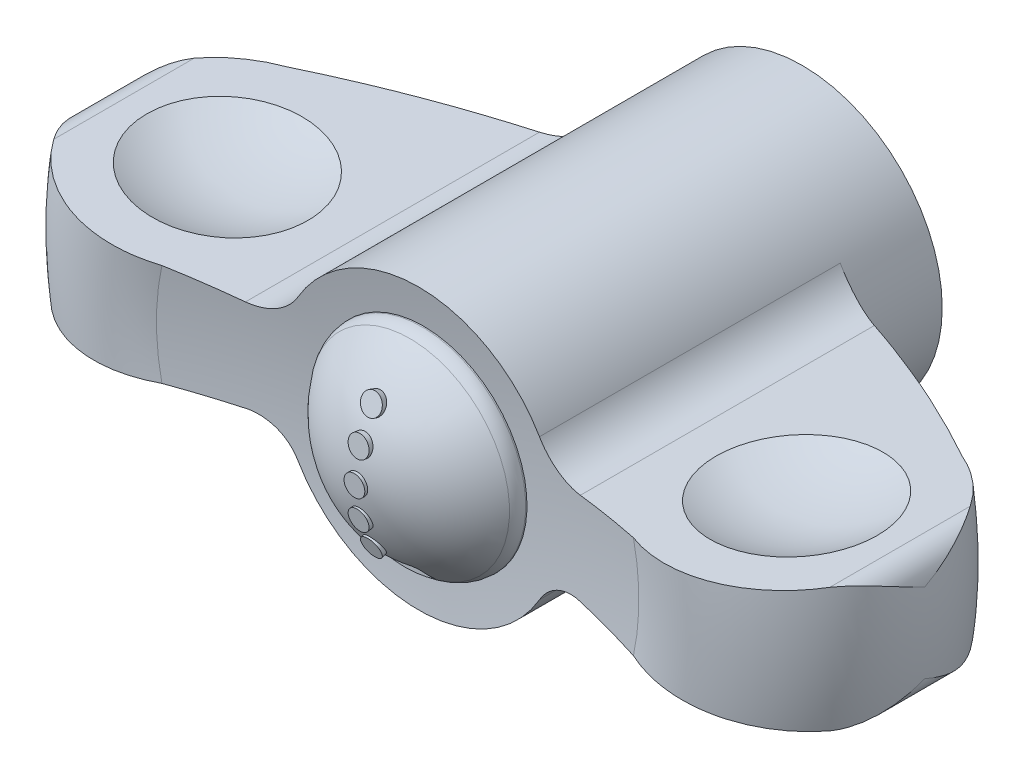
ISO-10303-21;
HEADER;
FILE_DESCRIPTION(('STEP AP214'),'2;1');
FILE_NAME('part.step','',(''),(''),'','','');
FILE_SCHEMA(('AUTOMOTIVE_DESIGN { 1 0 10303 214 1 1 1 1 }'));
ENDSEC;
DATA;
#1=APPLICATION_CONTEXT('core data for automotive mechanical design processes');
#2=APPLICATION_PROTOCOL_DEFINITION('international standard','automotive_design',2000,#1);
#3=PRODUCT_CONTEXT('',#1,'mechanical');
#4=PRODUCT('Part','Part','',(#3));
#5=PRODUCT_RELATED_PRODUCT_CATEGORY('part','',(#4));
#6=PRODUCT_DEFINITION_FORMATION('','',#4);
#7=PRODUCT_DEFINITION_CONTEXT('part definition',#1,'design');
#8=PRODUCT_DEFINITION('design','',#6,#7);
#9=PRODUCT_DEFINITION_SHAPE('','',#8);
#10=(LENGTH_UNIT() NAMED_UNIT(*) SI_UNIT(.MILLI.,.METRE.));
#11=(NAMED_UNIT(*) PLANE_ANGLE_UNIT() SI_UNIT($,.RADIAN.));
#12=(NAMED_UNIT(*) SI_UNIT($,.STERADIAN.) SOLID_ANGLE_UNIT());
#13=UNCERTAINTY_MEASURE_WITH_UNIT(LENGTH_MEASURE(1.E-05),#10,'distance_accuracy_value','');
#14=(GEOMETRIC_REPRESENTATION_CONTEXT(3) GLOBAL_UNCERTAINTY_ASSIGNED_CONTEXT((#13)) GLOBAL_UNIT_ASSIGNED_CONTEXT((#10,
#11,#12)) REPRESENTATION_CONTEXT('',''));
#15=CARTESIAN_POINT('',(0.,0.,0.));
#16=DIRECTION('',(0.,0.,1.));
#17=DIRECTION('',(1.,0.,0.));
#18=AXIS2_PLACEMENT_3D('',#15,#16,#17);
#19=CARTESIAN_POINT('',(0.,0.,18.));
#20=DIRECTION('',(0.,0.,1.));
#21=DIRECTION('',(0.,1.,0.));
#22=AXIS2_PLACEMENT_3D('',#19,#20,#21);
#23=CYLINDRICAL_SURFACE('',#22,5.);
#24=CARTESIAN_POINT('',(0.,0.,13.2));
#25=DIRECTION('',(0.,0.,1.));
#26=DIRECTION('',(0.,1.,0.));
#27=AXIS2_PLACEMENT_3D('',#24,#25,#26);
#28=CIRCLE('',#27,5.);
#29=CARTESIAN_POINT('',(0.,5.,13.2));
#30=VERTEX_POINT('',#29);
#31=EDGE_CURVE('E1204',#30,#30,#28,.T.);
#32=ORIENTED_EDGE('',*,*,#31,.F.);
#33=EDGE_LOOP('',(#32));
#34=FACE_BOUND('',#33,.T.);
#35=CARTESIAN_POINT('',(0.,0.,14.));
#36=DIRECTION('',(0.,0.,1.));
#37=DIRECTION('',(0.,1.,0.));
#38=AXIS2_PLACEMENT_3D('',#35,#36,#37);
#39=CIRCLE('',#38,5.);
#40=CARTESIAN_POINT('',(0.,5.,14.));
#41=VERTEX_POINT('',#40);
#42=EDGE_CURVE('E9',#41,#41,#39,.F.);
#43=ORIENTED_EDGE('',*,*,#42,.F.);
#44=EDGE_LOOP('',(#43));
#45=FACE_BOUND('',#44,.T.);
#46=ADVANCED_FACE('F14',(#34,#45),#23,.F.);
#47=CARTESIAN_POINT('',(0.,0.,55.6815128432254));
#48=DIRECTION('',(0.,0.,1.));
#49=DIRECTION('',(0.,1.,0.));
#50=AXIS2_PLACEMENT_3D('',#47,#48,#49);
#51=DEGENERATE_TOROIDAL_SURFACE('',#50,11.3881858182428,54.7720052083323,.F.);
#52=CARTESIAN_POINT('',(0.,0.,4.));
#53=DIRECTION('',(0.,0.,1.));
#54=DIRECTION('',(0.,1.,0.));
#55=AXIS2_PLACEMENT_3D('',#52,#53,#54);
#56=CIRCLE('',#55,6.75);
#57=CARTESIAN_POINT('',(5.8284721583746,-3.40461632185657,4.));
#58=VERTEX_POINT('',#57);
#59=CARTESIAN_POINT('',(5.82847209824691,3.40461642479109,4.));
#60=VERTEX_POINT('',#59);
#61=EDGE_CURVE('E507',#58,#60,#56,.T.);
#62=ORIENTED_EDGE('',*,*,#61,.T.);
#63=CARTESIAN_POINT('',(5.8283552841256,3.40481642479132,4.00000000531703));
#64=CARTESIAN_POINT('',(5.86016751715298,3.35032489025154,3.99999042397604));
#65=CARTESIAN_POINT('',(5.8941420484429,3.29710273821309,4.00117787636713));
#66=CARTESIAN_POINT('',(5.96610721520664,3.19357851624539,4.00589618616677));
#67=CARTESIAN_POINT('',(6.00409668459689,3.14327560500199,4.00942636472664));
#68=CARTESIAN_POINT('',(6.08365962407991,3.0461130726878,4.01876280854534));
#69=CARTESIAN_POINT('',(6.12521980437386,2.99924179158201,4.02456089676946));
#70=CARTESIAN_POINT('',(6.21168420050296,2.90905886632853,4.03833435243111));
#71=CARTESIAN_POINT('',(6.25658853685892,2.86574735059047,4.04630979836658));
#72=CARTESIAN_POINT('',(6.39572240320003,2.7416234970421,4.07331947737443));
#73=CARTESIAN_POINT('',(6.49450423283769,2.66646224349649,4.09545290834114));
#74=CARTESIAN_POINT('',(6.70110436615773,2.53287297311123,4.14678976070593));
#75=CARTESIAN_POINT('',(6.80892945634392,2.47445767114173,4.1759985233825));
#76=CARTESIAN_POINT('',(7.0356342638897,2.37292590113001,4.24159895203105));
#77=CARTESIAN_POINT('',(7.1547920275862,2.33060088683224,4.27825129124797));
#78=CARTESIAN_POINT('',(7.39674587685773,2.26533647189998,4.35639988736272));
#79=CARTESIAN_POINT('',(7.51954158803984,2.24239508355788,4.39789564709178));
#80=CARTESIAN_POINT('',(7.7150978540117,2.221232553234,4.46655020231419));
#81=CARTESIAN_POINT('',(7.78764059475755,2.21672214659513,4.49257664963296));
#82=CARTESIAN_POINT('',(7.93230052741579,2.21426652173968,4.54553902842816));
#83=CARTESIAN_POINT('',(8.00441832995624,2.21630490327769,4.57247252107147));
#84=CARTESIAN_POINT('',(8.07617895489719,2.22156185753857,4.59978114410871));
#85=B_SPLINE_CURVE_WITH_KNOTS('',3,(#63,#64,#65,#66,#67,#68,#69,#70,#71,#72,#73,#74,#75,#76,#77,
#78,#79,#80,#81,#82,#83,#84),.UNSPECIFIED.,.F.,.F.,(4,2,2,2,2,2,2,2,2,2,4),(0.,
0.189223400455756,0.378391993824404,0.566884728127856,0.755384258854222,1.13176907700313,
1.50843892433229,1.90177824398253,2.29507722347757,2.52642578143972,2.75719542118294),.UNSPECIFIED.);
#86=CARTESIAN_POINT('',(8.07597895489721,2.22154721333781,4.59970502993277));
#87=VERTEX_POINT('',#86);
#88=EDGE_CURVE('E334',#60,#87,#85,.T.);
#89=ORIENTED_EDGE('',*,*,#88,.T.);
#90=CARTESIAN_POINT('',(16.2928604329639,2.82285039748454,8.56214085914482));
#91=CARTESIAN_POINT('',(15.6369909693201,2.77485452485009,8.17431361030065));
#92=CARTESIAN_POINT('',(14.9729918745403,2.72626373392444,7.80032225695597));
#93=CARTESIAN_POINT('',(13.6310611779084,2.62806258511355,7.08139968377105));
#94=CARTESIAN_POINT('',(12.9531567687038,2.57845421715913,6.73641743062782));
#95=CARTESIAN_POINT('',(11.5833597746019,2.47821384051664,6.07549394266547));
#96=CARTESIAN_POINT('',(10.8914668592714,2.4275818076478,5.75955339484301));
#97=CARTESIAN_POINT('',(9.84342332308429,2.35088702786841,5.30782495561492));
#98=CARTESIAN_POINT('',(9.4920449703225,2.32517351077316,5.16082017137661));
#99=CARTESIAN_POINT('',(8.78619975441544,2.27352046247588,4.87445661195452));
#100=CARTESIAN_POINT('',(8.43173286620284,2.24758092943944,4.73509789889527));
#101=CARTESIAN_POINT('',(8.0757789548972,2.22153257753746,4.59962891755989));
#102=B_SPLINE_CURVE_WITH_KNOTS('',3,(#90,#91,#92,#93,#94,#95,#96,#97,#98,#99,#100,#101),
.UNSPECIFIED.,.F.,.F.,(4,2,2,2,2,4),(0.,2.29020852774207,4.57629990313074,6.86244534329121,
8.00763897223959,9.15284190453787),.UNSPECIFIED.);
#103=CARTESIAN_POINT('',(16.2925222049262,2.82282564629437,8.56194085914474));
#104=VERTEX_POINT('',#103);
#105=EDGE_CURVE('E375',#104,#87,#102,.T.);
#106=ORIENTED_EDGE('',*,*,#105,.F.);
#107=CARTESIAN_POINT('',(0.,0.,8.56194085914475));
#108=DIRECTION('',(0.,0.,1.));
#109=DIRECTION('',(0.,1.,0.));
#110=AXIS2_PLACEMENT_3D('',#107,#108,#109);
#111=CIRCLE('',#110,16.5352539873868);
#112=CARTESIAN_POINT('',(16.2925222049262,-2.82282564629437,8.56194085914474));
#113=VERTEX_POINT('',#112);
#114=EDGE_CURVE('E497',#113,#104,#111,.T.);
#115=ORIENTED_EDGE('',*,*,#114,.F.);
#116=CARTESIAN_POINT('',(8.07577895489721,-2.22153257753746,4.59962891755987));
#117=CARTESIAN_POINT('',(8.43173286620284,-2.24758092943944,4.73509789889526));
#118=CARTESIAN_POINT('',(8.78619975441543,-2.27352046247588,4.87445661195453));
#119=CARTESIAN_POINT('',(9.4920449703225,-2.32517351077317,5.16082017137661));
#120=CARTESIAN_POINT('',(9.8434233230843,-2.35088702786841,5.30782495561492));
#121=CARTESIAN_POINT('',(10.8914668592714,-2.42758180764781,5.759553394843));
#122=CARTESIAN_POINT('',(11.5833597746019,-2.47821384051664,6.07549394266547));
#123=CARTESIAN_POINT('',(12.9531567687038,-2.57845421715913,6.73641743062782));
#124=CARTESIAN_POINT('',(13.6310611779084,-2.62806258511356,7.08139968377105));
#125=CARTESIAN_POINT('',(14.9729918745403,-2.72626373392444,7.80032225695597));
#126=CARTESIAN_POINT('',(15.6369909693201,-2.77485452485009,8.17431361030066));
#127=CARTESIAN_POINT('',(16.2928604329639,-2.82285039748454,8.56214085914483));
#128=B_SPLINE_CURVE_WITH_KNOTS('',3,(#116,#117,#118,#119,#120,#121,#122,#123,#124,#125,#126,
#127),.UNSPECIFIED.,.F.,.F.,(4,2,2,2,2,4),(0.,1.14520293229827,2.29039656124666,
4.57654200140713,6.86263337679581,9.15284190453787),.UNSPECIFIED.);
#129=CARTESIAN_POINT('',(8.07597895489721,-2.22154721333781,4.59970502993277));
#130=VERTEX_POINT('',#129);
#131=EDGE_CURVE('E367',#130,#113,#128,.T.);
#132=ORIENTED_EDGE('',*,*,#131,.F.);
#133=CARTESIAN_POINT('',(8.07617895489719,-2.22156185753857,4.59978114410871));
#134=CARTESIAN_POINT('',(8.00820318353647,-2.21658490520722,4.57391281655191));
#135=CARTESIAN_POINT('',(7.93991745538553,-2.21449185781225,4.54838499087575));
#136=CARTESIAN_POINT('',(7.80308197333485,-2.2161597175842,4.49818139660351));
#137=CARTESIAN_POINT('',(7.73453214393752,-2.21992244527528,4.47350589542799));
#138=CARTESIAN_POINT('',(7.52878084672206,-2.24015544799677,4.40093139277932));
#139=CARTESIAN_POINT('',(7.39178248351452,-2.26559345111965,4.35460075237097));
#140=CARTESIAN_POINT('',(7.12223376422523,-2.34062850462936,4.26796081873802));
#141=CARTESIAN_POINT('',(6.9896936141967,-2.39027742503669,4.22766469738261));
#142=CARTESIAN_POINT('',(6.73374400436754,-2.51322806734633,4.15525410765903));
#143=CARTESIAN_POINT('',(6.61032466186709,-2.58650371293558,4.12313068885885));
#144=CARTESIAN_POINT('',(6.3846565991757,-2.74984766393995,4.07082787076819));
#145=CARTESIAN_POINT('',(6.28155362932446,-2.83851687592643,4.05000842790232));
#146=CARTESIAN_POINT('',(6.13888607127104,-2.98412440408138,4.02653638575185));
#147=CARTESIAN_POINT('',(6.0933452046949,-3.03473616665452,4.02000637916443));
#148=CARTESIAN_POINT('',(6.00661955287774,-3.13980301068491,4.00962956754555));
#149=CARTESIAN_POINT('',(5.96543178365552,-3.19425541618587,4.00578091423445));
#150=CARTESIAN_POINT('',(5.90926811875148,-3.2754958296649,4.00220636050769));
#151=CARTESIAN_POINT('',(5.89238549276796,-3.30094226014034,4.00137748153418));
#152=CARTESIAN_POINT('',(5.85962148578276,-3.35243262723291,4.00027401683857));
#153=CARTESIAN_POINT('',(5.84373871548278,-3.37847566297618,3.9999986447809));
#154=CARTESIAN_POINT('',(5.82835534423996,-3.40481632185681,4.00000000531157));
#155=B_SPLINE_CURVE_WITH_KNOTS('',3,(#133,#134,#135,#136,#137,#138,#139,#140,#141,#142,#143,
#144,#145,#146,#147,#148,#149,#150,#151,#152,#153,#154),.UNSPECIFIED.,.F.,.F.,(4,2,2,2,2,2,2,2,
2,2,4),(0.,0.218585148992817,0.437238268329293,0.875514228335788,1.31473331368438,
1.75346929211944,2.16372109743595,2.36866916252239,2.57347581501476,2.66510020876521,
2.75659434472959),.UNSPECIFIED.);
#156=EDGE_CURVE('E356',#130,#58,#155,.T.);
#157=ORIENTED_EDGE('',*,*,#156,.T.);
#158=EDGE_LOOP('',(#62,#89,#106,#115,#132,#157));
#159=FACE_BOUND('',#158,.T.);
#160=ADVANCED_FACE('F351',(#159),#51,.F.);
#161=CARTESIAN_POINT('',(0.,0.,13.9999999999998));
#162=DIRECTION('',(0.,0.,1.));
#163=DIRECTION('',(0.,1.,0.));
#164=AXIS2_PLACEMENT_3D('',#161,#162,#163);
#165=TOROIDAL_SURFACE('',#164,13.9999999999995,6.);
#166=CARTESIAN_POINT('',(-8.07577895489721,-2.22153257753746,16.0899671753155));
#167=CARTESIAN_POINT('',(-8.13571126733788,-2.22591836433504,16.2486548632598));
#168=CARTESIAN_POINT('',(-8.20244736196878,-2.23080204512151,16.4047481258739));
#169=CARTESIAN_POINT('',(-8.34889557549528,-2.24151897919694,16.7106643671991));
#170=CARTESIAN_POINT('',(-8.42860584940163,-2.24735209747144,16.8604882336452));
#171=CARTESIAN_POINT('',(-8.60028731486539,-2.2599155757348,17.1526581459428));
#172=CARTESIAN_POINT('',(-8.69224398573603,-2.26664487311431,17.2950127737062));
#173=CARTESIAN_POINT('',(-8.8877757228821,-2.28095369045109,17.5714613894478));
#174=CARTESIAN_POINT('',(-8.99135096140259,-2.2885332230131,17.7055552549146));
#175=CARTESIAN_POINT('',(-9.20932263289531,-2.30448417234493,17.9645438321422));
#176=CARTESIAN_POINT('',(-9.32371706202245,-2.31285544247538,18.0894402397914));
#177=CARTESIAN_POINT('',(-9.56255081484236,-2.33033305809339,18.3292625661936));
#178=CARTESIAN_POINT('',(-9.68699382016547,-2.33943967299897,18.4441847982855));
#179=CARTESIAN_POINT('',(-9.94495008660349,-2.35831665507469,18.6631925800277));
#180=CARTESIAN_POINT('',(-10.0784600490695,-2.368086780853,18.7672820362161));
#181=CARTESIAN_POINT('',(-10.3537001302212,-2.38822857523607,18.9640051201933));
#182=CARTESIAN_POINT('',(-10.4954332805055,-2.3986004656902,19.0566344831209));
#183=CARTESIAN_POINT('',(-10.787542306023,-2.41997671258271,19.2306296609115));
#184=CARTESIAN_POINT('',(-10.9379904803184,-2.4309863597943,19.3118734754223));
#185=CARTESIAN_POINT('',(-11.2452115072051,-2.4534684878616,19.4614446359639));
#186=CARTESIAN_POINT('',(-11.4019866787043,-2.4649411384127,19.5297671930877));
#187=CARTESIAN_POINT('',(-11.7206660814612,-2.48826177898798,19.6529586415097));
#188=CARTESIAN_POINT('',(-11.8825690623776,-2.50010967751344,19.7078307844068));
#189=CARTESIAN_POINT('',(-12.2104566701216,-2.52410416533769,19.8037627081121));
#190=CARTESIAN_POINT('',(-12.3764426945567,-2.53625085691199,19.8448176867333));
#191=CARTESIAN_POINT('',(-12.7117974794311,-2.56079178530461,19.9128910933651));
#192=CARTESIAN_POINT('',(-12.8811752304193,-2.57318668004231,19.9398650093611));
#193=CARTESIAN_POINT('',(-13.2215978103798,-2.59809846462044,19.9793695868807));
#194=CARTESIAN_POINT('',(-13.3926426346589,-2.61061535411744,19.9919002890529));
#195=CARTESIAN_POINT('',(-13.7351946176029,-2.63568296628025,20.0024088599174));
#196=CARTESIAN_POINT('',(-13.9067018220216,-2.64823369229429,20.0003852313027));
#197=CARTESIAN_POINT('',(-14.2488681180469,-2.6732730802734,19.9817773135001));
#198=CARTESIAN_POINT('',(-14.4195274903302,-2.68576176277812,19.9651982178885));
#199=CARTESIAN_POINT('',(-14.7582027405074,-2.71054567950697,19.917671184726));
#200=CARTESIAN_POINT('',(-14.9262260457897,-2.72284145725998,19.8867764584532));
#201=CARTESIAN_POINT('',(-15.2589992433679,-2.7471934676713,19.8108504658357));
#202=CARTESIAN_POINT('',(-15.4237503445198,-2.75924978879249,19.7658245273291));
#203=CARTESIAN_POINT('',(-15.7489475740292,-2.78304739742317,19.6619051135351));
#204=CARTESIAN_POINT('',(-15.9093911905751,-2.79478850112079,19.6030037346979));
#205=CARTESIAN_POINT('',(-16.2246513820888,-2.81785892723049,19.47177706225));
#206=CARTESIAN_POINT('',(-16.3794700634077,-2.82918840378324,19.3994568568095));
#207=CARTESIAN_POINT('',(-16.6816346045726,-2.85130050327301,19.2422894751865));
#208=CARTESIAN_POINT('',(-16.8290148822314,-2.86208564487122,19.1575088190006));
#209=CARTESIAN_POINT('',(-17.1160328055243,-2.88308932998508,18.9757734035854));
#210=CARTESIAN_POINT('',(-17.2556733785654,-2.89330808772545,18.8788232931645));
#211=CARTESIAN_POINT('',(-17.5261558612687,-2.91310172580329,18.6734849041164));
#212=CARTESIAN_POINT('',(-17.6570043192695,-2.92267708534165,18.5651052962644));
#213=CARTESIAN_POINT('',(-17.9090214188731,-2.94111944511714,18.3376563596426));
#214=CARTESIAN_POINT('',(-18.0301938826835,-2.94998672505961,18.21859129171));
#215=CARTESIAN_POINT('',(-18.2495547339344,-2.96603933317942,17.9839289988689));
#216=CARTESIAN_POINT('',(-18.3488135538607,-2.97330299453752,17.8693353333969));
#217=CARTESIAN_POINT('',(-18.538224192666,-2.98716387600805,17.6331560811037));
#218=CARTESIAN_POINT('',(-18.6283920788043,-2.99376227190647,17.5115834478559));
#219=CARTESIAN_POINT('',(-18.7138313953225,-3.00001463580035,17.3867458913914));
#220=B_SPLINE_CURVE_WITH_KNOTS('',3,(#166,#167,#168,#169,#170,#171,#172,#173,#174,#175,#176,
#177,#178,#179,#180,#181,#182,#183,#184,#185,#186,#187,#188,#189,#190,#191,#192,#193,#194,#195,
#196,#197,#198,#199,#200,#201,#202,#203,#204,#205,#206,#207,#208,#209,#210,#211,#212,#213,#214,
#215,#216,#217,#218,#219),.UNSPECIFIED.,.F.,.F.,(4,2,2,2,2,2,2,2,2,2,2,2,2,2,2,2,2,2,2,2,2,2,2,
2,2,2,4),(0.,0.508884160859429,1.01769601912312,1.52590985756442,2.03413123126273,
2.54225865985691,3.05057310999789,3.55870361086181,4.06702264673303,4.58042882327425,
5.09402490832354,5.60749671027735,6.12114678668,6.63641089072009,7.15167354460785,
7.66698920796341,8.18212107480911,8.6953533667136,9.20839238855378,9.72172435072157,
10.2348620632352,10.7453537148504,11.2556509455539,11.7655637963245,12.275274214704,
12.73018139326,13.1842699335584),.UNSPECIFIED.);
#221=CARTESIAN_POINT('',(-11.3708969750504,-2.46266602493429,19.5140273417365));
#222=VERTEX_POINT('',#221);
#223=CARTESIAN_POINT('',(-18.7136313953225,-3.,17.3870380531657));
#224=VERTEX_POINT('',#223);
#225=EDGE_CURVE('E489',#222,#224,#220,.T.);
#226=ORIENTED_EDGE('',*,*,#225,.F.);
#227=CARTESIAN_POINT('',(0.,0.,19.5140273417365));
#228=DIRECTION('',(0.,0.,1.));
#229=DIRECTION('',(0.,1.,0.));
#230=AXIS2_PLACEMENT_3D('',#227,#228,#229);
#231=CIRCLE('',#230,11.6345185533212);
#232=CARTESIAN_POINT('',(-11.3708969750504,2.46266602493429,19.5140273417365));
#233=VERTEX_POINT('',#232);
#234=EDGE_CURVE('E496',#233,#222,#231,.T.);
#235=ORIENTED_EDGE('',*,*,#234,.F.);
#236=CARTESIAN_POINT('',(-18.7138313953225,3.00001463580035,17.3867458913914));
#237=CARTESIAN_POINT('',(-18.6183948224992,2.99303068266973,17.5262020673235));
#238=CARTESIAN_POINT('',(-18.5170456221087,2.98561404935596,17.6615847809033));
#239=CARTESIAN_POINT('',(-18.3033246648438,2.96997416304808,17.9232863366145));
#240=CARTESIAN_POINT('',(-18.1909536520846,2.96175096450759,18.0496057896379));
#241=CARTESIAN_POINT('',(-17.9560842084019,2.94456345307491,18.2921739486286));
#242=CARTESIAN_POINT('',(-17.8335949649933,2.93559981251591,18.408431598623));
#243=CARTESIAN_POINT('',(-17.5792881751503,2.91698989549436,18.6301894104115));
#244=CARTESIAN_POINT('',(-17.4474706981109,2.90734362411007,18.7356896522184));
#245=CARTESIAN_POINT('',(-17.1754253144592,2.88743561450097,18.9352145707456));
#246=CARTESIAN_POINT('',(-17.0351958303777,2.87717376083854,19.0292370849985));
#247=CARTESIAN_POINT('',(-16.7472989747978,2.85610575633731,19.2051641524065));
#248=CARTESIAN_POINT('',(-16.5996288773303,2.8452994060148,19.2870642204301));
#249=CARTESIAN_POINT('',(-16.2980287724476,2.82322861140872,19.4381030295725));
#250=CARTESIAN_POINT('',(-16.1441019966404,2.81196440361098,19.5072482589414));
#251=CARTESIAN_POINT('',(-15.8309527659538,2.78904845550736,19.6323826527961));
#252=CARTESIAN_POINT('',(-15.6717283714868,2.7773965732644,19.6883669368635));
#253=CARTESIAN_POINT('',(-15.3486891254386,2.75375688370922,19.7869170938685));
#254=CARTESIAN_POINT('',(-15.1848621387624,2.74176818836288,19.8294429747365));
#255=CARTESIAN_POINT('',(-14.8541688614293,2.71756838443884,19.9005851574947));
#256=CARTESIAN_POINT('',(-14.6873014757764,2.70535719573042,19.9291963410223));
#257=CARTESIAN_POINT('',(-14.3517968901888,2.68080530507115,19.9723018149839));
#258=CARTESIAN_POINT('',(-14.183160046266,2.6684646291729,19.9867988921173));
#259=CARTESIAN_POINT('',(-13.8452097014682,2.64373376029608,20.0016086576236));
#260=CARTESIAN_POINT('',(-13.6758959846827,2.63134355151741,20.0019163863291));
#261=CARTESIAN_POINT('',(-13.3368935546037,2.60653569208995,19.9883160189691));
#262=CARTESIAN_POINT('',(-13.1672079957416,2.5941182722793,19.9743288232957));
#263=CARTESIAN_POINT('',(-12.8296040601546,2.56941275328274,19.9321365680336));
#264=CARTESIAN_POINT('',(-12.6616856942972,2.55712465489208,19.9039314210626));
#265=CARTESIAN_POINT('',(-12.3287760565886,2.53276265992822,19.8335149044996));
#266=CARTESIAN_POINT('',(-12.1637851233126,2.5206887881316,19.791301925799));
#267=CARTESIAN_POINT('',(-11.8379611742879,2.49684531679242,19.6931974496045));
#268=CARTESIAN_POINT('',(-11.6771267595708,2.48507561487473,19.6373106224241));
#269=CARTESIAN_POINT('',(-11.3597548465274,2.46185065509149,19.5118849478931));
#270=CARTESIAN_POINT('',(-11.2032479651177,2.45039763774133,19.4422681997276));
#271=CARTESIAN_POINT('',(-10.8966815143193,2.42796341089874,19.2901159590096));
#272=CARTESIAN_POINT('',(-10.7466196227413,2.41698203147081,19.2075851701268));
#273=CARTESIAN_POINT('',(-10.4538518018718,2.39555757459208,19.0301080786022));
#274=CARTESIAN_POINT('',(-10.3111507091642,2.38511485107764,18.9351537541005));
#275=CARTESIAN_POINT('',(-10.0342820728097,2.36485388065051,18.7335700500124));
#276=CARTESIAN_POINT('',(-9.90011136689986,2.35503540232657,18.6269450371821));
#277=CARTESIAN_POINT('',(-9.64091208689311,2.33606745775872,18.4024655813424));
#278=CARTESIAN_POINT('',(-9.51590567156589,2.32691961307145,18.2845854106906));
#279=CARTESIAN_POINT('',(-9.27635191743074,2.30938930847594,18.0386715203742));
#280=CARTESIAN_POINT('',(-9.16180061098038,2.30100655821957,17.9106416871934));
#281=CARTESIAN_POINT('',(-8.94405979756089,2.28507250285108,17.6453914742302));
#282=CARTESIAN_POINT('',(-8.84086084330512,2.27752050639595,17.5081788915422));
#283=CARTESIAN_POINT('',(-8.64654911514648,2.263300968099,17.2254791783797));
#284=CARTESIAN_POINT('',(-8.55543144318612,2.25663306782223,17.0799954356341));
#285=CARTESIAN_POINT('',(-8.39408042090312,2.24482556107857,16.7960165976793));
#286=CARTESIAN_POINT('',(-8.32268295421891,2.23960076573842,16.6581850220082));
#287=CARTESIAN_POINT('',(-8.19090704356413,2.22995753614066,16.3776074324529));
#288=CARTESIAN_POINT('',(-8.13051034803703,2.22553776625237,16.2348700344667));
#289=CARTESIAN_POINT('',(-8.0757789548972,2.22153257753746,16.0899671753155));
#290=B_SPLINE_CURVE_WITH_KNOTS('',3,(#236,#237,#238,#239,#240,#241,#242,#243,#244,#245,#246,
#247,#248,#249,#250,#251,#252,#253,#254,#255,#256,#257,#258,#259,#260,#261,#262,#263,#264,#265,
#266,#267,#268,#269,#270,#271,#272,#273,#274,#275,#276,#277,#278,#279,#280,#281,#282,#283,#284,
#285,#286,#287,#288,#289),.UNSPECIFIED.,.F.,.F.,(4,2,2,2,2,2,2,2,2,2,2,2,2,2,2,2,2,2,2,2,2,2,2,
2,2,2,4),(0.,0.507232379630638,1.01443053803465,1.52117311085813,2.02791191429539,
2.53474604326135,3.04176722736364,3.54852977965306,4.05547995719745,4.56392270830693,
5.07255234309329,5.58108153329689,6.08978847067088,6.60132561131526,7.11286589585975,
7.62446496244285,8.13588953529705,8.65030393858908,9.16453141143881,9.67909257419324,
10.1934618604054,10.7090364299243,11.2244145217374,11.7393604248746,12.2540969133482,
12.7195750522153,13.1842737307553),.UNSPECIFIED.);
#291=CARTESIAN_POINT('',(-18.7136313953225,3.,17.3870380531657));
#292=VERTEX_POINT('',#291);
#293=EDGE_CURVE('E333',#292,#233,#290,.T.);
#294=ORIENTED_EDGE('',*,*,#293,.F.);
#295=CARTESIAN_POINT('',(-19.9081185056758,1.91489361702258,13.9999999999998));
#296=CARTESIAN_POINT('',(-19.9079114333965,1.91704653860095,14.0046889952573));
#297=CARTESIAN_POINT('',(-19.9076985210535,1.91919899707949,14.0093781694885));
#298=CARTESIAN_POINT('',(-19.8915053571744,2.07850005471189,14.3565101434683));
#299=CARTESIAN_POINT('',(-19.8443969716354,2.2330438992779,14.6998619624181));
#300=CARTESIAN_POINT('',(-19.7280454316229,2.44617268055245,15.2114895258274));
#301=CARTESIAN_POINT('',(-19.6816080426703,2.51413383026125,15.3815593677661));
#302=CARTESIAN_POINT('',(-19.5735019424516,2.6411714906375,15.7202673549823));
#303=CARTESIAN_POINT('',(-19.5118395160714,2.70025165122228,15.8889060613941));
#304=CARTESIAN_POINT('',(-19.3955603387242,2.78918463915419,16.1703169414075));
#305=CARTESIAN_POINT('',(-19.3449829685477,2.82234574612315,16.2837302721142));
#306=CARTESIAN_POINT('',(-19.2369910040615,2.88161292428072,16.5090460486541));
#307=CARTESIAN_POINT('',(-19.1795822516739,2.90772496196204,16.6209496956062));
#308=CARTESIAN_POINT('',(-19.057774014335,2.95142281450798,16.8434399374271));
#309=CARTESIAN_POINT('',(-18.9933401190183,2.9689641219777,16.9540168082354));
#310=CARTESIAN_POINT('',(-18.8919085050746,2.98718166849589,17.1179953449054));
#311=CARTESIAN_POINT('',(-18.8572512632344,2.99190599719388,17.1724124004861));
#312=CARTESIAN_POINT('',(-18.7864388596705,2.99831558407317,17.2804796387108));
#313=CARTESIAN_POINT('',(-18.7502829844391,2.9999993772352,17.3341294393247));
#314=CARTESIAN_POINT('',(-18.7134313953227,2.99999998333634,17.3873267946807));
#315=B_SPLINE_CURVE_WITH_KNOTS('',3,(#295,#296,#297,#298,#299,#300,#301,#302,#303,#304,#305,
#306,#307,#308,#309,#310,#311,#312,#313,#314),.UNSPECIFIED.,.F.,.F.,(4,2,2,2,2,2,2,2,2,4),(0.,
0.0154919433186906,1.14680177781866,1.71308947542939,2.2791437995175,2.6644144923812,
3.04935805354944,3.43627990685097,3.63026401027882,3.82434155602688),.UNSPECIFIED.);
#316=CARTESIAN_POINT('',(-19.9081184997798,1.91489367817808,13.9999999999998));
#317=VERTEX_POINT('',#316);
#318=EDGE_CURVE('E192',#317,#292,#315,.T.);
#319=ORIENTED_EDGE('',*,*,#318,.F.);
#320=CARTESIAN_POINT('',(-18.7134313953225,2.99999998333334,10.6126732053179));
#321=CARTESIAN_POINT('',(-18.7715181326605,2.99996757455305,10.6965080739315));
#322=CARTESIAN_POINT('',(-18.8278479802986,2.99580634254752,10.7814514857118));
#323=CARTESIAN_POINT('',(-18.9366068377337,2.98038840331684,10.9529949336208));
#324=CARTESIAN_POINT('',(-18.9890419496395,2.96914306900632,11.0395920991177));
#325=CARTESIAN_POINT('',(-19.089587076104,2.94077514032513,11.2137637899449));
#326=CARTESIAN_POINT('',(-19.1377153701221,2.92367903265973,11.3013322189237));
#327=CARTESIAN_POINT('',(-19.2297916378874,2.88447422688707,11.4775843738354));
#328=CARTESIAN_POINT('',(-19.2737371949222,2.86236265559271,11.5662687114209));
#329=CARTESIAN_POINT('',(-19.3825891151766,2.79925245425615,11.7983475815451));
#330=CARTESIAN_POINT('',(-19.4441235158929,2.75491275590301,11.9424332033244));
#331=CARTESIAN_POINT('',(-19.5559564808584,2.65788785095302,12.2320980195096));
#332=CARTESIAN_POINT('',(-19.6062502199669,2.60519907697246,12.3776778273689));
#333=CARTESIAN_POINT('',(-19.7403065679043,2.43752228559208,12.8164900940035));
#334=CARTESIAN_POINT('',(-19.8071211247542,2.31300292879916,13.1115318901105));
#335=CARTESIAN_POINT('',(-19.8652951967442,2.14013350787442,13.5033189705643));
#336=CARTESIAN_POINT('',(-19.8771709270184,2.09693746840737,13.5998466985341));
#337=CARTESIAN_POINT('',(-19.8960094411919,2.00968934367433,13.7929000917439));
#338=CARTESIAN_POINT('',(-19.9029780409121,1.96563833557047,13.8894256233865));
#339=CARTESIAN_POINT('',(-19.9076985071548,1.91919906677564,13.9906217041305));
#340=CARTESIAN_POINT('',(-19.9079114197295,1.91704660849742,13.9953108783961));
#341=CARTESIAN_POINT('',(-19.9081185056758,1.91489361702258,13.9999999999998));
#342=B_SPLINE_CURVE_WITH_KNOTS('',3,(#320,#321,#322,#323,#324,#325,#326,#327,#328,#329,#330,
#331,#332,#333,#334,#335,#336,#337,#338,#339,#340,#341),.UNSPECIFIED.,.F.,.F.,(4,2,2,2,2,2,2,2,
2,2,4),(0.,0.305743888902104,0.610998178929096,0.91488845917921,1.21895326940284,
1.70667556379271,2.1946068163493,3.17136359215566,3.49057583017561,3.8094091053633,
3.82490104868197),.UNSPECIFIED.);
#343=CARTESIAN_POINT('',(-18.7136313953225,3.,10.6129619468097));
#344=VERTEX_POINT('',#343);
#345=EDGE_CURVE('E236',#344,#317,#342,.T.);
#346=ORIENTED_EDGE('',*,*,#345,.F.);
#347=CARTESIAN_POINT('',(-16.2920922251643,2.82279418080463,8.561740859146));
#348=CARTESIAN_POINT('',(-16.4467421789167,2.83411131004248,8.63364606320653));
#349=CARTESIAN_POINT('',(-16.5983293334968,2.84520430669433,8.7121719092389));
#350=CARTESIAN_POINT('',(-16.8943515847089,2.86686691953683,8.88186310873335));
#351=CARTESIAN_POINT('',(-17.0387846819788,2.87743638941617,8.97303196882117));
#352=CARTESIAN_POINT('',(-17.3162983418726,2.89774456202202,9.16522889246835));
#353=CARTESIAN_POINT('',(-17.4495587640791,2.90749642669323,9.26599590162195));
#354=CARTESIAN_POINT('',(-17.7071918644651,2.92634975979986,9.47826493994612));
#355=CARTESIAN_POINT('',(-17.8315679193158,2.93545147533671,9.58976285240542));
#356=CARTESIAN_POINT('',(-18.0917831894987,2.95449376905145,9.84341713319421));
#357=CARTESIAN_POINT('',(-18.2257549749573,2.96429769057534,9.98750697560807));
#358=CARTESIAN_POINT('',(-18.4806397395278,2.98294990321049,10.2901511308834));
#359=CARTESIAN_POINT('',(-18.6013565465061,2.99178383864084,10.4488715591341));
#360=CARTESIAN_POINT('',(-18.7138313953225,3.00001463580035,10.6132541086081));
#361=B_SPLINE_CURVE_WITH_KNOTS('',3,(#347,#348,#349,#350,#351,#352,#353,#354,#355,#356,#357,
#358,#359,#360),.UNSPECIFIED.,.F.,.F.,(4,2,2,2,2,2,4),(0.,0.512618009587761,1.02537848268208,
1.5268572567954,2.02814440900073,2.61815679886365,3.21597344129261),.UNSPECIFIED.);
#362=CARTESIAN_POINT('',(-16.2925222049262,2.82282564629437,8.56194085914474));
#363=VERTEX_POINT('',#362);
#364=EDGE_CURVE('E490',#363,#344,#361,.T.);
#365=ORIENTED_EDGE('',*,*,#364,.F.);
#366=CARTESIAN_POINT('',(-16.2925222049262,-2.82282564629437,8.56194085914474));
#367=VERTEX_POINT('',#366);
#368=EDGE_CURVE('E488',#363,#367,#111,.T.);
#369=ORIENTED_EDGE('',*,*,#368,.T.);
#370=CARTESIAN_POINT('',(-19.4524589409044,-3.05406666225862,12.0985771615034));
#371=CARTESIAN_POINT('',(-19.4084868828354,-3.05084883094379,11.9670841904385));
#372=CARTESIAN_POINT('',(-19.3599787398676,-3.04729905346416,11.8371780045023));
#373=CARTESIAN_POINT('',(-19.2540981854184,-3.03955082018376,11.5810708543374));
#374=CARTESIAN_POINT('',(-19.1967270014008,-3.03535245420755,11.4548693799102));
#375=CARTESIAN_POINT('',(-19.0114676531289,-3.02179536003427,11.0822780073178));
#376=CARTESIAN_POINT('',(-18.8705363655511,-3.01148214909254,10.8422078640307));
#377=CARTESIAN_POINT('',(-18.6183201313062,-2.99302521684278,10.4737074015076));
#378=CARTESIAN_POINT('',(-18.5169491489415,-2.98560698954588,10.3382902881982));
#379=CARTESIAN_POINT('',(-18.3031692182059,-2.96996278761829,10.0765301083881));
#380=CARTESIAN_POINT('',(-18.1907635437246,-2.96173705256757,9.95018436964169));
#381=CARTESIAN_POINT('',(-17.9558508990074,-2.94454637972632,9.70759861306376));
#382=CARTESIAN_POINT('',(-17.8333551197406,-2.93558226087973,9.5913476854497));
#383=CARTESIAN_POINT('',(-17.5790797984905,-2.9169746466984,9.36964046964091));
#384=CARTESIAN_POINT('',(-17.4473032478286,-2.90733137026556,9.26418072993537));
#385=CARTESIAN_POINT('',(-17.1519065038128,-2.88571453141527,9.04754412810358));
#386=CARTESIAN_POINT('',(-16.9867129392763,-2.87362583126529,8.93851572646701));
#387=CARTESIAN_POINT('',(-16.6464037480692,-2.84872234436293,8.7372844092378));
#388=CARTESIAN_POINT('',(-16.4712869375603,-2.83590747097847,8.64508350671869));
#389=CARTESIAN_POINT('',(-16.1379405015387,-2.81151351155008,8.49004559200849));
#390=CARTESIAN_POINT('',(-15.9807710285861,-2.80001200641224,8.42490565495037));
#391=CARTESIAN_POINT('',(-15.661442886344,-2.77664389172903,8.30814524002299));
#392=CARTESIAN_POINT('',(-15.4992824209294,-2.76477715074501,8.25652969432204));
#393=CARTESIAN_POINT('',(-15.1710899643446,-2.74076035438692,8.16717388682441));
#394=CARTESIAN_POINT('',(-15.0050555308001,-2.72861012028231,8.12944264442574));
#395=CARTESIAN_POINT('',(-14.6703977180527,-2.70412019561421,8.06814307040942));
#396=CARTESIAN_POINT('',(-14.5017740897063,-2.69178048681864,8.04457611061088));
#397=CARTESIAN_POINT('',(-14.1300060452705,-2.66457487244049,8.00855913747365));
#398=CARTESIAN_POINT('',(-13.9265588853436,-2.64968681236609,7.9991840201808));
#399=CARTESIAN_POINT('',(-13.5202907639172,-2.61995651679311,8.00092804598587));
#400=CARTESIAN_POINT('',(-13.3174695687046,-2.60511426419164,8.01199308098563));
#401=CARTESIAN_POINT('',(-13.1157362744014,-2.59035162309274,8.03326324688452));
#402=B_SPLINE_CURVE_WITH_KNOTS('',3,(#370,#371,#372,#373,#374,#375,#376,#377,#378,#379,#380,
#381,#382,#383,#384,#385,#386,#387,#388,#389,#390,#391,#392,#393,#394,#395,#396,#397,#398,#399,
#400,#401),.UNSPECIFIED.,.F.,.F.,(4,2,2,2,2,2,2,2,2,2,2,2,2,2,2,4),(0.,0.415862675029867,
0.83166780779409,1.66424050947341,2.17169136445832,2.67899211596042,3.18573760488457,
3.69232050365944,4.28623239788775,4.88021529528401,5.39118733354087,5.90234545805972,
6.41383505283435,6.92537417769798,7.53693927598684,8.14688779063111),.UNSPECIFIED.);
#403=CARTESIAN_POINT('',(-18.7136313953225,-3.,10.6129619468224));
#404=VERTEX_POINT('',#403);
#405=EDGE_CURVE('E197',#404,#367,#402,.T.);
#406=ORIENTED_EDGE('',*,*,#405,.F.);
#407=CARTESIAN_POINT('',(-19.9081185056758,-1.91489361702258,13.9999999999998));
#408=CARTESIAN_POINT('',(-19.9079114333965,-1.91704653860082,13.9953110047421));
#409=CARTESIAN_POINT('',(-19.9076985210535,-1.91919899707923,13.9906218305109));
#410=CARTESIAN_POINT('',(-19.8915053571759,-2.0785000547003,13.6434898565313));
#411=CARTESIAN_POINT('',(-19.8443969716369,-2.23304389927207,13.3001380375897));
#412=CARTESIAN_POINT('',(-19.7280454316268,-2.44617268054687,12.7885104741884));
#413=CARTESIAN_POINT('',(-19.6816080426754,-2.51413383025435,12.6184406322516));
#414=CARTESIAN_POINT('',(-19.5735019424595,-2.64117149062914,12.2797326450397));
#415=CARTESIAN_POINT('',(-19.5118395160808,-2.7002516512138,12.1110939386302));
#416=CARTESIAN_POINT('',(-19.395560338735,-2.78918463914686,11.8296830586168));
#417=CARTESIAN_POINT('',(-19.344982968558,-2.82234574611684,11.7162697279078));
#418=CARTESIAN_POINT('',(-19.2369910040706,-2.88161292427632,11.4909539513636));
#419=CARTESIAN_POINT('',(-19.1795822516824,-2.90772496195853,11.3790503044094));
#420=CARTESIAN_POINT('',(-19.0577740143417,-2.95142281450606,11.156560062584));
#421=CARTESIAN_POINT('',(-18.9933401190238,-2.96896412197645,11.0459831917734));
#422=CARTESIAN_POINT('',(-18.8919085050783,-2.98718166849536,10.8820046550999));
#423=CARTESIAN_POINT('',(-18.8572512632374,-2.99190599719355,10.827587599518));
#424=CARTESIAN_POINT('',(-18.786438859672,-2.9983155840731,10.719520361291));
#425=CARTESIAN_POINT('',(-18.7502829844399,-2.9999993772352,10.665870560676));
#426=CARTESIAN_POINT('',(-18.7134313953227,-2.99999998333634,10.6126732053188));
#427=B_SPLINE_CURVE_WITH_KNOTS('',3,(#407,#408,#409,#410,#411,#412,#413,#414,#415,#416,#417,
#418,#419,#420,#421,#422,#423,#424,#425,#426),.UNSPECIFIED.,.F.,.F.,(4,2,2,2,2,2,2,2,2,4),(0.,
0.0154919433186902,1.14680177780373,1.71308947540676,2.27914379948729,2.66441449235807,
3.04935805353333,3.43627990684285,3.63026401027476,3.8243415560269),.UNSPECIFIED.);
#428=CARTESIAN_POINT('',(-19.9081185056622,-1.91489361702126,13.9999999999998));
#429=VERTEX_POINT('',#428);
#430=EDGE_CURVE('E29',#429,#404,#427,.T.);
#431=ORIENTED_EDGE('',*,*,#430,.F.);
#432=CARTESIAN_POINT('',(-18.7134313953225,-2.99999998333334,17.3873267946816));
#433=CARTESIAN_POINT('',(-18.7715181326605,-2.99996757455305,17.3034919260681));
#434=CARTESIAN_POINT('',(-18.8278479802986,-2.99580634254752,17.2185485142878));
#435=CARTESIAN_POINT('',(-18.9366068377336,-2.98038840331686,17.0470050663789));
#436=CARTESIAN_POINT('',(-18.9890419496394,-2.96914306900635,16.960407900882));
#437=CARTESIAN_POINT('',(-19.0895870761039,-2.94077514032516,16.7862362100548));
#438=CARTESIAN_POINT('',(-19.137715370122,-2.92367903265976,16.698667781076));
#439=CARTESIAN_POINT('',(-19.2297916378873,-2.88447422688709,16.5224156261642));
#440=CARTESIAN_POINT('',(-19.2737371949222,-2.86236265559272,16.4337312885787));
#441=CARTESIAN_POINT('',(-19.3825891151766,-2.79925245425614,16.2016524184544));
#442=CARTESIAN_POINT('',(-19.444123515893,-2.75491275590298,16.0575667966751));
#443=CARTESIAN_POINT('',(-19.5559564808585,-2.65788785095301,15.7679019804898));
#444=CARTESIAN_POINT('',(-19.6062502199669,-2.60519907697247,15.6223221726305));
#445=CARTESIAN_POINT('',(-19.7403065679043,-2.43752228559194,15.183509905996));
#446=CARTESIAN_POINT('',(-19.8071211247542,-2.31300292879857,14.8884681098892));
#447=CARTESIAN_POINT('',(-19.8652951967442,-2.14013350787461,14.4966810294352));
#448=CARTESIAN_POINT('',(-19.8771709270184,-2.09693746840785,14.4001533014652));
#449=CARTESIAN_POINT('',(-19.8960094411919,-2.00968934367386,14.2070999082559));
#450=CARTESIAN_POINT('',(-19.9029780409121,-1.96563833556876,14.1105743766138));
#451=CARTESIAN_POINT('',(-19.9076985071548,-1.91919906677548,14.0093782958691));
#452=CARTESIAN_POINT('',(-19.9079114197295,-1.91704660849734,14.0046891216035));
#453=CARTESIAN_POINT('',(-19.9081185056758,-1.91489361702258,13.9999999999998));
#454=B_SPLINE_CURVE_WITH_KNOTS('',3,(#432,#433,#434,#435,#436,#437,#438,#439,#440,#441,#442,
#443,#444,#445,#446,#447,#448,#449,#450,#451,#452,#453),.UNSPECIFIED.,.F.,.F.,(4,2,2,2,2,2,2,2,
2,2,4),(0.,0.305743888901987,0.610998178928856,0.914888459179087,1.21895326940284,
1.70667556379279,2.19460681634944,3.17136359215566,3.4905758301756,3.80940910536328,
3.82490104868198),.UNSPECIFIED.);
#455=EDGE_CURVE('E185',#224,#429,#454,.T.);
#456=ORIENTED_EDGE('',*,*,#455,.F.);
#457=EDGE_LOOP('',(#226,#235,#294,#319,#346,#365,#369,#406,#431,#456));
#458=FACE_BOUND('',#457,.T.);
#459=ADVANCED_FACE('F195',(#458),#165,.T.);
#460=CARTESIAN_POINT('',(0.,0.,0.));
#461=DIRECTION('',(0.,0.,1.));
#462=DIRECTION('',(0.,1.,0.));
#463=AXIS2_PLACEMENT_3D('',#460,#461,#462);
#464=PLANE('',#463);
#465=CARTESIAN_POINT('',(0.,0.,0.));
#466=DIRECTION('',(0.,0.,1.));
#467=DIRECTION('',(0.,1.,0.));
#468=AXIS2_PLACEMENT_3D('',#465,#466,#467);
#469=CIRCLE('',#468,6.75);
#470=CARTESIAN_POINT('',(0.,6.75,0.));
#471=VERTEX_POINT('',#470);
#472=EDGE_CURVE('E510',#471,#471,#469,.T.);
#473=ORIENTED_EDGE('',*,*,#472,.F.);
#474=EDGE_LOOP('',(#473));
#475=FACE_BOUND('',#474,.T.);
#476=CARTESIAN_POINT('',(0.,0.,0.));
#477=DIRECTION('',(0.,0.,1.));
#478=DIRECTION('',(0.,1.,0.));
#479=AXIS2_PLACEMENT_3D('',#476,#477,#478);
#480=CIRCLE('',#479,4.28571428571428);
#481=CARTESIAN_POINT('',(0.,4.28571428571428,0.));
#482=VERTEX_POINT('',#481);
#483=EDGE_CURVE('E1195',#482,#482,#480,.T.);
#484=ORIENTED_EDGE('',*,*,#483,.T.);
#485=EDGE_LOOP('',(#484));
#486=FACE_BOUND('',#485,.T.);
#487=ADVANCED_FACE('F1154',(#475,#486),#464,.F.);
#488=CARTESIAN_POINT('',(0.,0.,18.));
#489=DIRECTION('',(0.,0.,1.));
#490=DIRECTION('',(0.,1.,0.));
#491=AXIS2_PLACEMENT_3D('',#488,#489,#490);
#492=CYLINDRICAL_SURFACE('',#491,6.75);
#493=CARTESIAN_POINT('',(-5.82847209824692,3.40461642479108,4.));
#494=VERTEX_POINT('',#493);
#495=CARTESIAN_POINT('',(-5.82847209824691,-3.40461642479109,4.));
#496=VERTEX_POINT('',#495);
#497=EDGE_CURVE('E508',#494,#496,#56,.T.);
#498=ORIENTED_EDGE('',*,*,#497,.F.);
#499=DIRECTION('',(0.,0.,-1.));
#500=VECTOR('',#499,1.);
#501=CARTESIAN_POINT('',(-5.82847209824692,3.40461642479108,40.));
#502=LINE('',#501,#500);
#503=CARTESIAN_POINT('',(-5.82847209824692,3.40461642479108,18.5039242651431));
#504=VERTEX_POINT('',#503);
#505=EDGE_CURVE('E448',#504,#494,#502,.T.);
#506=ORIENTED_EDGE('',*,*,#505,.F.);
#507=CARTESIAN_POINT('',(0.,0.,18.5039242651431));
#508=DIRECTION('',(0.,0.,1.));
#509=DIRECTION('',(0.,1.,0.));
#510=AXIS2_PLACEMENT_3D('',#507,#508,#509);
#511=CIRCLE('',#510,6.75);
#512=CARTESIAN_POINT('',(5.82847209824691,3.40461642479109,18.503924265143));
#513=VERTEX_POINT('',#512);
#514=EDGE_CURVE('E308',#513,#504,#511,.T.);
#515=ORIENTED_EDGE('',*,*,#514,.F.);
#516=DIRECTION('',(0.,0.,-1.));
#517=VECTOR('',#516,1.);
#518=CARTESIAN_POINT('',(5.82847209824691,3.40461642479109,40.));
#519=LINE('',#518,#517);
#520=EDGE_CURVE('E445',#513,#60,#519,.T.);
#521=ORIENTED_EDGE('',*,*,#520,.T.);
#522=ORIENTED_EDGE('',*,*,#61,.F.);
#523=DIRECTION('',(0.,0.,-1.));
#524=VECTOR('',#523,1.);
#525=CARTESIAN_POINT('',(5.8284721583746,-3.40461632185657,40.));
#526=LINE('',#525,#524);
#527=CARTESIAN_POINT('',(5.8284721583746,-3.40461632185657,18.5039242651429));
#528=VERTEX_POINT('',#527);
#529=EDGE_CURVE('E463',#528,#58,#526,.T.);
#530=ORIENTED_EDGE('',*,*,#529,.F.);
#531=CARTESIAN_POINT('',(0.,0.,18.5039242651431));
#532=DIRECTION('',(0.,0.,1.));
#533=DIRECTION('',(0.,1.,0.));
#534=AXIS2_PLACEMENT_3D('',#531,#532,#533);
#535=CIRCLE('',#534,6.75);
#536=CARTESIAN_POINT('',(-5.82847209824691,-3.40461642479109,18.5039242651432));
#537=VERTEX_POINT('',#536);
#538=EDGE_CURVE('E425',#537,#528,#535,.T.);
#539=ORIENTED_EDGE('',*,*,#538,.F.);
#540=DIRECTION('',(0.,0.,-1.));
#541=VECTOR('',#540,1.);
#542=CARTESIAN_POINT('',(-5.82847209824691,-3.40461642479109,40.));
#543=LINE('',#542,#541);
#544=EDGE_CURVE('E465',#537,#496,#543,.T.);
#545=ORIENTED_EDGE('',*,*,#544,.T.);
#546=EDGE_LOOP('',(#498,#506,#515,#521,#522,#530,#539,#545));
#547=FACE_BOUND('',#546,.T.);
#548=ORIENTED_EDGE('',*,*,#472,.T.);
#549=EDGE_LOOP('',(#548));
#550=FACE_BOUND('',#549,.T.);
#551=ADVANCED_FACE('F349',(#547,#550),#492,.T.);
#552=CARTESIAN_POINT('',(-8.07577895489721,2.22153257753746,4.59962891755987));
#553=CARTESIAN_POINT('',(-8.43173286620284,2.24758092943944,4.73509789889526));
#554=CARTESIAN_POINT('',(-8.78619975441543,2.27352046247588,4.87445661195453));
#555=CARTESIAN_POINT('',(-9.4920449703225,2.32517351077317,5.16082017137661));
#556=CARTESIAN_POINT('',(-9.8434233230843,2.35088702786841,5.30782495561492));
#557=CARTESIAN_POINT('',(-10.8914668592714,2.42758180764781,5.759553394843));
#558=CARTESIAN_POINT('',(-11.5833597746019,2.47821384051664,6.07549394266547));
#559=CARTESIAN_POINT('',(-12.9531567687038,2.57845421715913,6.73641743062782));
#560=CARTESIAN_POINT('',(-13.6310611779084,2.62806258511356,7.08139968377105));
#561=CARTESIAN_POINT('',(-14.9729918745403,2.72626373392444,7.80032225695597));
#562=CARTESIAN_POINT('',(-15.6369909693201,2.77485452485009,8.17431361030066));
#563=CARTESIAN_POINT('',(-16.2928604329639,2.82285039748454,8.56214085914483));
#564=B_SPLINE_CURVE_WITH_KNOTS('',3,(#552,#553,#554,#555,#556,#557,#558,#559,#560,#561,#562,
#563),.UNSPECIFIED.,.F.,.F.,(4,2,2,2,2,4),(0.,1.14520293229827,2.29039656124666,
4.57654200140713,6.86263337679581,9.15284190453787),.UNSPECIFIED.);
#565=CARTESIAN_POINT('',(-8.07597895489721,2.22154721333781,4.59970502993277));
#566=VERTEX_POINT('',#565);
#567=EDGE_CURVE('E384',#566,#363,#564,.T.);
#568=ORIENTED_EDGE('',*,*,#567,.F.);
#569=CARTESIAN_POINT('',(-8.07617895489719,2.22156185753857,4.59978114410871));
#570=CARTESIAN_POINT('',(-8.00820318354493,2.21658490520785,4.57391281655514));
#571=CARTESIAN_POINT('',(-7.93991745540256,2.21449185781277,4.54838499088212));
#572=CARTESIAN_POINT('',(-7.80308197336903,2.21615971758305,4.49818139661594));
#573=CARTESIAN_POINT('',(-7.73453214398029,2.21992244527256,4.47350589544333));
#574=CARTESIAN_POINT('',(-7.52878084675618,2.24015544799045,4.40093139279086));
#575=CARTESIAN_POINT('',(-7.39178248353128,2.26559345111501,4.35460075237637));
#576=CARTESIAN_POINT('',(-7.12223376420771,2.34062850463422,4.26796081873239));
#577=CARTESIAN_POINT('',(-6.98969361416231,2.39027742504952,4.22766469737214));
#578=CARTESIAN_POINT('',(-6.73374400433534,2.5132280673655,4.15525410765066));
#579=CARTESIAN_POINT('',(-6.61032466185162,2.58650371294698,4.12313068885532));
#580=CARTESIAN_POINT('',(-6.38465659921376,2.74984766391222,4.07082787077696));
#581=CARTESIAN_POINT('',(-6.28155362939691,2.83851687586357,4.05000842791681));
#582=CARTESIAN_POINT('',(-6.13888607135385,2.98412440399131,4.02653638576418));
#583=CARTESIAN_POINT('',(-6.09334520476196,3.03473616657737,4.02000637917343));
#584=CARTESIAN_POINT('',(-6.00661955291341,3.13980301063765,4.00962956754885));
#585=CARTESIAN_POINT('',(-5.96543178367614,3.19425541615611,4.00578091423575));
#586=CARTESIAN_POINT('',(-5.90926810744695,3.27549584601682,4.00220635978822));
#587=CARTESIAN_POINT('',(-5.89238547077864,3.30094229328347,4.00137748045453));
#588=CARTESIAN_POINT('',(-5.85962144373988,3.35243269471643,4.0002740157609));
#589=CARTESIAN_POINT('',(-5.84373866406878,3.37847574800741,3.99999864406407));
#590=CARTESIAN_POINT('',(-5.82835528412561,3.40481642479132,4.00000000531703));
#591=B_SPLINE_CURVE_WITH_KNOTS('',3,(#569,#570,#571,#572,#573,#574,#575,#576,#577,#578,#579,
#580,#581,#582,#583,#584,#585,#586,#587,#588,#589,#590),.UNSPECIFIED.,.F.,.F.,(4,2,2,2,2,2,2,2,
2,2,4),(0.,0.218585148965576,0.437238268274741,0.875514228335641,1.31473331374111,
1.75346929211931,2.16372109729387,2.36866916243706,2.57347581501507,2.6651002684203,
2.75659446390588),.UNSPECIFIED.);
#592=EDGE_CURVE('E325',#566,#494,#591,.T.);
#593=ORIENTED_EDGE('',*,*,#592,.T.);
#594=ORIENTED_EDGE('',*,*,#497,.T.);
#595=CARTESIAN_POINT('',(-5.8283552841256,-3.40481642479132,4.00000000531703));
#596=CARTESIAN_POINT('',(-5.86016751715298,-3.35032489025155,3.99999042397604));
#597=CARTESIAN_POINT('',(-5.8941420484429,-3.2971027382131,4.00117787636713));
#598=CARTESIAN_POINT('',(-5.96610721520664,-3.19357851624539,4.00589618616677));
#599=CARTESIAN_POINT('',(-6.00409668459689,-3.143275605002,4.00942636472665));
#600=CARTESIAN_POINT('',(-6.08365962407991,-3.0461130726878,4.01876280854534));
#601=CARTESIAN_POINT('',(-6.12521980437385,-2.99924179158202,4.02456089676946));
#602=CARTESIAN_POINT('',(-6.21168420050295,-2.90905886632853,4.03833435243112));
#603=CARTESIAN_POINT('',(-6.25658853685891,-2.86574735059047,4.04630979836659));
#604=CARTESIAN_POINT('',(-6.39572240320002,-2.7416234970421,4.07331947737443));
#605=CARTESIAN_POINT('',(-6.49450423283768,-2.66646224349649,4.09545290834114));
#606=CARTESIAN_POINT('',(-6.70110436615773,-2.53287297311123,4.14678976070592));
#607=CARTESIAN_POINT('',(-6.80892945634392,-2.47445767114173,4.17599852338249));
#608=CARTESIAN_POINT('',(-7.0356342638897,-2.37292590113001,4.24159895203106));
#609=CARTESIAN_POINT('',(-7.1547920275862,-2.33060088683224,4.27825129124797));
#610=CARTESIAN_POINT('',(-7.39674587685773,-2.26533647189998,4.35639988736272));
#611=CARTESIAN_POINT('',(-7.51954158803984,-2.24239508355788,4.39789564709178));
#612=CARTESIAN_POINT('',(-7.7150978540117,-2.221232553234,4.46655020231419));
#613=CARTESIAN_POINT('',(-7.78764059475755,-2.21672214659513,4.49257664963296));
#614=CARTESIAN_POINT('',(-7.93230052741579,-2.21426652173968,4.54553902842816));
#615=CARTESIAN_POINT('',(-8.00441832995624,-2.21630490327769,4.57247252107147));
#616=CARTESIAN_POINT('',(-8.07617895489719,-2.22156185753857,4.59978114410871));
#617=B_SPLINE_CURVE_WITH_KNOTS('',3,(#595,#596,#597,#598,#599,#600,#601,#602,#603,#604,#605,
#606,#607,#608,#609,#610,#611,#612,#613,#614,#615,#616),.UNSPECIFIED.,.F.,.F.,(4,2,2,2,2,2,2,2,
2,2,4),(0.,0.189223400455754,0.378391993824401,0.566884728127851,0.755384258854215,
1.13176907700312,1.50843892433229,1.90177824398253,2.29507722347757,2.52642578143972,
2.75719542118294),.UNSPECIFIED.);
#618=CARTESIAN_POINT('',(-8.07597895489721,-2.22154721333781,4.59970502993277));
#619=VERTEX_POINT('',#618);
#620=EDGE_CURVE('E397',#496,#619,#617,.T.);
#621=ORIENTED_EDGE('',*,*,#620,.T.);
#622=CARTESIAN_POINT('',(-16.2928604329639,-2.82285039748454,8.56214085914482));
#623=CARTESIAN_POINT('',(-15.6369909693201,-2.77485452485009,8.17431361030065));
#624=CARTESIAN_POINT('',(-14.9729918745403,-2.72626373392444,7.80032225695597));
#625=CARTESIAN_POINT('',(-13.6310611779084,-2.62806258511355,7.08139968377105));
#626=CARTESIAN_POINT('',(-12.9531567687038,-2.57845421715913,6.73641743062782));
#627=CARTESIAN_POINT('',(-11.5833597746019,-2.47821384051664,6.07549394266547));
#628=CARTESIAN_POINT('',(-10.8914668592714,-2.4275818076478,5.75955339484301));
#629=CARTESIAN_POINT('',(-9.84342332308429,-2.35088702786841,5.30782495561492));
#630=CARTESIAN_POINT('',(-9.4920449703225,-2.32517351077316,5.16082017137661));
#631=CARTESIAN_POINT('',(-8.78619975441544,-2.27352046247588,4.87445661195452));
#632=CARTESIAN_POINT('',(-8.43173286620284,-2.24758092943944,4.73509789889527));
#633=CARTESIAN_POINT('',(-8.0757789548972,-2.22153257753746,4.59962891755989));
#634=B_SPLINE_CURVE_WITH_KNOTS('',3,(#622,#623,#624,#625,#626,#627,#628,#629,#630,#631,#632,
#633),.UNSPECIFIED.,.F.,.F.,(4,2,2,2,2,4),(0.,2.29020852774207,4.57629990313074,
6.86244534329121,8.00763897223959,9.15284190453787),.UNSPECIFIED.);
#635=EDGE_CURVE('E391',#367,#619,#634,.T.);
#636=ORIENTED_EDGE('',*,*,#635,.F.);
#637=ORIENTED_EDGE('',*,*,#368,.F.);
#638=EDGE_LOOP('',(#568,#593,#594,#621,#636,#637));
#639=FACE_BOUND('',#638,.T.);
#640=ADVANCED_FACE('F345',(#639),#51,.F.);
#641=CARTESIAN_POINT('',(8.07577895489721,2.22153257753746,16.0899671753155));
#642=CARTESIAN_POINT('',(8.13571126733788,2.22591836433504,16.2486548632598));
#643=CARTESIAN_POINT('',(8.20244736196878,2.23080204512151,16.4047481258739));
#644=CARTESIAN_POINT('',(8.34889557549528,2.24151897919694,16.7106643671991));
#645=CARTESIAN_POINT('',(8.42860584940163,2.24735209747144,16.8604882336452));
#646=CARTESIAN_POINT('',(8.60028731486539,2.2599155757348,17.1526581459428));
#647=CARTESIAN_POINT('',(8.69224398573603,2.26664487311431,17.2950127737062));
#648=CARTESIAN_POINT('',(8.8877757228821,2.28095369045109,17.5714613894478));
#649=CARTESIAN_POINT('',(8.99135096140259,2.2885332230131,17.7055552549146));
#650=CARTESIAN_POINT('',(9.20932263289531,2.30448417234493,17.9645438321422));
#651=CARTESIAN_POINT('',(9.32371706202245,2.31285544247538,18.0894402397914));
#652=CARTESIAN_POINT('',(9.56255081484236,2.33033305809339,18.3292625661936));
#653=CARTESIAN_POINT('',(9.68699382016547,2.33943967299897,18.4441847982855));
#654=CARTESIAN_POINT('',(9.94495008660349,2.35831665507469,18.6631925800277));
#655=CARTESIAN_POINT('',(10.0784600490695,2.368086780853,18.7672820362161));
#656=CARTESIAN_POINT('',(10.3537001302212,2.38822857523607,18.9640051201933));
#657=CARTESIAN_POINT('',(10.4954332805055,2.3986004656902,19.0566344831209));
#658=CARTESIAN_POINT('',(10.787542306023,2.41997671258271,19.2306296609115));
#659=CARTESIAN_POINT('',(10.9379904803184,2.4309863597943,19.3118734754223));
#660=CARTESIAN_POINT('',(11.2452115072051,2.4534684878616,19.4614446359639));
#661=CARTESIAN_POINT('',(11.4019866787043,2.4649411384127,19.5297671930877));
#662=CARTESIAN_POINT('',(11.7206660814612,2.48826177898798,19.6529586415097));
#663=CARTESIAN_POINT('',(11.8825690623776,2.50010967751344,19.7078307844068));
#664=CARTESIAN_POINT('',(12.2104566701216,2.52410416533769,19.8037627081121));
#665=CARTESIAN_POINT('',(12.3764426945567,2.53625085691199,19.8448176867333));
#666=CARTESIAN_POINT('',(12.7117974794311,2.56079178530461,19.9128910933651));
#667=CARTESIAN_POINT('',(12.8811752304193,2.57318668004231,19.9398650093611));
#668=CARTESIAN_POINT('',(13.2215978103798,2.59809846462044,19.9793695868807));
#669=CARTESIAN_POINT('',(13.3926426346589,2.61061535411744,19.9919002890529));
#670=CARTESIAN_POINT('',(13.7351946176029,2.63568296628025,20.0024088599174));
#671=CARTESIAN_POINT('',(13.9067018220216,2.64823369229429,20.0003852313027));
#672=CARTESIAN_POINT('',(14.2488681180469,2.6732730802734,19.9817773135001));
#673=CARTESIAN_POINT('',(14.4195274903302,2.68576176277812,19.9651982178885));
#674=CARTESIAN_POINT('',(14.7582027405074,2.71054567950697,19.917671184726));
#675=CARTESIAN_POINT('',(14.9262260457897,2.72284145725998,19.8867764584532));
#676=CARTESIAN_POINT('',(15.2589992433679,2.7471934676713,19.8108504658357));
#677=CARTESIAN_POINT('',(15.4237503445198,2.75924978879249,19.7658245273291));
#678=CARTESIAN_POINT('',(15.7489475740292,2.78304739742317,19.6619051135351));
#679=CARTESIAN_POINT('',(15.9093911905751,2.79478850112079,19.6030037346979));
#680=CARTESIAN_POINT('',(16.2246513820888,2.81785892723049,19.47177706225));
#681=CARTESIAN_POINT('',(16.3794700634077,2.82918840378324,19.3994568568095));
#682=CARTESIAN_POINT('',(16.6816346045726,2.85130050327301,19.2422894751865));
#683=CARTESIAN_POINT('',(16.8290148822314,2.86208564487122,19.1575088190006));
#684=CARTESIAN_POINT('',(17.1160328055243,2.88308932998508,18.9757734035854));
#685=CARTESIAN_POINT('',(17.2556733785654,2.89330808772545,18.8788232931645));
#686=CARTESIAN_POINT('',(17.5261558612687,2.91310172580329,18.6734849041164));
#687=CARTESIAN_POINT('',(17.6570043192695,2.92267708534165,18.5651052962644));
#688=CARTESIAN_POINT('',(17.9090214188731,2.94111944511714,18.3376563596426));
#689=CARTESIAN_POINT('',(18.0301938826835,2.94998672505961,18.21859129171));
#690=CARTESIAN_POINT('',(18.2495547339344,2.96603933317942,17.9839289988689));
#691=CARTESIAN_POINT('',(18.3488135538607,2.97330299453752,17.8693353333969));
#692=CARTESIAN_POINT('',(18.538224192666,2.98716387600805,17.6331560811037));
#693=CARTESIAN_POINT('',(18.6283920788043,2.99376227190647,17.5115834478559));
#694=CARTESIAN_POINT('',(18.7138313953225,3.00001463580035,17.3867458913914));
#695=B_SPLINE_CURVE_WITH_KNOTS('',3,(#641,#642,#643,#644,#645,#646,#647,#648,#649,#650,#651,
#652,#653,#654,#655,#656,#657,#658,#659,#660,#661,#662,#663,#664,#665,#666,#667,#668,#669,#670,
#671,#672,#673,#674,#675,#676,#677,#678,#679,#680,#681,#682,#683,#684,#685,#686,#687,#688,#689,
#690,#691,#692,#693,#694),.UNSPECIFIED.,.F.,.F.,(4,2,2,2,2,2,2,2,2,2,2,2,2,2,2,2,2,2,2,2,2,2,2,
2,2,2,4),(0.,0.508884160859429,1.01769601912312,1.52590985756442,2.03413123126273,
2.54225865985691,3.05057310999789,3.55870361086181,4.06702264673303,4.58042882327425,
5.09402490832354,5.60749671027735,6.12114678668,6.63641089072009,7.15167354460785,
7.66698920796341,8.18212107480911,8.6953533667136,9.20839238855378,9.72172435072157,
10.2348620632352,10.7453537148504,11.2556509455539,11.7655637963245,12.275274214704,
12.73018139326,13.1842699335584),.UNSPECIFIED.);
#696=CARTESIAN_POINT('',(11.3708969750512,2.46266602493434,19.5140273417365));
#697=VERTEX_POINT('',#696);
#698=CARTESIAN_POINT('',(18.7136313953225,3.,17.3870380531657));
#699=VERTEX_POINT('',#698);
#700=EDGE_CURVE('E833',#697,#699,#695,.T.);
#701=ORIENTED_EDGE('',*,*,#700,.F.);
#702=CARTESIAN_POINT('',(11.3708969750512,-2.46266602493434,19.5140273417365));
#703=VERTEX_POINT('',#702);
#704=EDGE_CURVE('E498',#703,#697,#231,.T.);
#705=ORIENTED_EDGE('',*,*,#704,.F.);
#706=CARTESIAN_POINT('',(18.7138313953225,-3.00001463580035,17.3867458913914));
#707=CARTESIAN_POINT('',(18.6183948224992,-2.99303068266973,17.5262020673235));
#708=CARTESIAN_POINT('',(18.5170456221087,-2.98561404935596,17.6615847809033));
#709=CARTESIAN_POINT('',(18.3033246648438,-2.96997416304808,17.9232863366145));
#710=CARTESIAN_POINT('',(18.1909536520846,-2.96175096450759,18.0496057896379));
#711=CARTESIAN_POINT('',(17.9560842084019,-2.94456345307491,18.2921739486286));
#712=CARTESIAN_POINT('',(17.8335949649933,-2.93559981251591,18.408431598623));
#713=CARTESIAN_POINT('',(17.5792881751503,-2.91698989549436,18.6301894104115));
#714=CARTESIAN_POINT('',(17.4474706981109,-2.90734362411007,18.7356896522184));
#715=CARTESIAN_POINT('',(17.1754253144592,-2.88743561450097,18.9352145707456));
#716=CARTESIAN_POINT('',(17.0351958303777,-2.87717376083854,19.0292370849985));
#717=CARTESIAN_POINT('',(16.7472989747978,-2.85610575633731,19.2051641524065));
#718=CARTESIAN_POINT('',(16.5996288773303,-2.8452994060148,19.2870642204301));
#719=CARTESIAN_POINT('',(16.2980287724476,-2.82322861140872,19.4381030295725));
#720=CARTESIAN_POINT('',(16.1441019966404,-2.81196440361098,19.5072482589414));
#721=CARTESIAN_POINT('',(15.8309527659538,-2.78904845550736,19.6323826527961));
#722=CARTESIAN_POINT('',(15.6717283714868,-2.7773965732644,19.6883669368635));
#723=CARTESIAN_POINT('',(15.3486891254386,-2.75375688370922,19.7869170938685));
#724=CARTESIAN_POINT('',(15.1848621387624,-2.74176818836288,19.8294429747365));
#725=CARTESIAN_POINT('',(14.8541688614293,-2.71756838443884,19.9005851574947));
#726=CARTESIAN_POINT('',(14.6873014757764,-2.70535719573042,19.9291963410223));
#727=CARTESIAN_POINT('',(14.3517968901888,-2.68080530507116,19.9723018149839));
#728=CARTESIAN_POINT('',(14.183160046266,-2.6684646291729,19.9867988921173));
#729=CARTESIAN_POINT('',(13.8452097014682,-2.64373376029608,20.0016086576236));
#730=CARTESIAN_POINT('',(13.6758959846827,-2.63134355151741,20.0019163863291));
#731=CARTESIAN_POINT('',(13.3368935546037,-2.60653569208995,19.9883160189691));
#732=CARTESIAN_POINT('',(13.1672079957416,-2.59411827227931,19.9743288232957));
#733=CARTESIAN_POINT('',(12.8296040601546,-2.56941275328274,19.9321365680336));
#734=CARTESIAN_POINT('',(12.6616856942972,-2.55712465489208,19.9039314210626));
#735=CARTESIAN_POINT('',(12.3287760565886,-2.53276265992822,19.8335149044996));
#736=CARTESIAN_POINT('',(12.1637851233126,-2.5206887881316,19.791301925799));
#737=CARTESIAN_POINT('',(11.837961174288,-2.49684531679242,19.6931974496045));
#738=CARTESIAN_POINT('',(11.6771267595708,-2.48507561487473,19.6373106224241));
#739=CARTESIAN_POINT('',(11.3597548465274,-2.46185065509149,19.5118849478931));
#740=CARTESIAN_POINT('',(11.2032479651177,-2.45039763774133,19.4422681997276));
#741=CARTESIAN_POINT('',(10.8966815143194,-2.42796341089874,19.2901159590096));
#742=CARTESIAN_POINT('',(10.7466196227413,-2.41698203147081,19.2075851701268));
#743=CARTESIAN_POINT('',(10.4538518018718,-2.39555757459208,19.0301080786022));
#744=CARTESIAN_POINT('',(10.3111507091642,-2.38511485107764,18.9351537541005));
#745=CARTESIAN_POINT('',(10.0342820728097,-2.36485388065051,18.7335700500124));
#746=CARTESIAN_POINT('',(9.90011136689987,-2.35503540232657,18.6269450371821));
#747=CARTESIAN_POINT('',(9.64091208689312,-2.33606745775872,18.4024655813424));
#748=CARTESIAN_POINT('',(9.5159056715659,-2.32691961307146,18.2845854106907));
#749=CARTESIAN_POINT('',(9.27635191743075,-2.30938930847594,18.0386715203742));
#750=CARTESIAN_POINT('',(9.16180061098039,-2.30100655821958,17.9106416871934));
#751=CARTESIAN_POINT('',(8.94405979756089,-2.28507250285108,17.6453914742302));
#752=CARTESIAN_POINT('',(8.84086084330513,-2.27752050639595,17.5081788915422));
#753=CARTESIAN_POINT('',(8.64654911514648,-2.263300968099,17.2254791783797));
#754=CARTESIAN_POINT('',(8.55543144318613,-2.25663306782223,17.0799954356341));
#755=CARTESIAN_POINT('',(8.39408042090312,-2.24482556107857,16.7960165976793));
#756=CARTESIAN_POINT('',(8.32268295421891,-2.23960076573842,16.6581850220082));
#757=CARTESIAN_POINT('',(8.19090704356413,-2.22995753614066,16.3776074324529));
#758=CARTESIAN_POINT('',(8.13051034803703,-2.22553776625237,16.2348700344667));
#759=CARTESIAN_POINT('',(8.0757789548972,-2.22153257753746,16.0899671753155));
#760=B_SPLINE_CURVE_WITH_KNOTS('',3,(#706,#707,#708,#709,#710,#711,#712,#713,#714,#715,#716,
#717,#718,#719,#720,#721,#722,#723,#724,#725,#726,#727,#728,#729,#730,#731,#732,#733,#734,#735,
#736,#737,#738,#739,#740,#741,#742,#743,#744,#745,#746,#747,#748,#749,#750,#751,#752,#753,#754,
#755,#756,#757,#758,#759),.UNSPECIFIED.,.F.,.F.,(4,2,2,2,2,2,2,2,2,2,2,2,2,2,2,2,2,2,2,2,2,2,2,
2,2,2,4),(0.,0.507232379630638,1.01443053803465,1.52117311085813,2.02791191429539,
2.53474604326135,3.04176722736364,3.54852977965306,4.05547995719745,4.56392270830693,
5.07255234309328,5.58108153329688,6.08978847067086,6.60132561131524,7.11286589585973,
7.62446496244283,8.13588953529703,8.65030393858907,9.16453141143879,9.67909257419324,
10.1934618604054,10.7090364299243,11.2244145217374,11.7393604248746,12.2540969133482,
12.7195750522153,13.1842737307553),.UNSPECIFIED.);
#761=CARTESIAN_POINT('',(18.7136313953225,-3.,17.3870380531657));
#762=VERTEX_POINT('',#761);
#763=EDGE_CURVE('E471',#762,#703,#760,.T.);
#764=ORIENTED_EDGE('',*,*,#763,.F.);
#765=CARTESIAN_POINT('',(19.9081185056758,-1.91489361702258,13.9999999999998));
#766=CARTESIAN_POINT('',(19.9079114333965,-1.91704653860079,14.0046889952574));
#767=CARTESIAN_POINT('',(19.9076985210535,-1.91919899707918,14.0093781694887));
#768=CARTESIAN_POINT('',(19.891505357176,-2.0785000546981,14.3565101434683));
#769=CARTESIAN_POINT('',(19.8443969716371,-2.23304389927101,14.6998619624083));
#770=CARTESIAN_POINT('',(19.7280454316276,-2.44617268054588,15.2114895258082));
#771=CARTESIAN_POINT('',(19.6816080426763,-2.51413383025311,15.3815593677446));
#772=CARTESIAN_POINT('',(19.5735019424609,-2.64117149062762,15.7202673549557));
#773=CARTESIAN_POINT('',(19.5118395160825,-2.70025165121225,15.8889060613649));
#774=CARTESIAN_POINT('',(19.3955603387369,-2.78918463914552,16.1703169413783));
#775=CARTESIAN_POINT('',(19.3449829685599,-2.82234574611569,16.2837302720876));
#776=CARTESIAN_POINT('',(19.2369910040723,-2.88161292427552,16.5090460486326));
#777=CARTESIAN_POINT('',(19.1795822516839,-2.90772496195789,16.6209496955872));
#778=CARTESIAN_POINT('',(19.0577740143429,-2.9514228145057,16.8434399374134));
#779=CARTESIAN_POINT('',(18.9933401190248,-2.96896412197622,16.9540168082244));
#780=CARTESIAN_POINT('',(18.8919085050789,-2.98718166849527,17.1179953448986));
#781=CARTESIAN_POINT('',(18.8572512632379,-2.99190599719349,17.1724124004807));
#782=CARTESIAN_POINT('',(18.7864388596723,-2.99831558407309,17.2804796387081));
#783=CARTESIAN_POINT('',(18.75028298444,-2.9999993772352,17.3341294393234));
#784=CARTESIAN_POINT('',(18.7134313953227,-2.99999998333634,17.3873267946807));
#785=B_SPLINE_CURVE_WITH_KNOTS('',3,(#765,#766,#767,#768,#769,#770,#771,#772,#773,#774,#775,
#776,#777,#778,#779,#780,#781,#782,#783,#784),.UNSPECIFIED.,.F.,.F.,(4,2,2,2,2,2,2,2,2,4),(0.,
0.0154919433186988,1.14680177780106,1.71308947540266,2.27914379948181,2.66441449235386,
3.04935805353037,3.43627990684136,3.63026401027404,3.82434155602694),.UNSPECIFIED.);
#786=CARTESIAN_POINT('',(19.9081184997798,-1.91489367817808,13.9999999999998));
#787=VERTEX_POINT('',#786);
#788=EDGE_CURVE('E256',#787,#762,#785,.T.);
#789=ORIENTED_EDGE('',*,*,#788,.F.);
#790=CARTESIAN_POINT('',(18.7134313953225,-2.99999998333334,10.6126732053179));
#791=CARTESIAN_POINT('',(18.7715181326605,-2.99996757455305,10.6965080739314));
#792=CARTESIAN_POINT('',(18.8278479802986,-2.99580634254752,10.7814514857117));
#793=CARTESIAN_POINT('',(18.9366068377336,-2.98038840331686,10.9529949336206));
#794=CARTESIAN_POINT('',(18.9890419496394,-2.96914306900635,11.0395920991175));
#795=CARTESIAN_POINT('',(19.0895870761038,-2.94077514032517,11.2137637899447));
#796=CARTESIAN_POINT('',(19.137715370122,-2.92367903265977,11.3013322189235));
#797=CARTESIAN_POINT('',(19.2297916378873,-2.88447422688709,11.4775843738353));
#798=CARTESIAN_POINT('',(19.2737371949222,-2.86236265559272,11.5662687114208));
#799=CARTESIAN_POINT('',(19.3825891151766,-2.79925245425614,11.7983475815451));
#800=CARTESIAN_POINT('',(19.444123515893,-2.75491275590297,11.9424332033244));
#801=CARTESIAN_POINT('',(19.5559564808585,-2.65788785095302,12.2320980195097));
#802=CARTESIAN_POINT('',(19.6062502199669,-2.60519907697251,12.3776778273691));
#803=CARTESIAN_POINT('',(19.7403065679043,-2.43752228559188,12.8164900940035));
#804=CARTESIAN_POINT('',(19.8071211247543,-2.31300292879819,13.1115318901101));
#805=CARTESIAN_POINT('',(19.8652951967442,-2.14013350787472,13.5033189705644));
#806=CARTESIAN_POINT('',(19.8771709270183,-2.09693746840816,13.5998466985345));
#807=CARTESIAN_POINT('',(19.896009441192,-2.00968934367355,13.7929000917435));
#808=CARTESIAN_POINT('',(19.9029780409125,-1.96563833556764,13.8894256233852));
#809=CARTESIAN_POINT('',(19.9076985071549,-1.91919906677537,13.9906217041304));
#810=CARTESIAN_POINT('',(19.9079114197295,-1.91704660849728,13.995310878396));
#811=CARTESIAN_POINT('',(19.9081185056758,-1.91489361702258,13.9999999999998));
#812=B_SPLINE_CURVE_WITH_KNOTS('',3,(#790,#791,#792,#793,#794,#795,#796,#797,#798,#799,#800,
#801,#802,#803,#804,#805,#806,#807,#808,#809,#810,#811),.UNSPECIFIED.,.F.,.F.,(4,2,2,2,2,2,2,2,
2,2,4),(0.,0.305743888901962,0.610998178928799,0.91488845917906,1.21895326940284,
1.70667556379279,2.19460681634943,3.17136359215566,3.49057583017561,3.80940910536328,
3.82490104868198),.UNSPECIFIED.);
#813=CARTESIAN_POINT('',(18.7136313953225,-3.,10.6129619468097));
#814=VERTEX_POINT('',#813);
#815=EDGE_CURVE('E288',#814,#787,#812,.T.);
#816=ORIENTED_EDGE('',*,*,#815,.F.);
#817=CARTESIAN_POINT('',(16.2920922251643,-2.82279418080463,8.561740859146));
#818=CARTESIAN_POINT('',(16.4467421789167,-2.83411131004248,8.63364606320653));
#819=CARTESIAN_POINT('',(16.5983293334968,-2.84520430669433,8.7121719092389));
#820=CARTESIAN_POINT('',(16.8943515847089,-2.86686691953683,8.88186310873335));
#821=CARTESIAN_POINT('',(17.0387846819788,-2.87743638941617,8.97303196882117));
#822=CARTESIAN_POINT('',(17.3162983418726,-2.89774456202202,9.16522889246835));
#823=CARTESIAN_POINT('',(17.4495587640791,-2.90749642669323,9.26599590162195));
#824=CARTESIAN_POINT('',(17.7071918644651,-2.92634975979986,9.47826493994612));
#825=CARTESIAN_POINT('',(17.8315679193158,-2.93545147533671,9.58976285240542));
#826=CARTESIAN_POINT('',(18.0917831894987,-2.95449376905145,9.84341713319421));
#827=CARTESIAN_POINT('',(18.2257549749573,-2.96429769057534,9.98750697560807));
#828=CARTESIAN_POINT('',(18.4806397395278,-2.98294990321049,10.2901511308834));
#829=CARTESIAN_POINT('',(18.6013565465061,-2.99178383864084,10.4488715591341));
#830=CARTESIAN_POINT('',(18.7138313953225,-3.00001463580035,10.6132541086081));
#831=B_SPLINE_CURVE_WITH_KNOTS('',3,(#817,#818,#819,#820,#821,#822,#823,#824,#825,#826,#827,
#828,#829,#830),.UNSPECIFIED.,.F.,.F.,(4,2,2,2,2,2,4),(0.,0.512618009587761,1.02537848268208,
1.5268572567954,2.02814440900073,2.61815679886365,3.21597344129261),.UNSPECIFIED.);
#832=EDGE_CURVE('E834',#113,#814,#831,.T.);
#833=ORIENTED_EDGE('',*,*,#832,.F.);
#834=ORIENTED_EDGE('',*,*,#114,.T.);
#835=CARTESIAN_POINT('',(19.4524589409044,3.05406666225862,12.0985771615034));
#836=CARTESIAN_POINT('',(19.4084868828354,3.05084883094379,11.9670841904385));
#837=CARTESIAN_POINT('',(19.3599787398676,3.04729905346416,11.8371780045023));
#838=CARTESIAN_POINT('',(19.2540981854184,3.03955082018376,11.5810708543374));
#839=CARTESIAN_POINT('',(19.1967270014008,3.03535245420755,11.4548693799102));
#840=CARTESIAN_POINT('',(19.0114676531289,3.02179536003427,11.0822780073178));
#841=CARTESIAN_POINT('',(18.8705363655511,3.01148214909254,10.8422078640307));
#842=CARTESIAN_POINT('',(18.6183201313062,2.99302521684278,10.4737074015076));
#843=CARTESIAN_POINT('',(18.5169491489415,2.98560698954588,10.3382902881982));
#844=CARTESIAN_POINT('',(18.3031692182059,2.96996278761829,10.0765301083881));
#845=CARTESIAN_POINT('',(18.1907635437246,2.96173705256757,9.95018436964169));
#846=CARTESIAN_POINT('',(17.9558508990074,2.94454637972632,9.70759861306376));
#847=CARTESIAN_POINT('',(17.8333551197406,2.93558226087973,9.5913476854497));
#848=CARTESIAN_POINT('',(17.5790797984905,2.9169746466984,9.36964046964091));
#849=CARTESIAN_POINT('',(17.4473032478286,2.90733137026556,9.26418072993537));
#850=CARTESIAN_POINT('',(17.1519065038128,2.88571453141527,9.04754412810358));
#851=CARTESIAN_POINT('',(16.9867129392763,2.87362583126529,8.93851572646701));
#852=CARTESIAN_POINT('',(16.6464037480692,2.84872234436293,8.7372844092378));
#853=CARTESIAN_POINT('',(16.4712869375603,2.83590747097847,8.64508350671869));
#854=CARTESIAN_POINT('',(16.1379405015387,2.81151351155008,8.49004559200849));
#855=CARTESIAN_POINT('',(15.9807710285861,2.80001200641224,8.42490565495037));
#856=CARTESIAN_POINT('',(15.661442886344,2.77664389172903,8.30814524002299));
#857=CARTESIAN_POINT('',(15.4992824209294,2.76477715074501,8.25652969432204));
#858=CARTESIAN_POINT('',(15.1710899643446,2.74076035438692,8.16717388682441));
#859=CARTESIAN_POINT('',(15.0050555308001,2.72861012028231,8.12944264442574));
#860=CARTESIAN_POINT('',(14.6703977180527,2.70412019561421,8.06814307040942));
#861=CARTESIAN_POINT('',(14.5017740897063,2.69178048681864,8.04457611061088));
#862=CARTESIAN_POINT('',(14.1300060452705,2.66457487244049,8.00855913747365));
#863=CARTESIAN_POINT('',(13.9265588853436,2.64968681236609,7.9991840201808));
#864=CARTESIAN_POINT('',(13.5202907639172,2.61995651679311,8.00092804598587));
#865=CARTESIAN_POINT('',(13.3174695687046,2.60511426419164,8.01199308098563));
#866=CARTESIAN_POINT('',(13.1157362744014,2.59035162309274,8.03326324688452));
#867=B_SPLINE_CURVE_WITH_KNOTS('',3,(#835,#836,#837,#838,#839,#840,#841,#842,#843,#844,#845,
#846,#847,#848,#849,#850,#851,#852,#853,#854,#855,#856,#857,#858,#859,#860,#861,#862,#863,#864,
#865,#866),.UNSPECIFIED.,.F.,.F.,(4,2,2,2,2,2,2,2,2,2,2,2,2,2,2,4),(0.,0.415862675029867,
0.83166780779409,1.66424050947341,2.17169136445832,2.67899211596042,3.18573760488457,
3.69232050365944,4.28623239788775,4.88021529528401,5.39118733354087,5.90234545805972,
6.41383505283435,6.92537417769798,7.53693927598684,8.14688779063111),.UNSPECIFIED.);
#868=CARTESIAN_POINT('',(18.7136313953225,3.,10.6129619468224));
#869=VERTEX_POINT('',#868);
#870=EDGE_CURVE('E820',#869,#104,#867,.T.);
#871=ORIENTED_EDGE('',*,*,#870,.F.);
#872=CARTESIAN_POINT('',(19.9081185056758,1.91489361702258,13.9999999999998));
#873=CARTESIAN_POINT('',(19.9079114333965,1.91704653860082,13.9953110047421));
#874=CARTESIAN_POINT('',(19.9076985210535,1.91919899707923,13.9906218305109));
#875=CARTESIAN_POINT('',(19.8915053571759,2.0785000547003,13.6434898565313));
#876=CARTESIAN_POINT('',(19.8443969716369,2.23304389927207,13.3001380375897));
#877=CARTESIAN_POINT('',(19.7280454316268,2.44617268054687,12.7885104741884));
#878=CARTESIAN_POINT('',(19.6816080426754,2.51413383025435,12.6184406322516));
#879=CARTESIAN_POINT('',(19.5735019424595,2.64117149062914,12.2797326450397));
#880=CARTESIAN_POINT('',(19.5118395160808,2.7002516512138,12.1110939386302));
#881=CARTESIAN_POINT('',(19.395560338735,2.78918463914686,11.8296830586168));
#882=CARTESIAN_POINT('',(19.344982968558,2.82234574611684,11.7162697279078));
#883=CARTESIAN_POINT('',(19.2369910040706,2.88161292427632,11.4909539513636));
#884=CARTESIAN_POINT('',(19.1795822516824,2.90772496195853,11.3790503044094));
#885=CARTESIAN_POINT('',(19.0577740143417,2.95142281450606,11.156560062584));
#886=CARTESIAN_POINT('',(18.9933401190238,2.96896412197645,11.0459831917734));
#887=CARTESIAN_POINT('',(18.8919085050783,2.98718166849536,10.8820046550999));
#888=CARTESIAN_POINT('',(18.8572512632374,2.99190599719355,10.827587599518));
#889=CARTESIAN_POINT('',(18.786438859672,2.9983155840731,10.719520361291));
#890=CARTESIAN_POINT('',(18.7502829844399,2.9999993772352,10.665870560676));
#891=CARTESIAN_POINT('',(18.7134313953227,2.99999998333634,10.6126732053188));
#892=B_SPLINE_CURVE_WITH_KNOTS('',3,(#872,#873,#874,#875,#876,#877,#878,#879,#880,#881,#882,
#883,#884,#885,#886,#887,#888,#889,#890,#891),.UNSPECIFIED.,.F.,.F.,(4,2,2,2,2,2,2,2,2,4),(0.,
0.0154919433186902,1.14680177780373,1.71308947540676,2.27914379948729,2.66441449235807,
3.04935805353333,3.43627990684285,3.63026401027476,3.8243415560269),.UNSPECIFIED.);
#893=CARTESIAN_POINT('',(19.9081185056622,1.91489361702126,13.9999999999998));
#894=VERTEX_POINT('',#893);
#895=EDGE_CURVE('E249',#894,#869,#892,.T.);
#896=ORIENTED_EDGE('',*,*,#895,.F.);
#897=CARTESIAN_POINT('',(18.7134313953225,2.99999998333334,17.3873267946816));
#898=CARTESIAN_POINT('',(18.7715181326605,2.99996757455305,17.3034919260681));
#899=CARTESIAN_POINT('',(18.8278479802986,2.99580634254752,17.2185485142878));
#900=CARTESIAN_POINT('',(18.9366068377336,2.98038840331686,17.0470050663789));
#901=CARTESIAN_POINT('',(18.9890419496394,2.96914306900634,16.960407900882));
#902=CARTESIAN_POINT('',(19.0895870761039,2.94077514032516,16.7862362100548));
#903=CARTESIAN_POINT('',(19.137715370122,2.92367903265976,16.698667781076));
#904=CARTESIAN_POINT('',(19.2297916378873,2.88447422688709,16.5224156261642));
#905=CARTESIAN_POINT('',(19.2737371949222,2.86236265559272,16.4337312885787));
#906=CARTESIAN_POINT('',(19.3825891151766,2.79925245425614,16.2016524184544));
#907=CARTESIAN_POINT('',(19.444123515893,2.75491275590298,16.0575667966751));
#908=CARTESIAN_POINT('',(19.5559564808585,2.657887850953,15.7679019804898));
#909=CARTESIAN_POINT('',(19.6062502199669,2.60519907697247,15.6223221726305));
#910=CARTESIAN_POINT('',(19.7403065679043,2.43752228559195,15.183509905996));
#911=CARTESIAN_POINT('',(19.8071211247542,2.3130029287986,14.8884681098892));
#912=CARTESIAN_POINT('',(19.8652951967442,2.1401335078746,14.4966810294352));
#913=CARTESIAN_POINT('',(19.8771709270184,2.09693746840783,14.4001533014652));
#914=CARTESIAN_POINT('',(19.8960094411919,2.00968934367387,14.2070999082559));
#915=CARTESIAN_POINT('',(19.9029780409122,1.96563833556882,14.1105743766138));
#916=CARTESIAN_POINT('',(19.9076985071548,1.91919906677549,14.0093782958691));
#917=CARTESIAN_POINT('',(19.9079114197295,1.91704660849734,14.0046891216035));
#918=CARTESIAN_POINT('',(19.9081185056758,1.91489361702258,13.9999999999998));
#919=B_SPLINE_CURVE_WITH_KNOTS('',3,(#897,#898,#899,#900,#901,#902,#903,#904,#905,#906,#907,
#908,#909,#910,#911,#912,#913,#914,#915,#916,#917,#918),.UNSPECIFIED.,.F.,.F.,(4,2,2,2,2,2,2,2,
2,2,4),(0.,0.305743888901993,0.610998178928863,0.914888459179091,1.21895326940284,
1.70667556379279,2.19460681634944,3.17136359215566,3.4905758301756,3.80940910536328,
3.82490104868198),.UNSPECIFIED.);
#920=EDGE_CURVE('E251',#699,#894,#919,.T.);
#921=ORIENTED_EDGE('',*,*,#920,.F.);
#922=EDGE_LOOP('',(#701,#705,#764,#789,#816,#833,#834,#871,#896,#921));
#923=FACE_BOUND('',#922,.T.);
#924=ADVANCED_FACE('F211',(#923),#165,.T.);
#925=CARTESIAN_POINT('',(8.76035355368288E-13,0.,63.4596482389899));
#926=DIRECTION('',(0.,0.,1.));
#927=DIRECTION('',(-1.,0.,0.));
#928=AXIS2_PLACEMENT_3D('',#925,#926,#927);
#929=SPHERICAL_SURFACE('',#928,45.45964823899);
#930=CARTESIAN_POINT('',(0.,0.,18.275805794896));
#931=DIRECTION('',(0.,0.,1.));
#932=DIRECTION('',(0.,1.,0.));
#933=AXIS2_PLACEMENT_3D('',#930,#931,#932);
#934=CIRCLE('',#933,5.);
#935=CARTESIAN_POINT('',(0.,5.,18.275805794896));
#936=VERTEX_POINT('',#935);
#937=EDGE_CURVE('E503',#936,#936,#934,.T.);
#938=ORIENTED_EDGE('',*,*,#937,.F.);
#939=EDGE_LOOP('',(#938));
#940=FACE_BOUND('',#939,.T.);
#941=CARTESIAN_POINT('',(-8.07617895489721,2.22156185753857,18.7783365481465));
#942=CARTESIAN_POINT('',(-8.008999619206,2.21664111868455,18.7659492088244));
#943=CARTESIAN_POINT('',(-7.94159708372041,2.21454725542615,18.7538195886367));
#944=CARTESIAN_POINT('',(-7.80674855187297,2.21604198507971,18.7301485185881));
#945=CARTESIAN_POINT('',(-7.73930255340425,2.21963087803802,18.7186070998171));
#946=CARTESIAN_POINT('',(-7.53765407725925,2.23895171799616,18.6849994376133));
#947=CARTESIAN_POINT('',(-7.4040000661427,2.26322751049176,18.6639237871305));
#948=CARTESIAN_POINT('',(-7.14219988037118,2.33415303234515,18.6250729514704));
#949=CARTESIAN_POINT('',(-7.01405852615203,2.3808219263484,18.6073006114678));
#950=CARTESIAN_POINT('',(-6.76711661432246,2.49542279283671,18.5756045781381));
#951=CARTESIAN_POINT('',(-6.64831539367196,2.56335325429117,18.5616806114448));
#952=CARTESIAN_POINT('',(-6.4252779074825,2.71753653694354,18.5382870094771));
#953=CARTESIAN_POINT('',(-6.32086162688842,2.80352062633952,18.528757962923));
#954=CARTESIAN_POINT('',(-6.12787999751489,2.9919361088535,18.5141790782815));
#955=CARTESIAN_POINT('',(-6.03929074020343,3.09434224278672,18.5091224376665));
#956=CARTESIAN_POINT('',(-5.9363671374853,3.23581410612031,18.5055572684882));
#957=CARTESIAN_POINT('',(-5.91356091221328,3.2688819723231,18.5049438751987));
#958=CARTESIAN_POINT('',(-5.86967125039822,3.33606672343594,18.5041275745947));
#959=CARTESIAN_POINT('',(-5.84858495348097,3.37018173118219,18.5039239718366));
#960=CARTESIAN_POINT('',(-5.82835528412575,3.40481642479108,18.503924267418));
#961=B_SPLINE_CURVE_WITH_KNOTS('',3,(#941,#942,#943,#944,#945,#946,#947,#948,#949,#950,#951,
#952,#953,#954,#955,#956,#957,#958,#959,#960),.UNSPECIFIED.,.F.,.F.,(4,2,2,2,2,2,2,2,2,4),(0.,
0.205344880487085,0.410700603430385,0.820986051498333,1.23162326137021,1.64223129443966,
2.04711306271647,2.45137794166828,2.57186558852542,2.6921485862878),.UNSPECIFIED.);
#962=CARTESIAN_POINT('',(-8.07597895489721,2.22154721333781,18.7782996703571));
#963=VERTEX_POINT('',#962);
#964=EDGE_CURVE('E304',#963,#504,#961,.T.);
#965=ORIENTED_EDGE('',*,*,#964,.F.);
#966=CARTESIAN_POINT('',(0.1186868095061,1.62186975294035,63.4596482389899));
#967=DIRECTION('',(-0.0729838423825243,-0.997333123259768,0.));
#968=DIRECTION('',(0.997333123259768,-0.0729838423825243,0.));
#969=AXIS2_PLACEMENT_3D('',#966,#967,#968);
#970=CIRCLE('',#969,45.430552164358);
#971=EDGE_CURVE('E301',#963,#233,#970,.F.);
#972=ORIENTED_EDGE('',*,*,#971,.T.);
#973=ORIENTED_EDGE('',*,*,#234,.T.);
#974=CARTESIAN_POINT('',(0.1186868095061,-1.62186975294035,63.4596482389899));
#975=DIRECTION('',(-0.0729838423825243,0.997333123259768,0.));
#976=DIRECTION('',(-0.997333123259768,-0.0729838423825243,0.));
#977=AXIS2_PLACEMENT_3D('',#974,#975,#976);
#978=CIRCLE('',#977,45.430552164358);
#979=CARTESIAN_POINT('',(-8.0759789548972,-2.22154721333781,18.7782996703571));
#980=VERTEX_POINT('',#979);
#981=EDGE_CURVE('E424',#222,#980,#978,.F.);
#982=ORIENTED_EDGE('',*,*,#981,.T.);
#983=CARTESIAN_POINT('',(-5.82835528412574,-3.40481642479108,18.503924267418));
#984=CARTESIAN_POINT('',(-5.86189597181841,-3.34737006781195,18.5039215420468));
#985=CARTESIAN_POINT('',(-5.8978354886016,-3.29132864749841,18.5044845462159));
#986=CARTESIAN_POINT('',(-5.97422405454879,-3.18243922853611,18.5067310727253));
#987=CARTESIAN_POINT('',(-6.01467271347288,-3.12959095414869,18.5084144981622));
#988=CARTESIAN_POINT('',(-6.0997361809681,-3.02753468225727,18.5128877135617));
#989=CARTESIAN_POINT('',(-6.1443449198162,-2.97832156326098,18.5156759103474));
#990=CARTESIAN_POINT('',(-6.23742893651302,-2.88380520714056,18.5223343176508));
#991=CARTESIAN_POINT('',(-6.28590418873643,-2.83850194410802,18.526204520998));
#992=CARTESIAN_POINT('',(-6.43664096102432,-2.70891905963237,18.5394008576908));
#993=CARTESIAN_POINT('',(-6.54427252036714,-2.6308957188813,18.5503158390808));
#994=CARTESIAN_POINT('',(-6.77053994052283,-2.49382692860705,18.5760440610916));
#995=CARTESIAN_POINT('',(-6.88917881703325,-2.434786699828,18.5908583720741));
#996=CARTESIAN_POINT('',(-7.13523133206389,-2.33664232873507,18.6241023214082));
#997=CARTESIAN_POINT('',(-7.26271544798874,-2.29772593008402,18.6425638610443));
#998=CARTESIAN_POINT('',(-7.52183862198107,-2.24156061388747,18.6824788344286));
#999=CARTESIAN_POINT('',(-7.65347317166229,-2.22428896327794,18.703929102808));
#1000=CARTESIAN_POINT('',(-7.8338466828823,-2.21558604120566,18.7348889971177));
#1001=CARTESIAN_POINT('',(-7.88244524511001,-2.21472465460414,18.7433860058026));
#1002=CARTESIAN_POINT('',(-7.97945897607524,-2.21594714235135,18.760656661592));
#1003=CARTESIAN_POINT('',(-8.02787431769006,-2.2180253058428,18.7694297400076));
#1004=CARTESIAN_POINT('',(-8.07617895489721,-2.22156185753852,18.7783365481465));
#1005=B_SPLINE_CURVE_WITH_KNOTS('',3,(#983,#984,#985,#986,#987,#988,#989,#990,#991,#992,#993,
#994,#995,#996,#997,#998,#999,#1000,#1001,#1002,#1003,#1004),.UNSPECIFIED.,.F.,.F.,(4,2,2,2,2,2,
2,2,2,2,4),(0.,0.199497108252,0.398976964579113,0.598170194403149,0.797362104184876,
1.19547312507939,1.59369354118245,1.99556497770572,2.39701398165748,2.5449762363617,
2.69265142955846),.UNSPECIFIED.);
#1006=EDGE_CURVE('E417',#537,#980,#1005,.T.);
#1007=ORIENTED_EDGE('',*,*,#1006,.F.);
#1008=ORIENTED_EDGE('',*,*,#538,.T.);
#1009=CARTESIAN_POINT('',(8.07617895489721,-2.22156185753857,18.7783365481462));
#1010=CARTESIAN_POINT('',(8.00899961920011,-2.21664111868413,18.765949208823));
#1011=CARTESIAN_POINT('',(7.94159708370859,-2.21454725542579,18.7538195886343));
#1012=CARTESIAN_POINT('',(7.80674855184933,-2.21604198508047,18.7301485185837));
#1013=CARTESIAN_POINT('',(7.73930255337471,-2.21963087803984,18.7186070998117));
#1014=CARTESIAN_POINT('',(7.53765407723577,-2.23895171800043,18.6849994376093));
#1015=CARTESIAN_POINT('',(7.40400006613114,-2.26322751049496,18.6639237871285));
#1016=CARTESIAN_POINT('',(7.14219988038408,-2.33415303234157,18.6250729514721));
#1017=CARTESIAN_POINT('',(7.01405852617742,-2.38082192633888,18.607300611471));
#1018=CARTESIAN_POINT('',(6.76711661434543,-2.49542279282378,18.5756045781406));
#1019=CARTESIAN_POINT('',(6.64831539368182,-2.56335325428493,18.5616806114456));
#1020=CARTESIAN_POINT('',(6.42527790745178,-2.71753653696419,18.5382870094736));
#1021=CARTESIAN_POINT('',(6.32086162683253,-2.80352062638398,18.5287579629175));
#1022=CARTESIAN_POINT('',(6.12787999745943,-2.9919361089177,18.5141790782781));
#1023=CARTESIAN_POINT('',(6.03929074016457,-3.09434224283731,18.5091224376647));
#1024=CARTESIAN_POINT('',(5.93636714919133,-3.2358140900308,18.5055572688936));
#1025=CARTESIAN_POINT('',(5.91356093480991,-3.26888193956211,18.5049438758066));
#1026=CARTESIAN_POINT('',(5.86967129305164,-3.33606665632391,18.504127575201));
#1027=CARTESIAN_POINT('',(5.84858500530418,-3.37018164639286,18.5039239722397));
#1028=CARTESIAN_POINT('',(5.82835534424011,-3.40481632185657,18.5039242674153));
#1029=B_SPLINE_CURVE_WITH_KNOTS('',3,(#1009,#1010,#1011,#1012,#1013,#1014,#1015,#1016,#1017,
#1018,#1019,#1020,#1021,#1022,#1023,#1024,#1025,#1026,#1027,#1028),.UNSPECIFIED.,.F.,.F.,(4,2,2,
2,2,2,2,2,2,4),(0.,0.205344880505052,0.410700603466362,0.820986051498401,1.23162326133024,
1.64223129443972,2.04711306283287,2.45137794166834,2.57186552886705,2.69214846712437),.UNSPECIFIED.);
#1030=CARTESIAN_POINT('',(8.07597895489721,-2.22154721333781,18.7782996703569));
#1031=VERTEX_POINT('',#1030);
#1032=EDGE_CURVE('E87',#1031,#528,#1029,.T.);
#1033=ORIENTED_EDGE('',*,*,#1032,.F.);
#1034=CARTESIAN_POINT('',(-0.118686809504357,-1.62186975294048,63.4596482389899));
#1035=DIRECTION('',(0.0729838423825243,0.997333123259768,0.));
#1036=DIRECTION('',(-0.997333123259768,0.0729838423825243,0.));
#1037=AXIS2_PLACEMENT_3D('',#1034,#1035,#1036);
#1038=CIRCLE('',#1037,45.430552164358);
#1039=EDGE_CURVE('E517',#1031,#703,#1038,.F.);
#1040=ORIENTED_EDGE('',*,*,#1039,.T.);
#1041=ORIENTED_EDGE('',*,*,#704,.T.);
#1042=CARTESIAN_POINT('',(-0.118686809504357,1.62186975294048,63.4596482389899));
#1043=DIRECTION('',(0.0729838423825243,-0.997333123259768,0.));
#1044=DIRECTION('',(0.997333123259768,0.0729838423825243,0.));
#1045=AXIS2_PLACEMENT_3D('',#1042,#1043,#1044);
#1046=CIRCLE('',#1045,45.430552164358);
#1047=CARTESIAN_POINT('',(8.0759789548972,2.22154721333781,18.7782996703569));
#1048=VERTEX_POINT('',#1047);
#1049=EDGE_CURVE('E429',#697,#1048,#1046,.F.);
#1050=ORIENTED_EDGE('',*,*,#1049,.T.);
#1051=CARTESIAN_POINT('',(5.82835528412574,3.40481642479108,18.5039242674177));
#1052=CARTESIAN_POINT('',(5.86189597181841,3.34737006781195,18.5039215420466));
#1053=CARTESIAN_POINT('',(5.8978354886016,3.29132864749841,18.5044845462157));
#1054=CARTESIAN_POINT('',(5.97422405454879,3.18243922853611,18.506731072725));
#1055=CARTESIAN_POINT('',(6.01467271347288,3.12959095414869,18.5084144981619));
#1056=CARTESIAN_POINT('',(6.0997361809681,3.02753468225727,18.5128877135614));
#1057=CARTESIAN_POINT('',(6.1443449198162,2.97832156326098,18.5156759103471));
#1058=CARTESIAN_POINT('',(6.23742893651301,2.88380520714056,18.5223343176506));
#1059=CARTESIAN_POINT('',(6.28590418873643,2.83850194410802,18.5262045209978));
#1060=CARTESIAN_POINT('',(6.43664096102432,2.70891905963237,18.5394008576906));
#1061=CARTESIAN_POINT('',(6.54427252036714,2.63089571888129,18.5503158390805));
#1062=CARTESIAN_POINT('',(6.77053994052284,2.49382692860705,18.5760440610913));
#1063=CARTESIAN_POINT('',(6.88917881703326,2.43478669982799,18.5908583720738));
#1064=CARTESIAN_POINT('',(7.1352313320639,2.33664232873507,18.6241023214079));
#1065=CARTESIAN_POINT('',(7.26271544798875,2.29772593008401,18.642563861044));
#1066=CARTESIAN_POINT('',(7.52183862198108,2.24156061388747,18.6824788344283));
#1067=CARTESIAN_POINT('',(7.6534731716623,2.22428896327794,18.7039291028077));
#1068=CARTESIAN_POINT('',(7.8338466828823,2.21558604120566,18.7348889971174));
#1069=CARTESIAN_POINT('',(7.88244524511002,2.21472465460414,18.7433860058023));
#1070=CARTESIAN_POINT('',(7.97945897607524,2.21594714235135,18.7606566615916));
#1071=CARTESIAN_POINT('',(8.02787431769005,2.2180253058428,18.7694297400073));
#1072=CARTESIAN_POINT('',(8.07617895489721,2.22156185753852,18.7783365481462));
#1073=B_SPLINE_CURVE_WITH_KNOTS('',3,(#1051,#1052,#1053,#1054,#1055,#1056,#1057,#1058,#1059,
#1060,#1061,#1062,#1063,#1064,#1065,#1066,#1067,#1068,#1069,#1070,#1071,#1072),.UNSPECIFIED.,
.F.,.F.,(4,2,2,2,2,2,2,2,2,2,4),(0.,0.199497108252,0.398976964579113,0.598170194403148,
0.797362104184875,1.1954731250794,1.59369354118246,1.99556497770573,2.39701398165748,
2.54497623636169,2.69265142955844),.UNSPECIFIED.);
#1074=EDGE_CURVE('E431',#513,#1048,#1073,.T.);
#1075=ORIENTED_EDGE('',*,*,#1074,.F.);
#1076=ORIENTED_EDGE('',*,*,#514,.T.);
#1077=EDGE_LOOP('',(#965,#972,#973,#982,#1007,#1008,#1033,#1040,#1041,#1050,#1075,#1076));
#1078=FACE_BOUND('',#1077,.T.);
#1079=ADVANCED_FACE('F316',(#940,#1078),#929,.F.);
#1080=CARTESIAN_POINT('',(-5.,0.,13.2));
#1081=DIRECTION('',(0.,0.,-1.));
#1082=DIRECTION('',(0.,-1.,0.));
#1083=AXIS2_PLACEMENT_3D('',#1080,#1081,#1082);
#1084=PLANE('',#1083);
#1085=CARTESIAN_POINT('',(0.,0.,13.2));
#1086=DIRECTION('',(0.,0.,1.));
#1087=DIRECTION('',(0.,1.,0.));
#1088=AXIS2_PLACEMENT_3D('',#1085,#1086,#1087);
#1089=CIRCLE('',#1088,4.5);
#1090=CARTESIAN_POINT('',(0.,4.5,13.2));
#1091=VERTEX_POINT('',#1090);
#1092=EDGE_CURVE('E1199',#1091,#1091,#1089,.T.);
#1093=ORIENTED_EDGE('',*,*,#1092,.F.);
#1094=EDGE_LOOP('',(#1093));
#1095=FACE_BOUND('',#1094,.T.);
#1096=ORIENTED_EDGE('',*,*,#31,.T.);
#1097=EDGE_LOOP('',(#1096));
#1098=FACE_BOUND('',#1097,.T.);
#1099=ADVANCED_FACE('F538',(#1095,#1098),#1084,.F.);
#1100=CARTESIAN_POINT('',(0.,0.,18.));
#1101=DIRECTION('',(0.,0.,1.));
#1102=DIRECTION('',(0.,1.,0.));
#1103=AXIS2_PLACEMENT_3D('',#1100,#1101,#1102);
#1104=CYLINDRICAL_SURFACE('',#1103,4.5);
#1105=CARTESIAN_POINT('',(0.,0.,12.));
#1106=DIRECTION('',(0.,0.,1.));
#1107=DIRECTION('',(0.,1.,0.));
#1108=AXIS2_PLACEMENT_3D('',#1105,#1106,#1107);
#1109=CIRCLE('',#1108,4.5);
#1110=CARTESIAN_POINT('',(0.,4.5,12.));
#1111=VERTEX_POINT('',#1110);
#1112=EDGE_CURVE('E1197',#1111,#1111,#1109,.T.);
#1113=ORIENTED_EDGE('',*,*,#1112,.F.);
#1114=EDGE_LOOP('',(#1113));
#1115=FACE_BOUND('',#1114,.T.);
#1116=ORIENTED_EDGE('',*,*,#1092,.T.);
#1117=EDGE_LOOP('',(#1116));
#1118=FACE_BOUND('',#1117,.T.);
#1119=ADVANCED_FACE('F534',(#1115,#1118),#1104,.F.);
#1120=CARTESIAN_POINT('',(-4.5,0.,12.));
#1121=DIRECTION('',(0.,0.,-1.));
#1122=DIRECTION('',(0.,-1.,0.));
#1123=AXIS2_PLACEMENT_3D('',#1120,#1121,#1122);
#1124=PLANE('',#1123);
#1125=CARTESIAN_POINT('',(0.,0.,12.));
#1126=DIRECTION('',(0.,0.,1.));
#1127=DIRECTION('',(0.,1.,0.));
#1128=AXIS2_PLACEMENT_3D('',#1125,#1126,#1127);
#1129=CIRCLE('',#1128,3.);
#1130=CARTESIAN_POINT('',(0.,3.,12.));
#1131=VERTEX_POINT('',#1130);
#1132=EDGE_CURVE('E778',#1131,#1131,#1129,.T.);
#1133=ORIENTED_EDGE('',*,*,#1132,.F.);
#1134=EDGE_LOOP('',(#1133));
#1135=FACE_BOUND('',#1134,.T.);
#1136=ORIENTED_EDGE('',*,*,#1112,.T.);
#1137=EDGE_LOOP('',(#1136));
#1138=FACE_BOUND('',#1137,.T.);
#1139=ADVANCED_FACE('F530',(#1135,#1138),#1124,.F.);
#1140=CARTESIAN_POINT('',(0.,0.,0.1));
#1141=DIRECTION('',(0.,0.,1.));
#1142=DIRECTION('',(0.,1.,0.));
#1143=AXIS2_PLACEMENT_3D('',#1140,#1141,#1142);
#1144=CYLINDRICAL_SURFACE('',#1143,4.28571428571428);
#1145=CARTESIAN_POINT('',(0.,0.,0.1));
#1146=DIRECTION('',(0.,0.,1.));
#1147=DIRECTION('',(0.,1.,0.));
#1148=AXIS2_PLACEMENT_3D('',#1145,#1146,#1147);
#1149=CIRCLE('',#1148,4.28571428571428);
#1150=CARTESIAN_POINT('',(0.,4.28571428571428,0.1));
#1151=VERTEX_POINT('',#1150);
#1152=EDGE_CURVE('E408',#1151,#1151,#1149,.T.);
#1153=ORIENTED_EDGE('',*,*,#1152,.T.);
#1154=EDGE_LOOP('',(#1153));
#1155=FACE_BOUND('',#1154,.T.);
#1156=ORIENTED_EDGE('',*,*,#483,.F.);
#1157=EDGE_LOOP('',(#1156));
#1158=FACE_BOUND('',#1157,.T.);
#1159=ADVANCED_FACE('F526',(#1155,#1158),#1144,.F.);
#1160=CARTESIAN_POINT('',(-4.28571428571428,0.,0.1));
#1161=DIRECTION('',(0.,0.,-1.));
#1162=DIRECTION('',(0.,-1.,0.));
#1163=AXIS2_PLACEMENT_3D('',#1160,#1161,#1162);
#1164=PLANE('',#1163);
#1165=CARTESIAN_POINT('',(0.,0.,0.1));
#1166=DIRECTION('',(0.,0.,-1.));
#1167=DIRECTION('',(0.,-1.,0.));
#1168=AXIS2_PLACEMENT_3D('',#1165,#1166,#1167);
#1169=CIRCLE('',#1168,3.);
#1170=CARTESIAN_POINT('',(0.,-3.,0.1));
#1171=VERTEX_POINT('',#1170);
#1172=EDGE_CURVE('E776',#1171,#1171,#1169,.T.);
#1173=ORIENTED_EDGE('',*,*,#1172,.F.);
#1174=EDGE_LOOP('',(#1173));
#1175=FACE_BOUND('',#1174,.T.);
#1176=ORIENTED_EDGE('',*,*,#1152,.F.);
#1177=EDGE_LOOP('',(#1176));
#1178=FACE_BOUND('',#1177,.T.);
#1179=ADVANCED_FACE('F522',(#1175,#1178),#1164,.T.);
#1180=CARTESIAN_POINT('',(7.90081773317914,-4.61514670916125,40.));
#1181=DIRECTION('',(0.,0.,-1.));
#1182=DIRECTION('',(0.,-1.,0.));
#1183=AXIS2_PLACEMENT_3D('',#1180,#1181,#1182);
#1184=CYLINDRICAL_SURFACE('',#1183,2.4);
#1185=DIRECTION('',(0.,0.,-1.));
#1186=VECTOR('',#1185,1.);
#1187=CARTESIAN_POINT('',(8.07597895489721,-2.22154721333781,40.));
#1188=LINE('',#1187,#1186);
#1189=EDGE_CURVE('E460',#1031,#130,#1188,.T.);
#1190=ORIENTED_EDGE('',*,*,#1189,.F.);
#1191=ORIENTED_EDGE('',*,*,#1032,.T.);
#1192=ORIENTED_EDGE('',*,*,#529,.T.);
#1193=ORIENTED_EDGE('',*,*,#156,.F.);
#1194=EDGE_LOOP('',(#1190,#1191,#1192,#1193));
#1195=FACE_BOUND('',#1194,.T.);
#1196=ADVANCED_FACE('F518',(#1195),#1184,.F.);
#1197=CARTESIAN_POINT('',(8.07597895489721,-2.22154721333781,40.));
#1198=DIRECTION('',(0.0729838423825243,0.997333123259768,0.));
#1199=DIRECTION('',(-0.997333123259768,0.0729838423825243,0.));
#1200=AXIS2_PLACEMENT_3D('',#1197,#1198,#1199);
#1201=PLANE('',#1200);
#1202=CARTESIAN_POINT('',(13.7269657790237,-2.63508078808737,14.));
#1203=DIRECTION('',(-0.0729838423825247,-0.997333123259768,0.));
#1204=DIRECTION('',(0.997333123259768,-0.0729838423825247,0.));
#1205=AXIS2_PLACEMENT_3D('',#1202,#1203,#1204);
#1206=CIRCLE('',#1205,3.89743505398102);
#1207=CARTESIAN_POINT('',(17.6140068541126,-2.91953057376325,14.));
#1208=VERTEX_POINT('',#1207);
#1209=EDGE_CURVE('E788',#1208,#1208,#1206,.T.);
#1210=ORIENTED_EDGE('',*,*,#1209,.F.);
#1211=EDGE_LOOP('',(#1210));
#1212=FACE_BOUND('',#1211,.T.);
#1213=ORIENTED_EDGE('',*,*,#131,.T.);
#1214=ORIENTED_EDGE('',*,*,#832,.T.);
#1215=DIRECTION('',(0.,0.,-1.));
#1216=VECTOR('',#1215,1.);
#1217=CARTESIAN_POINT('',(18.7136313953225,-3.,40.));
#1218=LINE('',#1217,#1216);
#1219=EDGE_CURVE('E458',#762,#814,#1218,.T.);
#1220=ORIENTED_EDGE('',*,*,#1219,.F.);
#1221=ORIENTED_EDGE('',*,*,#763,.T.);
#1222=ORIENTED_EDGE('',*,*,#1039,.F.);
#1223=ORIENTED_EDGE('',*,*,#1189,.T.);
#1224=EDGE_LOOP('',(#1213,#1214,#1220,#1221,#1222,#1223));
#1225=FACE_BOUND('',#1224,.T.);
#1226=ADVANCED_FACE('F283',(#1212,#1225),#1201,.F.);
#1227=CARTESIAN_POINT('',(-18.7136313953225,-3.,40.));
#1228=DIRECTION('',(-0.0729838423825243,0.997333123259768,0.));
#1229=DIRECTION('',(-0.997333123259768,-0.0729838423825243,0.));
#1230=AXIS2_PLACEMENT_3D('',#1227,#1228,#1229);
#1231=PLANE('',#1230);
#1232=CARTESIAN_POINT('',(-13.7269657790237,-2.63508078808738,14.));
#1233=DIRECTION('',(-0.0729838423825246,0.997333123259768,0.));
#1234=DIRECTION('',(-0.997333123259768,-0.0729838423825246,0.));
#1235=AXIS2_PLACEMENT_3D('',#1232,#1233,#1234);
#1236=CIRCLE('',#1235,3.89743505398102);
#1237=CARTESIAN_POINT('',(-17.6140068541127,-2.91953057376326,14.));
#1238=VERTEX_POINT('',#1237);
#1239=EDGE_CURVE('E464',#1238,#1238,#1236,.T.);
#1240=ORIENTED_EDGE('',*,*,#1239,.T.);
#1241=EDGE_LOOP('',(#1240));
#1242=FACE_BOUND('',#1241,.T.);
#1243=ORIENTED_EDGE('',*,*,#635,.T.);
#1244=DIRECTION('',(0.,0.,-1.));
#1245=VECTOR('',#1244,1.);
#1246=CARTESIAN_POINT('',(-8.07597895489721,-2.22154721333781,40.));
#1247=LINE('',#1246,#1245);
#1248=EDGE_CURVE('E467',#980,#619,#1247,.T.);
#1249=ORIENTED_EDGE('',*,*,#1248,.F.);
#1250=ORIENTED_EDGE('',*,*,#981,.F.);
#1251=ORIENTED_EDGE('',*,*,#225,.T.);
#1252=DIRECTION('',(0.,0.,-1.));
#1253=VECTOR('',#1252,1.);
#1254=CARTESIAN_POINT('',(-18.7136313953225,-3.,40.));
#1255=LINE('',#1254,#1253);
#1256=EDGE_CURVE('E189',#224,#404,#1255,.T.);
#1257=ORIENTED_EDGE('',*,*,#1256,.T.);
#1258=ORIENTED_EDGE('',*,*,#405,.T.);
#1259=EDGE_LOOP('',(#1243,#1249,#1250,#1251,#1257,#1258));
#1260=FACE_BOUND('',#1259,.T.);
#1261=ADVANCED_FACE('F221',(#1242,#1260),#1231,.F.);
#1262=CARTESIAN_POINT('',(-7.90081773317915,-4.61514670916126,40.));
#1263=DIRECTION('',(0.,0.,-1.));
#1264=DIRECTION('',(0.,-1.,0.));
#1265=AXIS2_PLACEMENT_3D('',#1262,#1263,#1264);
#1266=CYLINDRICAL_SURFACE('',#1265,2.4);
#1267=ORIENTED_EDGE('',*,*,#544,.F.);
#1268=ORIENTED_EDGE('',*,*,#1006,.T.);
#1269=ORIENTED_EDGE('',*,*,#1248,.T.);
#1270=ORIENTED_EDGE('',*,*,#620,.F.);
#1271=EDGE_LOOP('',(#1267,#1268,#1269,#1270));
#1272=FACE_BOUND('',#1271,.T.);
#1273=ADVANCED_FACE('F281',(#1272),#1266,.F.);
#1274=CARTESIAN_POINT('',(18.7136313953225,-1.8,40.));
#1275=DIRECTION('',(0.,0.,-1.));
#1276=DIRECTION('',(0.,-1.,0.));
#1277=AXIS2_PLACEMENT_3D('',#1274,#1275,#1276);
#1278=CYLINDRICAL_SURFACE('',#1277,1.2);
#1279=ORIENTED_EDGE('',*,*,#788,.T.);
#1280=ORIENTED_EDGE('',*,*,#1219,.T.);
#1281=ORIENTED_EDGE('',*,*,#815,.T.);
#1282=EDGE_LOOP('',(#1279,#1280,#1281));
#1283=FACE_BOUND('',#1282,.T.);
#1284=ADVANCED_FACE('F220',(#1283),#1278,.T.);
#1285=CARTESIAN_POINT('',(-18.7136313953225,-1.8,40.));
#1286=DIRECTION('',(0.,0.,-1.));
#1287=DIRECTION('',(0.,-1.,0.));
#1288=AXIS2_PLACEMENT_3D('',#1285,#1286,#1287);
#1289=CYLINDRICAL_SURFACE('',#1288,1.2);
#1290=ORIENTED_EDGE('',*,*,#430,.T.);
#1291=ORIENTED_EDGE('',*,*,#1256,.F.);
#1292=ORIENTED_EDGE('',*,*,#455,.T.);
#1293=EDGE_LOOP('',(#1290,#1291,#1292));
#1294=FACE_BOUND('',#1293,.T.);
#1295=ADVANCED_FACE('F187',(#1294),#1289,.T.);
#1296=CARTESIAN_POINT('',(-7.90081773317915,4.61514670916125,40.));
#1297=DIRECTION('',(0.,0.,-1.));
#1298=DIRECTION('',(0.,-1.,0.));
#1299=AXIS2_PLACEMENT_3D('',#1296,#1297,#1298);
#1300=CYLINDRICAL_SURFACE('',#1299,2.4);
#1301=DIRECTION('',(0.,0.,-1.));
#1302=VECTOR('',#1301,1.);
#1303=CARTESIAN_POINT('',(-8.07597895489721,2.22154721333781,40.));
#1304=LINE('',#1303,#1302);
#1305=EDGE_CURVE('E451',#963,#566,#1304,.T.);
#1306=ORIENTED_EDGE('',*,*,#1305,.F.);
#1307=ORIENTED_EDGE('',*,*,#964,.T.);
#1308=ORIENTED_EDGE('',*,*,#505,.T.);
#1309=ORIENTED_EDGE('',*,*,#592,.F.);
#1310=EDGE_LOOP('',(#1306,#1307,#1308,#1309));
#1311=FACE_BOUND('',#1310,.T.);
#1312=ADVANCED_FACE('F219',(#1311),#1300,.F.);
#1313=CARTESIAN_POINT('',(7.90081773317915,4.61514670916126,40.));
#1314=DIRECTION('',(0.,0.,-1.));
#1315=DIRECTION('',(0.,-1.,0.));
#1316=AXIS2_PLACEMENT_3D('',#1313,#1314,#1315);
#1317=CYLINDRICAL_SURFACE('',#1316,2.4);
#1318=ORIENTED_EDGE('',*,*,#520,.F.);
#1319=ORIENTED_EDGE('',*,*,#1074,.T.);
#1320=DIRECTION('',(0.,0.,-1.));
#1321=VECTOR('',#1320,1.);
#1322=CARTESIAN_POINT('',(8.07597895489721,2.22154721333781,40.));
#1323=LINE('',#1322,#1321);
#1324=EDGE_CURVE('E38',#1048,#87,#1323,.T.);
#1325=ORIENTED_EDGE('',*,*,#1324,.T.);
#1326=ORIENTED_EDGE('',*,*,#88,.F.);
#1327=EDGE_LOOP('',(#1318,#1319,#1325,#1326));
#1328=FACE_BOUND('',#1327,.T.);
#1329=ADVANCED_FACE('F230',(#1328),#1317,.F.);
#1330=CARTESIAN_POINT('',(-18.7136313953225,1.8,40.));
#1331=DIRECTION('',(0.,0.,-1.));
#1332=DIRECTION('',(0.,-1.,0.));
#1333=AXIS2_PLACEMENT_3D('',#1330,#1331,#1332);
#1334=CYLINDRICAL_SURFACE('',#1333,1.2);
#1335=ORIENTED_EDGE('',*,*,#318,.T.);
#1336=DIRECTION('',(0.,0.,-1.));
#1337=VECTOR('',#1336,1.);
#1338=CARTESIAN_POINT('',(-18.7136313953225,3.,40.));
#1339=LINE('',#1338,#1337);
#1340=EDGE_CURVE('E475',#292,#344,#1339,.T.);
#1341=ORIENTED_EDGE('',*,*,#1340,.T.);
#1342=ORIENTED_EDGE('',*,*,#345,.T.);
#1343=EDGE_LOOP('',(#1335,#1341,#1342));
#1344=FACE_BOUND('',#1343,.T.);
#1345=ADVANCED_FACE('F224',(#1344),#1334,.T.);
#1346=CARTESIAN_POINT('',(-8.07597895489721,2.22154721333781,40.));
#1347=DIRECTION('',(-0.0729838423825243,-0.997333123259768,0.));
#1348=DIRECTION('',(0.997333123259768,-0.0729838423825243,0.));
#1349=AXIS2_PLACEMENT_3D('',#1346,#1347,#1348);
#1350=PLANE('',#1349);
#1351=CARTESIAN_POINT('',(-13.7269657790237,2.63508078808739,14.));
#1352=DIRECTION('',(0.072983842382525,0.997333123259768,0.));
#1353=DIRECTION('',(-0.997333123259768,0.0729838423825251,0.));
#1354=AXIS2_PLACEMENT_3D('',#1351,#1352,#1353);
#1355=CIRCLE('',#1354,3.89743505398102);
#1356=CARTESIAN_POINT('',(-17.6140068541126,2.91953057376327,14.));
#1357=VERTEX_POINT('',#1356);
#1358=EDGE_CURVE('E790',#1357,#1357,#1355,.T.);
#1359=ORIENTED_EDGE('',*,*,#1358,.F.);
#1360=EDGE_LOOP('',(#1359));
#1361=FACE_BOUND('',#1360,.T.);
#1362=ORIENTED_EDGE('',*,*,#567,.T.);
#1363=ORIENTED_EDGE('',*,*,#364,.T.);
#1364=ORIENTED_EDGE('',*,*,#1340,.F.);
#1365=ORIENTED_EDGE('',*,*,#293,.T.);
#1366=ORIENTED_EDGE('',*,*,#971,.F.);
#1367=ORIENTED_EDGE('',*,*,#1305,.T.);
#1368=EDGE_LOOP('',(#1362,#1363,#1364,#1365,#1366,#1367));
#1369=FACE_BOUND('',#1368,.T.);
#1370=ADVANCED_FACE('F229',(#1361,#1369),#1350,.F.);
#1371=CARTESIAN_POINT('',(18.7136313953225,3.,40.));
#1372=DIRECTION('',(0.0729838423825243,-0.997333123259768,0.));
#1373=DIRECTION('',(0.997333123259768,0.0729838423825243,0.));
#1374=AXIS2_PLACEMENT_3D('',#1371,#1372,#1373);
#1375=PLANE('',#1374);
#1376=CARTESIAN_POINT('',(13.7269657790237,2.63508078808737,14.));
#1377=DIRECTION('',(0.0729838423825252,-0.997333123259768,0.));
#1378=DIRECTION('',(0.997333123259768,0.0729838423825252,0.));
#1379=AXIS2_PLACEMENT_3D('',#1376,#1377,#1378);
#1380=CIRCLE('',#1379,3.89743505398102);
#1381=CARTESIAN_POINT('',(17.6140068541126,2.91953057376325,14.));
#1382=VERTEX_POINT('',#1381);
#1383=EDGE_CURVE('E783',#1382,#1382,#1380,.T.);
#1384=ORIENTED_EDGE('',*,*,#1383,.T.);
#1385=EDGE_LOOP('',(#1384));
#1386=FACE_BOUND('',#1385,.T.);
#1387=ORIENTED_EDGE('',*,*,#105,.T.);
#1388=ORIENTED_EDGE('',*,*,#1324,.F.);
#1389=ORIENTED_EDGE('',*,*,#1049,.F.);
#1390=ORIENTED_EDGE('',*,*,#700,.T.);
#1391=DIRECTION('',(0.,0.,-1.));
#1392=VECTOR('',#1391,1.);
#1393=CARTESIAN_POINT('',(18.7136313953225,3.,40.));
#1394=LINE('',#1393,#1392);
#1395=EDGE_CURVE('E453',#699,#869,#1394,.T.);
#1396=ORIENTED_EDGE('',*,*,#1395,.T.);
#1397=ORIENTED_EDGE('',*,*,#870,.T.);
#1398=EDGE_LOOP('',(#1387,#1388,#1389,#1390,#1396,#1397));
#1399=FACE_BOUND('',#1398,.T.);
#1400=ADVANCED_FACE('F274',(#1386,#1399),#1375,.F.);
#1401=CARTESIAN_POINT('',(18.7136313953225,1.8,40.));
#1402=DIRECTION('',(0.,0.,-1.));
#1403=DIRECTION('',(0.,-1.,0.));
#1404=AXIS2_PLACEMENT_3D('',#1401,#1402,#1403);
#1405=CYLINDRICAL_SURFACE('',#1404,1.2);
#1406=ORIENTED_EDGE('',*,*,#895,.T.);
#1407=ORIENTED_EDGE('',*,*,#1395,.F.);
#1408=ORIENTED_EDGE('',*,*,#920,.T.);
#1409=EDGE_LOOP('',(#1406,#1407,#1408));
#1410=FACE_BOUND('',#1409,.T.);
#1411=ADVANCED_FACE('F268',(#1410),#1405,.T.);
#1412=CARTESIAN_POINT('',(-13.1439059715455,-10.6026642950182,14.));
#1413=DIRECTION('',(-0.0729838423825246,0.997333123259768,0.));
#1414=DIRECTION('',(-0.997333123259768,-0.0729838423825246,0.));
#1415=AXIS2_PLACEMENT_3D('',#1412,#1413,#1414);
#1416=SPHERICAL_SURFACE('',#1415,8.88888888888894);
#1417=ORIENTED_EDGE('',*,*,#1239,.F.);
#1418=EDGE_LOOP('',(#1417));
#1419=FACE_BOUND('',#1418,.T.);
#1420=ADVANCED_FACE('F273',(#1419),#1416,.F.);
#1421=CARTESIAN_POINT('',(-13.1439059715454,10.6026642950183,14.));
#1422=DIRECTION('',(0.072983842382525,0.997333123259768,0.));
#1423=DIRECTION('',(-0.997333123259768,0.072983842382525,0.));
#1424=AXIS2_PLACEMENT_3D('',#1421,#1422,#1423);
#1425=SPHERICAL_SURFACE('',#1424,8.88888888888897);
#1426=ORIENTED_EDGE('',*,*,#1358,.T.);
#1427=EDGE_LOOP('',(#1426));
#1428=FACE_BOUND('',#1427,.T.);
#1429=ADVANCED_FACE('F800',(#1428),#1425,.F.);
#1430=CARTESIAN_POINT('',(13.1439059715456,-10.6026642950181,14.));
#1431=DIRECTION('',(-0.0729838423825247,-0.997333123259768,0.));
#1432=DIRECTION('',(0.997333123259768,-0.0729838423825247,0.));
#1433=AXIS2_PLACEMENT_3D('',#1430,#1431,#1432);
#1434=SPHERICAL_SURFACE('',#1433,8.88888888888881);
#1435=ORIENTED_EDGE('',*,*,#1209,.T.);
#1436=EDGE_LOOP('',(#1435));
#1437=FACE_BOUND('',#1436,.T.);
#1438=ADVANCED_FACE('F804',(#1437),#1434,.F.);
#1439=CARTESIAN_POINT('',(13.1439059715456,10.6026642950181,14.));
#1440=DIRECTION('',(0.0729838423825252,-0.997333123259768,0.));
#1441=DIRECTION('',(-0.997333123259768,-0.0729838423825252,0.));
#1442=AXIS2_PLACEMENT_3D('',#1439,#1440,#1441);
#1443=SPHERICAL_SURFACE('',#1442,8.8888888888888);
#1444=ORIENTED_EDGE('',*,*,#1383,.F.);
#1445=EDGE_LOOP('',(#1444));
#1446=FACE_BOUND('',#1445,.T.);
#1447=ADVANCED_FACE('F568',(#1446),#1443,.F.);
#1448=CARTESIAN_POINT('',(0.,0.,20.1));
#1449=DIRECTION('',(0.,0.,-1.));
#1450=DIRECTION('',(0.,-1.,0.));
#1451=AXIS2_PLACEMENT_3D('',#1448,#1449,#1450);
#1452=CYLINDRICAL_SURFACE('',#1451,3.);
#1453=ORIENTED_EDGE('',*,*,#1132,.T.);
#1454=EDGE_LOOP('',(#1453));
#1455=FACE_BOUND('',#1454,.T.);
#1456=ORIENTED_EDGE('',*,*,#1172,.T.);
#1457=EDGE_LOOP('',(#1456));
#1458=FACE_BOUND('',#1457,.T.);
#1459=ADVANCED_FACE('F560',(#1455,#1458),#1452,.F.);
#1460=CARTESIAN_POINT('',(0.0924498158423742,0.,15.0507841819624));
#1461=DIRECTION('',(0.,-1.,0.));
#1462=DIRECTION('',(-1.,0.,0.));
#1463=AXIS2_PLACEMENT_3D('',#1460,#1461,#1462);
#1464=CIRCLE('',#1463,5.45);
#1465=TRIMMED_CURVE('',#1464,(PARAMETER_VALUE(-1.55383224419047)),
(PARAMETER_VALUE(1.55383224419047)),.T.,.PARAMETER.);
#1466=CARTESIAN_POINT('',(0.,0.,15.0507841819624));
#1467=DIRECTION('',(0.,0.,-1.));
#1468=AXIS1_PLACEMENT('',#1466,#1467);
#1469=SURFACE_OF_REVOLUTION('',#1465,#1468);
#1470=CARTESIAN_POINT('',(0.,0.,20.5));
#1471=VERTEX_POINT('',#1470);
#1472=VERTEX_LOOP('',#1471);
#1473=FACE_BOUND('',#1472,.T.);
#1474=CARTESIAN_POINT('',(0.,0.,18.7079650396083));
#1475=DIRECTION('',(0.,0.,-1.));
#1476=DIRECTION('',(-1.,0.,0.));
#1477=AXIS2_PLACEMENT_3D('',#1474,#1475,#1476);
#1478=CIRCLE('',#1477,3.94828380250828);
#1479=CARTESIAN_POINT('',(-3.94828380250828,0.,18.7079650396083));
#1480=VERTEX_POINT('',#1479);
#1481=EDGE_CURVE('E700',#1480,#1480,#1478,.T.);
#1482=ORIENTED_EDGE('',*,*,#1481,.T.);
#1483=EDGE_LOOP('',(#1482));
#1484=FACE_BOUND('',#1483,.T.);
#1485=ADVANCED_FACE('F557',(#1473,#1484),#1469,.F.);
#1486=CARTESIAN_POINT('',(0.,0.,18.5737565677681));
#1487=DIRECTION('',(0.,0.,-1.));
#1488=DIRECTION('',(-1.,0.,0.));
#1489=AXIS2_PLACEMENT_3D('',#1486,#1487,#1488);
#1490=TOROIDAL_SURFACE('',#1489,3.8,0.199999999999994);
#1491=ORIENTED_EDGE('',*,*,#1481,.F.);
#1492=EDGE_LOOP('',(#1491));
#1493=FACE_BOUND('',#1492,.T.);
#1494=CARTESIAN_POINT('',(0.,0.,18.5737565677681));
#1495=DIRECTION('',(0.,0.,-1.));
#1496=DIRECTION('',(-1.,0.,0.));
#1497=AXIS2_PLACEMENT_3D('',#1494,#1495,#1496);
#1498=CIRCLE('',#1497,4.);
#1499=CARTESIAN_POINT('',(-4.,0.,18.5737565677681));
#1500=VERTEX_POINT('',#1499);
#1501=EDGE_CURVE('E703',#1500,#1500,#1498,.T.);
#1502=ORIENTED_EDGE('',*,*,#1501,.T.);
#1503=EDGE_LOOP('',(#1502));
#1504=FACE_BOUND('',#1503,.T.);
#1505=ADVANCED_FACE('F559',(#1493,#1504),#1490,.F.);
#1506=CARTESIAN_POINT('',(0.,0.,14.));
#1507=DIRECTION('',(0.,0.,-1.));
#1508=DIRECTION('',(-1.,0.,0.));
#1509=AXIS2_PLACEMENT_3D('',#1506,#1507,#1508);
#1510=CYLINDRICAL_SURFACE('',#1509,4.);
#1511=ORIENTED_EDGE('',*,*,#1501,.F.);
#1512=EDGE_LOOP('',(#1511));
#1513=FACE_BOUND('',#1512,.T.);
#1514=CARTESIAN_POINT('',(0.,0.,14.));
#1515=DIRECTION('',(0.,0.,-1.));
#1516=DIRECTION('',(-1.,0.,0.));
#1517=AXIS2_PLACEMENT_3D('',#1514,#1515,#1516);
#1518=CIRCLE('',#1517,4.);
#1519=CARTESIAN_POINT('',(-4.,0.,14.));
#1520=VERTEX_POINT('',#1519);
#1521=EDGE_CURVE('E706',#1520,#1520,#1518,.T.);
#1522=ORIENTED_EDGE('',*,*,#1521,.T.);
#1523=EDGE_LOOP('',(#1522));
#1524=FACE_BOUND('',#1523,.T.);
#1525=ADVANCED_FACE('F554',(#1513,#1524),#1510,.F.);
#1526=CARTESIAN_POINT('',(0.,5.,14.));
#1527=DIRECTION('',(0.,0.,1.));
#1528=DIRECTION('',(1.,0.,0.));
#1529=AXIS2_PLACEMENT_3D('',#1526,#1527,#1528);
#1530=PLANE('',#1529);
#1531=ORIENTED_EDGE('',*,*,#1521,.F.);
#1532=EDGE_LOOP('',(#1531));
#1533=FACE_BOUND('',#1532,.T.);
#1534=ORIENTED_EDGE('',*,*,#42,.T.);
#1535=EDGE_LOOP('',(#1534));
#1536=FACE_BOUND('',#1535,.T.);
#1537=ADVANCED_FACE('F544',(#1533,#1536),#1530,.F.);
#1538=CARTESIAN_POINT('',(0.,-3.00068865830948,20.7824221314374));
#1539=DIRECTION('',(0.,0.342020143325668,-0.939692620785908));
#1540=DIRECTION('',(0.,0.939692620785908,0.342020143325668));
#1541=AXIS2_PLACEMENT_3D('',#1538,#1539,#1540);
#1542=PLANE('',#1541);
#1543=CARTESIAN_POINT('',(0.,-3.00068865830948,20.7824221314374));
#1544=DIRECTION('',(0.,0.342020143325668,-0.939692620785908));
#1545=DIRECTION('',(0.,0.939692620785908,0.342020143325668));
#1546=AXIS2_PLACEMENT_3D('',#1543,#1544,#1545);
#1547=CIRCLE('',#1546,0.5);
#1548=CARTESIAN_POINT('',(0.,-2.53084234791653,20.9534322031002));
#1549=VERTEX_POINT('',#1548);
#1550=EDGE_CURVE('E675',#1549,#1549,#1547,.T.);
#1551=ORIENTED_EDGE('',*,*,#1550,.F.);
#1552=EDGE_LOOP('',(#1551));
#1553=FACE_BOUND('',#1552,.T.);
#1554=ADVANCED_FACE('F553',(#1553),#1542,.F.);
#1555=CARTESIAN_POINT('',(0.,-1.54480758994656,21.3992288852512));
#1556=DIRECTION('',(0.,0.139173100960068,-0.99026806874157));
#1557=DIRECTION('',(0.,0.99026806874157,0.139173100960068));
#1558=AXIS2_PLACEMENT_3D('',#1555,#1556,#1557);
#1559=PLANE('',#1558);
#1560=CARTESIAN_POINT('',(0.,-1.54480758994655,21.3992288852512));
#1561=DIRECTION('',(0.,0.139173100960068,-0.99026806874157));
#1562=DIRECTION('',(0.,0.99026806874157,0.139173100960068));
#1563=AXIS2_PLACEMENT_3D('',#1560,#1561,#1562);
#1564=CIRCLE('',#1563,0.5);
#1565=CARTESIAN_POINT('',(0.,-1.04967355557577,21.4688154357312));
#1566=VERTEX_POINT('',#1565);
#1567=EDGE_CURVE('E666',#1566,#1566,#1564,.T.);
#1568=ORIENTED_EDGE('',*,*,#1567,.F.);
#1569=EDGE_LOOP('',(#1568));
#1570=FACE_BOUND('',#1569,.T.);
#1571=ADVANCED_FACE('F614',(#1570),#1559,.F.);
#1572=CARTESIAN_POINT('',(0.,2.53084234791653,20.9534322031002));
#1573=DIRECTION('',(0.,-0.34202014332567,-0.939692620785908));
#1574=DIRECTION('',(0.,0.939692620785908,-0.34202014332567));
#1575=AXIS2_PLACEMENT_3D('',#1572,#1573,#1574);
#1576=PLANE('',#1575);
#1577=CARTESIAN_POINT('',(0.,3.00068865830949,20.7824221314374));
#1578=DIRECTION('',(0.,0.34202014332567,0.939692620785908));
#1579=DIRECTION('',(0.,-0.939692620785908,0.34202014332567));
#1580=AXIS2_PLACEMENT_3D('',#1577,#1578,#1579);
#1581=CIRCLE('',#1580,0.5);
#1582=CARTESIAN_POINT('',(0.,2.53084234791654,20.9534322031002));
#1583=VERTEX_POINT('',#1582);
#1584=EDGE_CURVE('E669',#1583,#1583,#1581,.T.);
#1585=ORIENTED_EDGE('',*,*,#1584,.T.);
#1586=EDGE_LOOP('',(#1585));
#1587=FACE_BOUND('',#1586,.T.);
#1588=ADVANCED_FACE('F610',(#1587),#1576,.F.);
#1589=CARTESIAN_POINT('',(0.,1.04967355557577,21.4688154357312));
#1590=DIRECTION('',(0.,-0.139173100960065,-0.99026806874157));
#1591=DIRECTION('',(0.,0.99026806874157,-0.139173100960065));
#1592=AXIS2_PLACEMENT_3D('',#1589,#1590,#1591);
#1593=PLANE('',#1592);
#1594=CARTESIAN_POINT('',(0.,1.54480758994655,21.3992288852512));
#1595=DIRECTION('',(0.,0.139173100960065,0.99026806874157));
#1596=DIRECTION('',(0.,-0.99026806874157,0.139173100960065));
#1597=AXIS2_PLACEMENT_3D('',#1594,#1595,#1596);
#1598=CIRCLE('',#1597,0.5);
#1599=CARTESIAN_POINT('',(0.,1.04967355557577,21.4688154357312));
#1600=VERTEX_POINT('',#1599);
#1601=EDGE_CURVE('E668',#1600,#1600,#1598,.T.);
#1602=ORIENTED_EDGE('',*,*,#1601,.T.);
#1603=EDGE_LOOP('',(#1602));
#1604=FACE_BOUND('',#1603,.T.);
#1605=ADVANCED_FACE('F601',(#1604),#1593,.F.);
#1606=CARTESIAN_POINT('',(0.,0.,21.6));
#1607=DIRECTION('',(0.,0.,-1.));
#1608=DIRECTION('',(-1.,0.,0.));
#1609=AXIS2_PLACEMENT_3D('',#1606,#1607,#1608);
#1610=PLANE('',#1609);
#1611=CARTESIAN_POINT('',(0.,0.,21.6));
#1612=DIRECTION('',(0.,0.,-1.));
#1613=DIRECTION('',(-1.,0.,0.));
#1614=AXIS2_PLACEMENT_3D('',#1611,#1612,#1613);
#1615=CIRCLE('',#1614,0.5);
#1616=CARTESIAN_POINT('',(-0.5,0.,21.6));
#1617=VERTEX_POINT('',#1616);
#1618=EDGE_CURVE('E672',#1617,#1617,#1615,.T.);
#1619=ORIENTED_EDGE('',*,*,#1618,.F.);
#1620=EDGE_LOOP('',(#1619));
#1621=FACE_BOUND('',#1620,.T.);
#1622=ADVANCED_FACE('F588',(#1621),#1610,.F.);
#1623=CARTESIAN_POINT('',(0.,-2.85450790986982,20.3807938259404));
#1624=DIRECTION('',(0.,0.342020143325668,-0.939692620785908));
#1625=DIRECTION('',(0.,0.939692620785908,0.342020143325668));
#1626=AXIS2_PLACEMENT_3D('',#1623,#1624,#1625);
#1627=CYLINDRICAL_SURFACE('',#1626,0.499999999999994);
#1628=CARTESIAN_POINT('',(-0.331937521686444,-3.26433647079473,20.413514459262));
#1629=CARTESIAN_POINT('',(-0.353160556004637,-3.2478373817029,20.4232736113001));
#1630=CARTESIAN_POINT('',(-0.372761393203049,-3.22976392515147,20.4339665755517));
#1631=CARTESIAN_POINT('',(-0.408161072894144,-3.1910198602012,20.4568974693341));
#1632=CARTESIAN_POINT('',(-0.423954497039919,-3.17034561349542,20.4691375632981));
#1633=CARTESIAN_POINT('',(-0.451285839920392,-3.12704450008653,20.4947852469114));
#1634=CARTESIAN_POINT('',(-0.462828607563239,-3.10441989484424,20.5081914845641));
#1635=CARTESIAN_POINT('',(-0.4813855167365,-3.05785076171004,20.5358007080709));
#1636=CARTESIAN_POINT('',(-0.48840082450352,-3.03390657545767,20.5500034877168));
#1637=CARTESIAN_POINT('',(-0.497786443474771,-2.98509323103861,20.5789754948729));
#1638=CARTESIAN_POINT('',(-0.500105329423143,-2.96021683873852,20.5937492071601));
#1639=CARTESIAN_POINT('',(-0.499887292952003,-2.91048702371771,20.6233037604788));
#1640=CARTESIAN_POINT('',(-0.497349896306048,-2.88563360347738,20.6380846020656));
#1641=CARTESIAN_POINT('',(-0.487451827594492,-2.83649120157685,20.667333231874));
#1642=CARTESIAN_POINT('',(-0.480060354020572,-2.812206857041,20.6817984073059));
#1643=CARTESIAN_POINT('',(-0.460614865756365,-2.76506660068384,20.7099012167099));
#1644=CARTESIAN_POINT('',(-0.448560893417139,-2.7422106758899,20.7235388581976));
#1645=CARTESIAN_POINT('',(-0.420176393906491,-2.69870145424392,20.7495219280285));
#1646=CARTESIAN_POINT('',(-0.403866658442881,-2.67803811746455,20.7618732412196));
#1647=CARTESIAN_POINT('',(-0.367382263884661,-2.63940727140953,20.7849834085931));
#1648=CARTESIAN_POINT('',(-0.347207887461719,-2.6214395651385,20.7957423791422));
#1649=CARTESIAN_POINT('',(-0.303871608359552,-2.5889902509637,20.8151872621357));
#1650=CARTESIAN_POINT('',(-0.280756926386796,-2.57446215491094,20.8239008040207));
#1651=CARTESIAN_POINT('',(-0.231969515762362,-2.54901547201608,20.8391721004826));
#1652=CARTESIAN_POINT('',(-0.206297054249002,-2.53809650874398,20.8457300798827));
#1653=CARTESIAN_POINT('',(-0.153615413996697,-2.52037710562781,20.8563767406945));
#1654=CARTESIAN_POINT('',(-0.126638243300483,-2.51350668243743,20.8605073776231));
#1655=CARTESIAN_POINT('',(-0.0717133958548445,-2.50380241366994,20.866342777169));
#1656=CARTESIAN_POINT('',(-0.0437658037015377,-2.50096821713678,20.8680477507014));
#1657=CARTESIAN_POINT('',(0.0119208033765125,-2.49943665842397,20.8689690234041));
#1658=CARTESIAN_POINT('',(0.0396578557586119,-2.50068638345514,20.8682171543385));
#1659=CARTESIAN_POINT('',(0.0944902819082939,-2.50716698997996,20.864319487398));
#1660=CARTESIAN_POINT('',(0.1215856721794,-2.51239776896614,20.8611737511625));
#1661=CARTESIAN_POINT('',(0.174324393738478,-2.52666529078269,20.8525979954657));
#1662=CARTESIAN_POINT('',(0.199970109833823,-2.53569556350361,20.8471718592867));
#1663=CARTESIAN_POINT('',(0.249153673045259,-2.55728656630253,20.8342073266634));
#1664=CARTESIAN_POINT('',(0.272691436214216,-2.56984743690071,20.8266688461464));
#1665=CARTESIAN_POINT('',(0.317255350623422,-2.5982727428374,20.8096232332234));
#1666=CARTESIAN_POINT('',(0.338253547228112,-2.61416945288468,20.8000968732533));
#1667=CARTESIAN_POINT('',(0.376904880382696,-2.64872370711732,20.7794081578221));
#1668=CARTESIAN_POINT('',(0.394557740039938,-2.66738147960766,20.7682456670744));
#1669=CARTESIAN_POINT('',(0.426337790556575,-2.70726920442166,20.7444033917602));
#1670=CARTESIAN_POINT('',(0.440399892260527,-2.72853751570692,20.7317010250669));
#1671=CARTESIAN_POINT('',(0.464242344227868,-2.77278529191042,20.7052978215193));
#1672=CARTESIAN_POINT('',(0.47402230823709,-2.79576491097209,20.6915968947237));
#1673=CARTESIAN_POINT('',(0.489178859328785,-2.84318364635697,20.6633482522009));
#1674=CARTESIAN_POINT('',(0.494481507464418,-2.86764038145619,20.6487904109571));
#1675=CARTESIAN_POINT('',(0.500278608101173,-2.91698135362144,20.6194424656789));
#1676=CARTESIAN_POINT('',(0.500772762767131,-2.9418656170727,20.6046523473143));
#1677=CARTESIAN_POINT('',(0.496921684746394,-2.99158022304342,20.5751236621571));
#1678=CARTESIAN_POINT('',(0.49253489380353,-3.01640827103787,20.5603866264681));
#1679=CARTESIAN_POINT('',(0.478964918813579,-3.0650835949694,20.5315110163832));
#1680=CARTESIAN_POINT('',(0.469781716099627,-3.08893086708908,20.5173724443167));
#1681=CARTESIAN_POINT('',(0.446884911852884,-3.13489383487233,20.490134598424));
#1682=CARTESIAN_POINT('',(0.433182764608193,-3.15701373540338,20.4770327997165));
#1683=CARTESIAN_POINT('',(0.401605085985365,-3.1989312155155,20.4522139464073));
#1684=CARTESIAN_POINT('',(0.383729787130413,-3.21872892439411,20.4404968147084));
#1685=CARTESIAN_POINT('',(0.344542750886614,-3.25516787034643,20.4189368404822));
#1686=CARTESIAN_POINT('',(0.323276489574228,-3.27184528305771,20.4090725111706));
#1687=CARTESIAN_POINT('',(0.277744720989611,-3.30182836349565,20.3913418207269));
#1688=CARTESIAN_POINT('',(0.253479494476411,-3.31513434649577,20.3834752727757));
#1689=CARTESIAN_POINT('',(0.20307812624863,-3.33775837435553,20.370101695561));
#1690=CARTESIAN_POINT('',(0.176980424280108,-3.3471398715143,20.3645571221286));
#1691=CARTESIAN_POINT('',(0.123310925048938,-3.36193712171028,20.3558124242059));
#1692=CARTESIAN_POINT('',(0.0957393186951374,-3.36735338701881,20.3526119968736));
#1693=CARTESIAN_POINT('',(0.0403186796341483,-3.37400018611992,20.3486845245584));
#1694=CARTESIAN_POINT('',(0.0124789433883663,-3.37528829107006,20.3479234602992));
#1695=CARTESIAN_POINT('',(-0.0430606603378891,-3.37379995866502,20.348802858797));
#1696=CARTESIAN_POINT('',(-0.0707604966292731,-3.37102265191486,20.3504438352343));
#1697=CARTESIAN_POINT('',(-0.12509594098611,-3.36151286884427,20.3560632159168));
#1698=CARTESIAN_POINT('',(-0.151735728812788,-3.35479801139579,20.3600312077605));
#1699=CARTESIAN_POINT('',(-0.203314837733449,-3.3376385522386,20.3701726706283));
#1700=CARTESIAN_POINT('',(-0.228256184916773,-3.32719849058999,20.3763434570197));
#1701=CARTESIAN_POINT('',(-0.266264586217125,-3.3077769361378,20.387825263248));
#1702=CARTESIAN_POINT('',(-0.280094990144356,-3.29987879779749,20.3924950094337));
#1703=CARTESIAN_POINT('',(-0.306777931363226,-3.28294239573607,20.4025099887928));
#1704=CARTESIAN_POINT('',(-0.319630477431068,-3.27390414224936,20.4078552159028));
#1705=CARTESIAN_POINT('',(-0.331937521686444,-3.26433647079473,20.413514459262));
#1706=B_SPLINE_CURVE_WITH_KNOTS('',3,(#1628,#1629,#1630,#1631,#1632,#1633,#1634,#1635,#1636,
#1637,#1638,#1639,#1640,#1641,#1642,#1643,#1644,#1645,#1646,#1647,#1648,#1649,#1650,#1651,#1652,
#1653,#1654,#1655,#1656,#1657,#1658,#1659,#1660,#1661,#1662,#1663,#1664,#1665,#1666,#1667,#1668,
#1669,#1670,#1671,#1672,#1673,#1674,#1675,#1676,#1677,#1678,#1679,#1680,#1681,#1682,#1683,#1684,
#1685,#1686,#1687,#1688,#1689,#1690,#1691,#1692,#1693,#1694,#1695,#1696,#1697,#1698,#1699,#1700,
#1701,#1702,#1703,#1704,#1705),.UNSPECIFIED.,.T.,.F.,(4,2,2,2,2,2,2,2,2,2,2,2,2,2,2,2,2,2,2,2,2,
2,2,2,2,2,2,2,2,2,2,2,2,2,2,2,2,2,4),(0.,0.0857339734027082,0.171589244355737,0.257346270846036,
0.343081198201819,0.429749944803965,0.516427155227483,0.603659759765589,0.690891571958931,
0.777704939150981,0.864511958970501,0.950068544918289,1.03561620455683,1.11963806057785,
1.20365261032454,1.28658297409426,1.36951120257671,1.45229878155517,1.53508965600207,
1.61872187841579,1.70236102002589,1.78742306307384,1.87249277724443,1.95894129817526,
2.04539517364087,2.13259082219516,2.21978681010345,2.30676345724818,2.39373525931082,
2.47962601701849,2.56550873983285,2.64994352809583,2.73436740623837,2.81760866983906,
2.90086773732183,2.98375706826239,3.0665457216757,3.11626251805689,3.16597886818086),.UNSPECIFIED.);
#1707=CARTESIAN_POINT('',(-0.331937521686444,-3.26433647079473,20.413514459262));
#1708=VERTEX_POINT('',#1707);
#1709=EDGE_CURVE('E19',#1708,#1708,#1706,.T.);
#1710=ORIENTED_EDGE('',*,*,#1709,.F.);
#1711=EDGE_LOOP('',(#1710));
#1712=FACE_BOUND('',#1711,.T.);
#1713=ORIENTED_EDGE('',*,*,#1550,.T.);
#1714=EDGE_LOOP('',(#1713));
#1715=FACE_BOUND('',#1714,.T.);
#1716=ADVANCED_FACE('F571',(#1712,#1715),#1627,.T.);
#1717=CARTESIAN_POINT('',(0.,-1.48315145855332,20.9605227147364));
#1718=DIRECTION('',(0.,0.139173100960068,-0.99026806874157));
#1719=DIRECTION('',(0.,0.99026806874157,0.139173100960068));
#1720=AXIS2_PLACEMENT_3D('',#1717,#1718,#1719);
#1721=CYLINDRICAL_SURFACE('',#1720,0.5);
#1722=CARTESIAN_POINT('',(-0.335700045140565,-1.87987532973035,21.1208657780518));
#1723=CARTESIAN_POINT('',(-0.356642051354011,-1.86146109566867,21.1261778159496));
#1724=CARTESIAN_POINT('',(-0.375969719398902,-1.84132218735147,21.1319930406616));
#1725=CARTESIAN_POINT('',(-0.410838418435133,-1.79819391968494,21.1444648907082));
#1726=CARTESIAN_POINT('',(-0.426374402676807,-1.77520082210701,21.1511226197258));
#1727=CARTESIAN_POINT('',(-0.453205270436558,-1.72706567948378,21.1650854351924));
#1728=CARTESIAN_POINT('',(-0.464503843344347,-1.70192552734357,21.1723899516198));
#1729=CARTESIAN_POINT('',(-0.482573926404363,-1.65020483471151,21.1874500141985));
#1730=CARTESIAN_POINT('',(-0.48934657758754,-1.62362465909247,21.1952054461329));
#1731=CARTESIAN_POINT('',(-0.49822354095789,-1.56958863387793,21.2110122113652));
#1732=CARTESIAN_POINT('',(-0.500297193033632,-1.54212821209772,21.2190651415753));
#1733=CARTESIAN_POINT('',(-0.499634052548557,-1.4872724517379,21.2352004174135));
#1734=CARTESIAN_POINT('',(-0.496896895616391,-1.45987711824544,21.2432827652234));
#1735=CARTESIAN_POINT('',(-0.486664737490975,-1.4058068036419,21.2592902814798));
#1736=CARTESIAN_POINT('',(-0.479148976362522,-1.3791354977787,21.2672146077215));
#1737=CARTESIAN_POINT('',(-0.459544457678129,-1.32740054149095,21.2826460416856));
#1738=CARTESIAN_POINT('',(-0.447455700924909,-1.30233689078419,21.2901531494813));
#1739=CARTESIAN_POINT('',(-0.419063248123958,-1.25458819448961,21.3045166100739));
#1740=CARTESIAN_POINT('',(-0.402768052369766,-1.23189848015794,21.311374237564));
#1741=CARTESIAN_POINT('',(-0.366399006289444,-1.18950327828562,21.3242456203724));
#1742=CARTESIAN_POINT('',(-0.346325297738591,-1.1697976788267,21.3302594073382));
#1743=CARTESIAN_POINT('',(-0.303141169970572,-1.13410606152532,21.3412005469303));
#1744=CARTESIAN_POINT('',(-0.280057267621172,-1.11809059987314,21.3461364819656));
#1745=CARTESIAN_POINT('',(-0.231376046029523,-1.090052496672,21.3548118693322));
#1746=CARTESIAN_POINT('',(-0.205778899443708,-1.07802958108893,21.3585514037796));
#1747=CARTESIAN_POINT('',(-0.153124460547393,-1.05846213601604,21.3646551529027));
#1748=CARTESIAN_POINT('',(-0.126088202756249,-1.05086594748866,21.3670352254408));
#1749=CARTESIAN_POINT('',(-0.0710573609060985,-1.04016316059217,21.3703929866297));
#1750=CARTESIAN_POINT('',(-0.0430628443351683,-1.03705624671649,21.3713707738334));
#1751=CARTESIAN_POINT('',(0.0127914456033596,-1.03543535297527,21.3718805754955));
#1752=CARTESIAN_POINT('',(0.0406497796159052,-1.03687588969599,21.3714269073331));
#1753=CARTESIAN_POINT('',(0.0957150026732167,-1.0442065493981,21.3691240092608));
#1754=CARTESIAN_POINT('',(0.122921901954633,-1.05009660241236,21.3672748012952));
#1755=CARTESIAN_POINT('',(0.175879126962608,-1.066137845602,21.3622585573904));
#1756=CARTESIAN_POINT('',(0.201631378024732,-1.07628324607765,21.3590933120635));
#1757=CARTESIAN_POINT('',(0.251006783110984,-1.10053489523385,21.3515638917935));
#1758=CARTESIAN_POINT('',(0.274629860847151,-1.1146412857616,21.3471996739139));
#1759=CARTESIAN_POINT('',(0.319289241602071,-1.14653844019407,21.3373827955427));
#1760=CARTESIAN_POINT('',(0.340302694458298,-1.16435852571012,21.3319214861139));
#1761=CARTESIAN_POINT('',(0.378948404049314,-1.20309984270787,21.3201098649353));
#1762=CARTESIAN_POINT('',(0.396580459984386,-1.22402125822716,21.3137595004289));
#1763=CARTESIAN_POINT('',(0.428184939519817,-1.26864327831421,21.3002803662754));
#1764=CARTESIAN_POINT('',(0.442111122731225,-1.29237410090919,21.2931432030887));
#1765=CARTESIAN_POINT('',(0.465652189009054,-1.34173959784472,21.278361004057));
#1766=CARTESIAN_POINT('',(0.475266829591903,-1.36737437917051,21.2707159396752));
#1767=CARTESIAN_POINT('',(0.490001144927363,-1.42008763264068,21.2550549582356));
#1768=CARTESIAN_POINT('',(0.495076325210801,-1.44717769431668,21.2470361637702));
#1769=CARTESIAN_POINT('',(0.500433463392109,-1.50180487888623,21.2309191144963));
#1770=CARTESIAN_POINT('',(0.5007152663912,-1.52934201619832,21.2228208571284));
#1771=CARTESIAN_POINT('',(0.496465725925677,-1.58419832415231,21.2067326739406));
#1772=CARTESIAN_POINT('',(0.491914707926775,-1.61151614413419,21.1987433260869));
#1773=CARTESIAN_POINT('',(0.478087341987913,-1.66503715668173,21.1831261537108));
#1774=CARTESIAN_POINT('',(0.46881101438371,-1.69124035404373,21.1754983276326));
#1775=CARTESIAN_POINT('',(0.445810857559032,-1.74171093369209,21.1608332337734));
#1776=CARTESIAN_POINT('',(0.432098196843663,-1.76598298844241,21.1537945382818));
#1777=CARTESIAN_POINT('',(0.400593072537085,-1.81195368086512,21.140482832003));
#1778=CARTESIAN_POINT('',(0.382800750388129,-1.83365240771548,21.1342097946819));
#1779=CARTESIAN_POINT('',(0.343785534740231,-1.87367405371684,21.1226526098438));
#1780=CARTESIAN_POINT('',(0.322590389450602,-1.89202190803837,21.1173611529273));
#1781=CARTESIAN_POINT('',(0.277267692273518,-1.924999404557,21.1078583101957));
#1782=CARTESIAN_POINT('',(0.253140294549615,-1.9396292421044,21.103646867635));
#1783=CARTESIAN_POINT('',(0.202892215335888,-1.964602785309,21.0964617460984));
#1784=CARTESIAN_POINT('',(0.176793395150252,-1.97498710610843,21.0934763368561));
#1785=CARTESIAN_POINT('',(0.123144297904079,-1.99135922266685,21.0887708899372));
#1786=CARTESIAN_POINT('',(0.0955941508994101,-1.99734741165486,21.0870507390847));
#1787=CARTESIAN_POINT('',(0.0400595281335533,-2.00471583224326,21.0849342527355));
#1788=CARTESIAN_POINT('',(0.0120802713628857,-2.0061324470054,21.0845274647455));
#1789=CARTESIAN_POINT('',(-0.0437341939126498,-2.00441672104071,21.0850202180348));
#1790=CARTESIAN_POINT('',(-0.0715693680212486,-2.00128334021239,21.0859200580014));
#1791=CARTESIAN_POINT('',(-0.126229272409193,-1.99057490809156,21.0889964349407));
#1792=CARTESIAN_POINT('',(-0.153056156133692,-1.9830099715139,21.0911700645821));
#1793=CARTESIAN_POINT('',(-0.204989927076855,-1.96367665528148,21.0967284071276));
#1794=CARTESIAN_POINT('',(-0.23009885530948,-1.95191337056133,21.1001116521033));
#1795=CARTESIAN_POINT('',(-0.268604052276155,-1.92987542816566,21.1064552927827));
#1796=CARTESIAN_POINT('',(-0.282759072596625,-1.92079973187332,21.109068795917));
#1797=CARTESIAN_POINT('',(-0.310035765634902,-1.90131401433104,21.1146832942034));
#1798=CARTESIAN_POINT('',(-0.323157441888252,-1.89090399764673,21.1176842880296));
#1799=CARTESIAN_POINT('',(-0.335700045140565,-1.87987532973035,21.1208657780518));
#1800=B_SPLINE_CURVE_WITH_KNOTS('',3,(#1722,#1723,#1724,#1725,#1726,#1727,#1728,#1729,#1730,
#1731,#1732,#1733,#1734,#1735,#1736,#1737,#1738,#1739,#1740,#1741,#1742,#1743,#1744,#1745,#1746,
#1747,#1748,#1749,#1750,#1751,#1752,#1753,#1754,#1755,#1756,#1757,#1758,#1759,#1760,#1761,#1762,
#1763,#1764,#1765,#1766,#1767,#1768,#1769,#1770,#1771,#1772,#1773,#1774,#1775,#1776,#1777,#1778,
#1779,#1780,#1781,#1782,#1783,#1784,#1785,#1786,#1787,#1788,#1789,#1790,#1791,#1792,#1793,#1794,
#1795,#1796,#1797,#1798,#1799),.UNSPECIFIED.,.T.,.F.,(4,2,2,2,2,2,2,2,2,2,2,2,2,2,2,2,2,2,2,2,2,
2,2,2,2,2,2,2,2,2,2,2,2,2,2,2,2,2,4),(0.,0.0851007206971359,0.170314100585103,0.255453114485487,
0.340570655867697,0.426241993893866,0.511919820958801,0.597972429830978,0.684025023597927,
0.769905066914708,0.855781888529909,0.940947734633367,1.0261077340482,1.11025293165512,
1.19439221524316,1.27769261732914,1.36099170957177,1.44417783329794,1.52736693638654,
1.61123959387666,1.69511723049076,1.77999699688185,1.86488153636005,1.95058925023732,
2.03629973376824,2.12236048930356,2.20842087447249,2.29426626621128,2.38010868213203,
2.46528367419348,2.55045419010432,2.63478969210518,2.71911764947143,2.80277280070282,
2.88644707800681,2.9699311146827,3.05331418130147,3.10428294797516,3.15525154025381),.UNSPECIFIED.);
#1801=CARTESIAN_POINT('',(-0.335700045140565,-1.87987532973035,21.1208657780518));
#1802=VERTEX_POINT('',#1801);
#1803=EDGE_CURVE('E637',#1802,#1802,#1800,.T.);
#1804=ORIENTED_EDGE('',*,*,#1803,.F.);
#1805=EDGE_LOOP('',(#1804));
#1806=FACE_BOUND('',#1805,.T.);
#1807=ORIENTED_EDGE('',*,*,#1567,.T.);
#1808=EDGE_LOOP('',(#1807));
#1809=FACE_BOUND('',#1808,.T.);
#1810=ADVANCED_FACE('F608',(#1806,#1809),#1721,.T.);
#1811=CARTESIAN_POINT('',(1.2,-3.5,29.15));
#1812=DIRECTION('',(0.,-1.,0.));
#1813=DIRECTION('',(1.,0.,0.));
#1814=AXIS2_PLACEMENT_3D('',#1811,#1812,#1813);
#1815=PLANE('',#1814);
#1816=DIRECTION('',(0.,0.,-1.));
#1817=VECTOR('',#1816,1.);
#1818=CARTESIAN_POINT('',(-1.2,-3.5,29.15));
#1819=LINE('',#1818,#1817);
#1820=CARTESIAN_POINT('',(-1.2,-3.5,20.1005261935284));
#1821=VERTEX_POINT('',#1820);
#1822=CARTESIAN_POINT('',(-1.2,-3.5,19.15));
#1823=VERTEX_POINT('',#1822);
#1824=EDGE_CURVE('E694',#1821,#1823,#1819,.T.);
#1825=ORIENTED_EDGE('',*,*,#1824,.T.);
#1826=DIRECTION('',(-1.,0.,0.));
#1827=VECTOR('',#1826,1.);
#1828=CARTESIAN_POINT('',(1.2,-3.5,19.15));
#1829=LINE('',#1828,#1827);
#1830=CARTESIAN_POINT('',(1.2,-3.5,19.15));
#1831=VERTEX_POINT('',#1830);
#1832=EDGE_CURVE('E686',#1831,#1823,#1829,.T.);
#1833=ORIENTED_EDGE('',*,*,#1832,.F.);
#1834=DIRECTION('',(0.,0.,-1.));
#1835=VECTOR('',#1834,1.);
#1836=CARTESIAN_POINT('',(1.2,-3.5,29.15));
#1837=LINE('',#1836,#1835);
#1838=CARTESIAN_POINT('',(1.2,-3.5,20.1005261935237));
#1839=VERTEX_POINT('',#1838);
#1840=EDGE_CURVE('E696',#1839,#1831,#1837,.T.);
#1841=ORIENTED_EDGE('',*,*,#1840,.F.);
#1842=CARTESIAN_POINT('',(0.,-3.5,20.2568072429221));
#1843=CARTESIAN_POINT('',(0.131740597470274,-3.5,20.2568089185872));
#1844=CARTESIAN_POINT('',(0.263462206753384,-3.5,20.2512304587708));
#1845=CARTESIAN_POINT('',(0.526004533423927,-3.5,20.2289817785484));
#1846=CARTESIAN_POINT('',(0.656825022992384,-3.5,20.2123088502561));
#1847=CARTESIAN_POINT('',(0.916722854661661,-3.5,20.168020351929));
#1848=CARTESIAN_POINT('',(1.04579856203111,-3.5,20.1403951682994));
#1849=CARTESIAN_POINT('',(1.30121620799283,-3.5,20.0744929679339));
#1850=CARTESIAN_POINT('',(1.42755710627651,-3.5,20.0362119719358));
#1851=CARTESIAN_POINT('',(1.80197213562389,-3.5,19.9056011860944));
#1852=CARTESIAN_POINT('',(2.04478213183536,-3.5,19.7976168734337));
#1853=CARTESIAN_POINT('',(2.50948960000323,-3.5,19.5438038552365));
#1854=CARTESIAN_POINT('',(2.73138886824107,-3.5,19.3979784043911));
#1855=CARTESIAN_POINT('',(3.15612085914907,-3.5,19.0672417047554));
#1856=CARTESIAN_POINT('',(3.35805789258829,-3.5,18.8811778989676));
#1857=CARTESIAN_POINT('',(3.72880972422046,-3.5,18.4785577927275));
#1858=CARTESIAN_POINT('',(3.89761954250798,-3.5,18.2619969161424));
#1859=CARTESIAN_POINT('',(4.20176435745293,-3.5,17.7983775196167));
#1860=CARTESIAN_POINT('',(4.33611433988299,-3.5,17.5506722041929));
#1861=CARTESIAN_POINT('',(4.56189392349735,-3.5,17.036416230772));
#1862=CARTESIAN_POINT('',(4.65332009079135,-3.5,16.7698640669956));
#1863=CARTESIAN_POINT('',(4.79167045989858,-3.5,16.2220020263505));
#1864=CARTESIAN_POINT('',(4.83804225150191,-3.5,15.940552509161));
#1865=CARTESIAN_POINT('',(4.88308774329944,-3.5,15.3738605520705));
#1866=CARTESIAN_POINT('',(4.88176005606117,-3.5,15.088618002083));
#1867=CARTESIAN_POINT('',(4.83133688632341,-3.5,14.521200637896));
#1868=CARTESIAN_POINT('',(4.78204561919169,-3.5,14.2390431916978));
#1869=CARTESIAN_POINT('',(4.63674392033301,-3.5,13.6870187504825));
#1870=CARTESIAN_POINT('',(4.54073312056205,-3.5,13.4171518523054));
#1871=CARTESIAN_POINT('',(4.30473985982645,-3.5,12.8977417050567));
#1872=CARTESIAN_POINT('',(4.16480720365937,-3.5,12.6481758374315));
#1873=CARTESIAN_POINT('',(3.84474196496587,-3.5,12.1762875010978));
#1874=CARTESIAN_POINT('',(3.66460946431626,-3.5,11.953964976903));
#1875=CARTESIAN_POINT('',(3.27053375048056,-3.5,11.5447480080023));
#1876=CARTESIAN_POINT('',(3.05684700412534,-3.5,11.3576067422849));
#1877=CARTESIAN_POINT('',(2.60057157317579,-3.5,11.0226259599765));
#1878=CARTESIAN_POINT('',(2.35798390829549,-3.5,10.8747850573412));
#1879=CARTESIAN_POINT('',(1.85550651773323,-3.5,10.6258860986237));
#1880=CARTESIAN_POINT('',(1.59602490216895,-3.5,10.5240053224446));
#1881=CARTESIAN_POINT('',(1.06330692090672,-3.5,10.36700876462));
#1882=CARTESIAN_POINT('',(0.790075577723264,-3.5,10.3118760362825));
#1883=CARTESIAN_POINT('',(0.247649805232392,-3.5,10.251882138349));
#1884=CARTESIAN_POINT('',(-0.0213615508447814,-3.5,10.24536124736));
#1885=CARTESIAN_POINT('',(-0.556507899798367,-3.5,10.2785113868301));
#1886=CARTESIAN_POINT('',(-0.822643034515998,-3.5,10.3181801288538));
#1887=CARTESIAN_POINT('',(-1.33970267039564,-3.5,10.4408517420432));
#1888=CARTESIAN_POINT('',(-1.59081270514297,-3.5,10.5230776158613));
#1889=CARTESIAN_POINT('',(-2.07625744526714,-3.5,10.7273671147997));
#1890=CARTESIAN_POINT('',(-2.31058977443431,-3.5,10.8494363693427));
#1891=CARTESIAN_POINT('',(-2.76284666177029,-3.5,11.1334608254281));
#1892=CARTESIAN_POINT('',(-2.98013354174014,-3.5,11.2964310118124));
#1893=CARTESIAN_POINT('',(-3.3853086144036,-3.5,11.6555252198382));
#1894=CARTESIAN_POINT('',(-3.57319349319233,-3.5,11.8516529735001));
#1895=CARTESIAN_POINT('',(-3.92014590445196,-3.5,12.2780980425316));
#1896=CARTESIAN_POINT('',(-4.07815076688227,-3.5,12.5092806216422));
#1897=CARTESIAN_POINT('',(-4.35381511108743,-3.5,12.9945664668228));
#1898=CARTESIAN_POINT('',(-4.4714705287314,-3.5,13.2486720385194));
#1899=CARTESIAN_POINT('',(-4.66487523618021,-3.5,13.7769253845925));
#1900=CARTESIAN_POINT('',(-4.73993457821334,-3.5,14.0513259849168));
#1901=CARTESIAN_POINT('',(-4.84322965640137,-3.5,14.6088048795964));
#1902=CARTESIAN_POINT('',(-4.87146336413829,-3.5,14.8918835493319));
#1903=CARTESIAN_POINT('',(-4.88037336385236,-3.5,15.4605227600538));
#1904=CARTESIAN_POINT('',(-4.86075865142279,-3.5,15.7460879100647));
#1905=CARTESIAN_POINT('',(-4.77389160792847,-3.5,16.3098833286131));
#1906=CARTESIAN_POINT('',(-4.70663858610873,-3.5,16.5881134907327));
#1907=CARTESIAN_POINT('',(-4.52628041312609,-3.5,17.1294366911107));
#1908=CARTESIAN_POINT('',(-4.41315521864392,-3.5,17.3925230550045));
#1909=CARTESIAN_POINT('',(-4.14413776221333,-3.5,17.8958377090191));
#1910=CARTESIAN_POINT('',(-3.9882471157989,-3.5,18.1360668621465));
#1911=CARTESIAN_POINT('',(-3.63885181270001,-3.5,18.5854432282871));
#1912=CARTESIAN_POINT('',(-3.44554542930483,-3.5,18.7947444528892));
#1913=CARTESIAN_POINT('',(-3.02607637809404,-3.5,19.1774265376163));
#1914=CARTESIAN_POINT('',(-2.79990578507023,-3.5,19.3507987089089));
#1915=CARTESIAN_POINT('',(-2.32415325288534,-3.5,19.6538443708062));
#1916=CARTESIAN_POINT('',(-2.07493815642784,-3.5,19.7840887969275));
#1917=CARTESIAN_POINT('',(-1.68746510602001,-3.5,19.9454435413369));
#1918=CARTESIAN_POINT('',(-1.55605874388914,-3.5,19.9935538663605));
#1919=CARTESIAN_POINT('',(-1.28954215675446,-3.5,20.0780573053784));
#1920=CARTESIAN_POINT('',(-1.15443310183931,-3.5,20.1144540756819));
#1921=CARTESIAN_POINT('',(-0.851019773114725,-3.5,20.1819055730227));
#1922=CARTESIAN_POINT('',(-0.682039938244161,-3.5,20.2099525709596));
#1923=CARTESIAN_POINT('',(-0.342029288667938,-3.5,20.2474015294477));
#1924=CARTESIAN_POINT('',(-0.170998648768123,-3.5,20.256805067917));
#1925=CARTESIAN_POINT('',(0.,-3.5,20.2568072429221));
#1926=B_SPLINE_CURVE_WITH_KNOTS('',3,(#1842,#1843,#1844,#1845,#1846,#1847,#1848,#1849,#1850,
#1851,#1852,#1853,#1854,#1855,#1856,#1857,#1858,#1859,#1860,#1861,#1862,#1863,#1864,#1865,#1866,
#1867,#1868,#1869,#1870,#1871,#1872,#1873,#1874,#1875,#1876,#1877,#1878,#1879,#1880,#1881,#1882,
#1883,#1884,#1885,#1886,#1887,#1888,#1889,#1890,#1891,#1892,#1893,#1894,#1895,#1896,#1897,#1898,
#1899,#1900,#1901,#1902,#1903,#1904,#1905,#1906,#1907,#1908,#1909,#1910,#1911,#1912,#1913,#1914,
#1915,#1916,#1917,#1918,#1919,#1920,#1921,#1922,#1923,#1924,#1925),.UNSPECIFIED.,.T.,.F.,(4,2,2,
2,2,2,2,2,2,2,2,2,2,2,2,2,2,2,2,2,2,2,2,2,2,2,2,2,2,2,2,2,2,2,2,2,2,2,2,2,2,4),(0.,
0.395070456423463,0.790237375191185,1.1857519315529,1.58141438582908,2.37471332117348,
3.16794404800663,3.98793317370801,4.80804547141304,5.64949143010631,6.49100469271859,
7.34271018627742,8.19444045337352,9.04966208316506,9.90489045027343,10.7591525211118,
11.6134128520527,12.4614359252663,13.3094290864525,14.1415734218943,14.9734159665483,
15.7767214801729,16.5799871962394,17.3690790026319,18.1582823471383,18.9694373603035,
19.780683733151,20.6168534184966,21.4531073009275,22.3025457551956,23.1520210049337,
24.0066754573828,24.8613423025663,25.7163829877,26.5713913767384,27.4219871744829,
28.2727884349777,29.1118287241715,29.531188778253,29.9504178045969,30.4632607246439,
30.9760602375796),.UNSPECIFIED.);
#1927=EDGE_CURVE('E745',#1821,#1839,#1926,.T.);
#1928=ORIENTED_EDGE('',*,*,#1927,.F.);
#1929=EDGE_LOOP('',(#1825,#1833,#1841,#1928));
#1930=FACE_BOUND('',#1929,.T.);
#1931=ADVANCED_FACE('F594',(#1930),#1815,.T.);
#1932=CARTESIAN_POINT('',(-1.2,-3.8,29.15));
#1933=DIRECTION('',(0.,0.,-1.));
#1934=DIRECTION('',(-1.,0.,0.));
#1935=AXIS2_PLACEMENT_3D('',#1932,#1933,#1934);
#1936=CYLINDRICAL_SURFACE('',#1935,0.3);
#1937=DIRECTION('',(0.,0.,-1.));
#1938=VECTOR('',#1937,1.);
#1939=CARTESIAN_POINT('',(-1.5,-3.8,29.15));
#1940=LINE('',#1939,#1938);
#1941=CARTESIAN_POINT('',(-1.5,-3.8,19.7592737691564));
#1942=VERTEX_POINT('',#1941);
#1943=CARTESIAN_POINT('',(-1.5,-3.8,19.15));
#1944=VERTEX_POINT('',#1943);
#1945=EDGE_CURVE('E692',#1942,#1944,#1940,.T.);
#1946=ORIENTED_EDGE('',*,*,#1945,.T.);
#1947=CARTESIAN_POINT('',(-1.2,-3.8,19.15));
#1948=DIRECTION('',(0.,0.,1.));
#1949=DIRECTION('',(0.,1.,0.));
#1950=AXIS2_PLACEMENT_3D('',#1947,#1948,#1949);
#1951=CIRCLE('',#1950,0.3);
#1952=EDGE_CURVE('E689',#1823,#1944,#1951,.T.);
#1953=ORIENTED_EDGE('',*,*,#1952,.F.);
#1954=ORIENTED_EDGE('',*,*,#1824,.F.);
#1955=CARTESIAN_POINT('',(-1.49999993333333,-3.8002,19.7590948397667));
#1956=CARTESIAN_POINT('',(-1.49999334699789,-3.7813858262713,19.7759331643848));
#1957=CARTESIAN_POINT('',(-1.4982548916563,-3.76277851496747,19.7929829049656));
#1958=CARTESIAN_POINT('',(-1.49138118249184,-3.72618386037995,19.8273049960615));
#1959=CARTESIAN_POINT('',(-1.4862240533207,-3.70820129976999,19.844578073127));
#1960=CARTESIAN_POINT('',(-1.47107673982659,-3.66946395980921,19.8827108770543));
#1961=CARTESIAN_POINT('',(-1.46027106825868,-3.64897331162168,19.9035207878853));
#1962=CARTESIAN_POINT('',(-1.43368015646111,-3.61042106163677,19.9441517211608));
#1963=CARTESIAN_POINT('',(-1.41790735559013,-3.59235355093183,19.9639750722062));
#1964=CARTESIAN_POINT('',(-1.38744517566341,-3.5652023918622,19.9954335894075));
#1965=CARTESIAN_POINT('',(-1.37416144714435,-3.55513628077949,20.00758793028));
#1966=CARTESIAN_POINT('',(-1.34535452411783,-3.53701576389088,20.030711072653));
#1967=CARTESIAN_POINT('',(-1.32983363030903,-3.52895931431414,20.0416810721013));
#1968=CARTESIAN_POINT('',(-1.30022147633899,-3.51688457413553,20.0597716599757));
#1969=CARTESIAN_POINT('',(-1.28652948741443,-3.51237171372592,20.0672145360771));
#1970=CARTESIAN_POINT('',(-1.25803125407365,-3.50530346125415,20.0807244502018));
#1971=CARTESIAN_POINT('',(-1.24322866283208,-3.50274193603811,20.0867957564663));
#1972=CARTESIAN_POINT('',(-1.21875574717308,-3.50043999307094,20.0952009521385));
#1973=CARTESIAN_POINT('',(-1.20932909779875,-3.49998975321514,20.0980699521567));
#1974=CARTESIAN_POINT('',(-1.19980000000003,-3.50000006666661,20.1005789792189));
#1975=B_SPLINE_CURVE_WITH_KNOTS('',3,(#1955,#1956,#1957,#1958,#1959,#1960,#1961,#1962,#1963,
#1964,#1965,#1966,#1967,#1968,#1969,#1970,#1971,#1972,#1973,#1974),.UNSPECIFIED.,.F.,.F.,(4,2,2,
2,2,2,2,2,2,4),(0.,0.0756646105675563,0.151818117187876,0.244779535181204,0.337509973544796,
0.399190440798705,0.460807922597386,0.509305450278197,0.557649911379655,0.587186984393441),.UNSPECIFIED.);
#1976=EDGE_CURVE('E724',#1942,#1821,#1975,.T.);
#1977=ORIENTED_EDGE('',*,*,#1976,.F.);
#1978=EDGE_LOOP('',(#1946,#1953,#1954,#1977));
#1979=FACE_BOUND('',#1978,.T.);
#1980=ADVANCED_FACE('F735',(#1979),#1936,.F.);
#1981=CARTESIAN_POINT('',(-1.5,-3.8,29.15));
#1982=DIRECTION('',(1.,0.,0.));
#1983=DIRECTION('',(0.,1.,0.));
#1984=AXIS2_PLACEMENT_3D('',#1981,#1982,#1983);
#1985=PLANE('',#1984);
#1986=DIRECTION('',(0.,-1.,0.));
#1987=VECTOR('',#1986,1.);
#1988=CARTESIAN_POINT('',(-1.5,-3.8,19.15));
#1989=LINE('',#1988,#1987);
#1990=CARTESIAN_POINT('',(-1.5,-4.39122918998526,19.15));
#1991=VERTEX_POINT('',#1990);
#1992=EDGE_CURVE('E79',#1944,#1991,#1989,.T.);
#1993=ORIENTED_EDGE('',*,*,#1992,.F.);
#1994=ORIENTED_EDGE('',*,*,#1945,.F.);
#1995=CARTESIAN_POINT('',(-1.5,-3.77186911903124,19.7842851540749));
#1996=CARTESIAN_POINT('',(-1.5,-3.51968024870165,20.007082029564));
#1997=CARTESIAN_POINT('',(-1.5,-3.24858986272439,20.2088458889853));
#1998=CARTESIAN_POINT('',(-1.5,-2.67566749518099,20.5642517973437));
#1999=CARTESIAN_POINT('',(-1.5,-2.37377647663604,20.7177990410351));
#2000=CARTESIAN_POINT('',(-1.5,-1.90529373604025,20.9073543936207));
#2001=CARTESIAN_POINT('',(-1.5,-1.74668297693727,20.9637110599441));
#2002=CARTESIAN_POINT('',(-1.5,-1.42506893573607,21.0623262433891));
#2003=CARTESIAN_POINT('',(-1.5,-1.26206533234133,21.104583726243));
#2004=CARTESIAN_POINT('',(-1.5,-0.933215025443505,21.1740833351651));
#2005=CARTESIAN_POINT('',(-1.5,-0.767374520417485,21.2013547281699));
#2006=CARTESIAN_POINT('',(-1.5,-0.4338693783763,21.2400597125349));
#2007=CARTESIAN_POINT('',(-1.5,-0.266205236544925,21.2514975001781));
#2008=CARTESIAN_POINT('',(-1.5,0.0570192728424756,21.2576702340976));
#2009=CARTESIAN_POINT('',(-1.5,0.212558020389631,21.2535775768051));
#2010=CARTESIAN_POINT('',(-1.5,0.52264721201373,21.2314976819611));
#2011=CARTESIAN_POINT('',(-1.5,0.677197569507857,21.2135092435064));
#2012=CARTESIAN_POINT('',(-1.5,0.984334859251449,21.1643111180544));
#2013=CARTESIAN_POINT('',(-1.5,1.13691959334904,21.1330877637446));
#2014=CARTESIAN_POINT('',(-1.5,1.43894512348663,21.0581556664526));
#2015=CARTESIAN_POINT('',(-1.5,1.58838588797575,21.0144467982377));
#2016=CARTESIAN_POINT('',(-1.5,2.02382040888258,20.8677789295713));
#2017=CARTESIAN_POINT('',(-1.5,2.30434575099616,20.7480318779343));
#2018=CARTESIAN_POINT('',(-1.5,2.8435399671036,20.467221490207));
#2019=CARTESIAN_POINT('',(-1.5,3.10221535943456,20.3061705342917));
#2020=CARTESIAN_POINT('',(-1.5,3.61544960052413,19.929708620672));
#2021=CARTESIAN_POINT('',(-1.5,3.86731041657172,19.7105993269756));
#2022=CARTESIAN_POINT('',(-1.5,4.3315023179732,19.2338279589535));
#2023=CARTESIAN_POINT('',(-1.5,4.5438210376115,18.9761538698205));
#2024=CARTESIAN_POINT('',(-1.5,4.92653366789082,18.4245384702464));
#2025=CARTESIAN_POINT('',(-1.5,5.09612198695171,18.1300376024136));
#2026=CARTESIAN_POINT('',(-1.5,5.38365828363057,17.5168292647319));
#2027=CARTESIAN_POINT('',(-1.5,5.50160540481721,17.1981213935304));
#2028=CARTESIAN_POINT('',(-1.5,5.68292100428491,16.5442270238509));
#2029=CARTESIAN_POINT('',(-1.5,5.74607992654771,16.2089823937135));
#2030=CARTESIAN_POINT('',(-1.5,5.8152742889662,15.5326566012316));
#2031=CARTESIAN_POINT('',(-1.5,5.82131057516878,15.191575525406));
#2032=CARTESIAN_POINT('',(-1.5,5.77607262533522,14.5129212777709));
#2033=CARTESIAN_POINT('',(-1.5,5.72474618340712,14.1753515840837));
#2034=CARTESIAN_POINT('',(-1.5,5.56613774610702,13.513595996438));
#2035=CARTESIAN_POINT('',(-1.5,5.4588514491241,13.1894111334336));
#2036=CARTESIAN_POINT('',(-1.5,5.19134881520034,12.5636897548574));
#2037=CARTESIAN_POINT('',(-1.5,5.03113581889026,12.2621518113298));
#2038=CARTESIAN_POINT('',(-1.5,4.66233473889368,11.6903761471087));
#2039=CARTESIAN_POINT('',(-1.5,4.45375853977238,11.4201307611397));
#2040=CARTESIAN_POINT('',(-1.5,3.99444862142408,10.9190519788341));
#2041=CARTESIAN_POINT('',(-1.5,3.74378817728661,10.6881514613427));
#2042=CARTESIAN_POINT('',(-1.5,3.20691975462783,10.2718202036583));
#2043=CARTESIAN_POINT('',(-1.5,2.92068470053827,10.0864244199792));
#2044=CARTESIAN_POINT('',(-1.5,2.32223129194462,9.76796486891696));
#2045=CARTESIAN_POINT('',(-1.5,2.01016738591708,9.63461391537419));
#2046=CARTESIAN_POINT('',(-1.5,1.52875942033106,9.47700799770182));
#2047=CARTESIAN_POINT('',(-1.5,1.36609910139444,9.43154674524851));
#2048=CARTESIAN_POINT('',(-1.5,1.03729605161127,9.35546217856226));
#2049=CARTESIAN_POINT('',(-1.5,0.871153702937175,9.3248372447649));
#2050=CARTESIAN_POINT('',(-1.5,0.543739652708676,9.28034208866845));
#2051=CARTESIAN_POINT('',(-1.5,0.382556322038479,9.26582240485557));
#2052=CARTESIAN_POINT('',(-1.5,0.0595439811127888,9.25197924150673));
#2053=CARTESIAN_POINT('',(-1.5,-0.1022849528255,9.25265401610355));
#2054=CARTESIAN_POINT('',(-1.5,-0.42518769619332,9.26916156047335));
#2055=CARTESIAN_POINT('',(-1.5,-0.58626139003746,9.28499657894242));
#2056=CARTESIAN_POINT('',(-1.5,-0.906297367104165,9.33108219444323));
#2057=CARTESIAN_POINT('',(-1.5,-1.0652593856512,9.36133458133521));
#2058=CARTESIAN_POINT('',(-1.5,-1.51128254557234,9.46636029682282));
#2059=CARTESIAN_POINT('',(-1.5,-1.79469608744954,9.55722552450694));
#2060=CARTESIAN_POINT('',(-1.5,-2.34444418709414,9.7806202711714));
#2061=CARTESIAN_POINT('',(-1.5,-2.61077401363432,9.91316127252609));
#2062=CARTESIAN_POINT('',(-1.5,-3.14743638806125,10.2321698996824));
#2063=CARTESIAN_POINT('',(-1.5,-3.41529406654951,10.4228177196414));
#2064=CARTESIAN_POINT('',(-1.5,-3.91646324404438,10.8452736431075));
#2065=CARTESIAN_POINT('',(-1.5,-4.14977338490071,11.0770833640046));
#2066=CARTESIAN_POINT('',(-1.5,-4.47233345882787,11.4544270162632));
#2067=CARTESIAN_POINT('',(-1.5,-4.57663533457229,11.5873837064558));
#2068=CARTESIAN_POINT('',(-1.5,-4.77372855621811,11.8615525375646));
#2069=CARTESIAN_POINT('',(-1.5,-4.86652378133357,12.0027618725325));
#2070=CARTESIAN_POINT('',(-1.5,-5.04000400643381,12.2925192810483));
#2071=CARTESIAN_POINT('',(-1.5,-5.12068276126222,12.4410710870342));
#2072=CARTESIAN_POINT('',(-1.5,-5.26929640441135,12.7443527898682));
#2073=CARTESIAN_POINT('',(-1.5,-5.33723597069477,12.8990803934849));
#2074=CARTESIAN_POINT('',(-1.5,-5.46031547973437,13.2146557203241));
#2075=CARTESIAN_POINT('',(-1.5,-5.51537313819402,13.3755355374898));
#2076=CARTESIAN_POINT('',(-1.5,-5.61173807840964,13.7012982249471));
#2077=CARTESIAN_POINT('',(-1.5,-5.65305033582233,13.8661796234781));
#2078=CARTESIAN_POINT('',(-1.5,-5.72167156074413,14.198881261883));
#2079=CARTESIAN_POINT('',(-1.5,-5.74897644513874,14.3667023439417));
#2080=CARTESIAN_POINT('',(-1.5,-5.78936529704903,14.7039841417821));
#2081=CARTESIAN_POINT('',(-1.5,-5.80245450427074,14.8734442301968));
#2082=CARTESIAN_POINT('',(-1.5,-5.81434822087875,15.2131590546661));
#2083=CARTESIAN_POINT('',(-1.5,-5.81312795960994,15.3834146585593));
#2084=CARTESIAN_POINT('',(-1.5,-5.79635457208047,15.7231554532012));
#2085=CARTESIAN_POINT('',(-1.5,-5.78080671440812,15.8926409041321));
#2086=CARTESIAN_POINT('',(-1.5,-5.73548053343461,16.2298093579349));
#2087=CARTESIAN_POINT('',(-1.5,-5.70569306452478,16.3974911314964));
#2088=CARTESIAN_POINT('',(-1.5,-5.63210778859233,16.7296867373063));
#2089=CARTESIAN_POINT('',(-1.5,-5.58831515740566,16.8942017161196));
#2090=CARTESIAN_POINT('',(-1.5,-5.48697469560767,17.2191178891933));
#2091=CARTESIAN_POINT('',(-1.5,-5.42941332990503,17.3795148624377));
#2092=CARTESIAN_POINT('',(-1.5,-5.30098920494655,17.6948230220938));
#2093=CARTESIAN_POINT('',(-1.5,-5.23013132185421,17.8497361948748));
#2094=CARTESIAN_POINT('',(-1.5,-5.07566721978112,18.1528976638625));
#2095=CARTESIAN_POINT('',(-1.5,-4.99207262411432,18.3011518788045));
#2096=CARTESIAN_POINT('',(-1.5,-4.81271308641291,18.5900345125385));
#2097=CARTESIAN_POINT('',(-1.5,-4.71695148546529,18.7306650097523));
#2098=CARTESIAN_POINT('',(-1.5,-4.49114077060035,19.0338997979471));
#2099=CARTESIAN_POINT('',(-1.5,-4.35821474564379,19.1943768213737));
#2100=CARTESIAN_POINT('',(-1.5,-4.07655708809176,19.5006776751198));
#2101=CARTESIAN_POINT('',(-1.5,-3.92782746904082,19.6465033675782));
#2102=CARTESIAN_POINT('',(-1.5,-3.77186911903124,19.7842851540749));
#2103=B_SPLINE_CURVE_WITH_KNOTS('',3,(#1995,#1996,#1997,#1998,#1999,#2000,#2001,#2002,#2003,
#2004,#2005,#2006,#2007,#2008,#2009,#2010,#2011,#2012,#2013,#2014,#2015,#2016,#2017,#2018,#2019,
#2020,#2021,#2022,#2023,#2024,#2025,#2026,#2027,#2028,#2029,#2030,#2031,#2032,#2033,#2034,#2035,
#2036,#2037,#2038,#2039,#2040,#2041,#2042,#2043,#2044,#2045,#2046,#2047,#2048,#2049,#2050,#2051,
#2052,#2053,#2054,#2055,#2056,#2057,#2058,#2059,#2060,#2061,#2062,#2063,#2064,#2065,#2066,#2067,
#2068,#2069,#2070,#2071,#2072,#2073,#2074,#2075,#2076,#2077,#2078,#2079,#2080,#2081,#2082,#2083,
#2084,#2085,#2086,#2087,#2088,#2089,#2090,#2091,#2092,#2093,#2094,#2095,#2096,#2097,#2098,#2099,
#2100,#2101,#2102),.UNSPECIFIED.,.T.,.F.,(4,2,2,2,2,2,2,2,2,2,2,2,2,2,2,2,2,2,2,2,2,2,2,2,2,2,2,
2,2,2,2,2,2,2,2,2,2,2,2,2,2,2,2,2,2,2,2,2,2,2,2,2,2,4),(0.,1.00883074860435,2.01963285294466,
2.52407774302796,3.02855962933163,3.53205275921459,4.03541242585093,4.5015563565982,
4.96774057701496,5.43440738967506,5.90107888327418,6.81211023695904,7.72286884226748,
8.71967666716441,9.71679569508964,10.7315033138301,11.7462277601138,12.7648164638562,
13.7833900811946,14.8028914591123,15.8224712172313,16.841986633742,17.8612517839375,
18.8787603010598,19.8970480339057,20.9096345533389,21.4157623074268,21.921834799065,
22.4066598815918,22.8914292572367,23.3762705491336,23.8611720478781,24.7501814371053,
25.639435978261,26.6213549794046,27.6033125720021,28.1097759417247,28.6160681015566,
29.1226203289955,29.6289861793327,30.1385031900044,30.6478355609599,31.1573163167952,
31.6666092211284,32.1767838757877,32.6867710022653,33.1970861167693,33.7072128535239,
34.2178431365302,34.7282865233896,35.2382668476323,35.7481074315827,36.3720667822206,
36.9959467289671),.UNSPECIFIED.);
#2104=EDGE_CURVE('E717',#1991,#1942,#2103,.T.);
#2105=ORIENTED_EDGE('',*,*,#2104,.F.);
#2106=EDGE_LOOP('',(#1993,#1994,#2105));
#2107=FACE_BOUND('',#2106,.T.);
#2108=ADVANCED_FACE('F731',(#2107),#1985,.T.);
#2109=CARTESIAN_POINT('',(-1.2,-4.7,19.15));
#2110=DIRECTION('',(0.,0.,1.));
#2111=DIRECTION('',(1.,0.,0.));
#2112=AXIS2_PLACEMENT_3D('',#2109,#2110,#2111);
#2113=PLANE('',#2112);
#2114=DIRECTION('',(0.,1.,0.));
#2115=VECTOR('',#2114,1.);
#2116=CARTESIAN_POINT('',(1.5,-4.7,19.15));
#2117=LINE('',#2116,#2115);
#2118=CARTESIAN_POINT('',(1.5,-4.39122918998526,19.15));
#2119=VERTEX_POINT('',#2118);
#2120=CARTESIAN_POINT('',(1.5,-3.8,19.15));
#2121=VERTEX_POINT('',#2120);
#2122=EDGE_CURVE('E680',#2119,#2121,#2117,.T.);
#2123=ORIENTED_EDGE('',*,*,#2122,.T.);
#2124=CARTESIAN_POINT('',(1.2,-3.8,19.15));
#2125=DIRECTION('',(0.,0.,1.));
#2126=DIRECTION('',(0.,1.,0.));
#2127=AXIS2_PLACEMENT_3D('',#2124,#2125,#2126);
#2128=CIRCLE('',#2127,0.3);
#2129=EDGE_CURVE('E683',#2121,#1831,#2128,.T.);
#2130=ORIENTED_EDGE('',*,*,#2129,.T.);
#2131=ORIENTED_EDGE('',*,*,#1832,.T.);
#2132=ORIENTED_EDGE('',*,*,#1952,.T.);
#2133=ORIENTED_EDGE('',*,*,#1992,.T.);
#2134=CARTESIAN_POINT('',(0.,0.,19.15));
#2135=DIRECTION('',(0.,0.,1.));
#2136=DIRECTION('',(1.,0.,0.));
#2137=AXIS2_PLACEMENT_3D('',#2134,#2135,#2136);
#2138=CIRCLE('',#2137,4.64035492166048);
#2139=EDGE_CURVE('E714',#2119,#1991,#2138,.F.);
#2140=ORIENTED_EDGE('',*,*,#2139,.F.);
#2141=EDGE_LOOP('',(#2123,#2130,#2131,#2132,#2133,#2140));
#2142=FACE_BOUND('',#2141,.T.);
#2143=ADVANCED_FACE('F734',(#2142),#2113,.T.);
#2144=CARTESIAN_POINT('',(1.5,-4.7,29.15));
#2145=DIRECTION('',(-1.,0.,0.));
#2146=DIRECTION('',(0.,-1.,0.));
#2147=AXIS2_PLACEMENT_3D('',#2144,#2145,#2146);
#2148=PLANE('',#2147);
#2149=DIRECTION('',(0.,0.,-1.));
#2150=VECTOR('',#2149,1.);
#2151=CARTESIAN_POINT('',(1.5,-3.8,29.15));
#2152=LINE('',#2151,#2150);
#2153=CARTESIAN_POINT('',(1.5,-3.8,19.7592737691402));
#2154=VERTEX_POINT('',#2153);
#2155=EDGE_CURVE('E698',#2154,#2121,#2152,.T.);
#2156=ORIENTED_EDGE('',*,*,#2155,.T.);
#2157=ORIENTED_EDGE('',*,*,#2122,.F.);
#2158=CARTESIAN_POINT('',(1.5,-3.77186911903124,19.7842851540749));
#2159=CARTESIAN_POINT('',(1.5,-3.89875657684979,19.6721778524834));
#2160=CARTESIAN_POINT('',(1.5,-4.02090058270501,19.5547176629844));
#2161=CARTESIAN_POINT('',(1.5,-4.25490832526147,19.3098919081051));
#2162=CARTESIAN_POINT('',(1.5,-4.3667688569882,19.1825232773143));
#2163=CARTESIAN_POINT('',(1.5,-4.57950203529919,18.9186823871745));
#2164=CARTESIAN_POINT('',(1.5,-4.68036209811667,18.7821999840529));
#2165=CARTESIAN_POINT('',(1.5,-4.87027979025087,18.5011834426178));
#2166=CARTESIAN_POINT('',(1.5,-4.95933306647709,18.3566463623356));
#2167=CARTESIAN_POINT('',(1.5,-5.12495781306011,18.0606168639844));
#2168=CARTESIAN_POINT('',(1.5,-5.20153105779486,17.909125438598));
#2169=CARTESIAN_POINT('',(1.5,-5.34170076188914,17.6001863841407));
#2170=CARTESIAN_POINT('',(1.5,-5.40529243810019,17.4427365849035));
#2171=CARTESIAN_POINT('',(1.5,-5.51897808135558,17.1231611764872));
#2172=CARTESIAN_POINT('',(1.5,-5.5690814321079,16.9610389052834));
#2173=CARTESIAN_POINT('',(1.5,-5.65551405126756,16.6330993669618));
#2174=CARTESIAN_POINT('',(1.5,-5.69183822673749,16.4672807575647));
#2175=CARTESIAN_POINT('',(1.5,-5.75050071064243,16.1327851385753));
#2176=CARTESIAN_POINT('',(1.5,-5.77280589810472,15.9641023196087));
#2177=CARTESIAN_POINT('',(1.5,-5.80314361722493,15.6253951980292));
#2178=CARTESIAN_POINT('',(1.5,-5.81117086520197,15.4553704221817));
#2179=CARTESIAN_POINT('',(1.5,-5.81287966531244,15.1153003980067));
#2180=CARTESIAN_POINT('',(1.5,-5.80656556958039,14.9452551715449));
#2181=CARTESIAN_POINT('',(1.5,-5.77964033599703,14.6062373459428));
#2182=CARTESIAN_POINT('',(1.5,-5.75902392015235,14.4372651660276));
#2183=CARTESIAN_POINT('',(1.5,-5.70362880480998,14.101630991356));
#2184=CARTESIAN_POINT('',(1.5,-5.66884793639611,13.934969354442));
#2185=CARTESIAN_POINT('',(1.5,-5.58535629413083,13.6051100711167));
#2186=CARTESIAN_POINT('',(1.5,-5.53664037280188,13.4419137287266));
#2187=CARTESIAN_POINT('',(1.5,-5.42563609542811,13.1202531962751));
#2188=CARTESIAN_POINT('',(1.5,-5.36335234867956,12.9617874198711));
#2189=CARTESIAN_POINT('',(1.5,-5.2256544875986,12.650648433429));
#2190=CARTESIAN_POINT('',(1.5,-5.15023555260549,12.4979773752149));
#2191=CARTESIAN_POINT('',(1.5,-4.90512682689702,12.0505522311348));
#2192=CARTESIAN_POINT('',(1.5,-4.71642266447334,11.7659167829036));
#2193=CARTESIAN_POINT('',(1.5,-4.29392526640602,11.2326493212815));
#2194=CARTESIAN_POINT('',(1.5,-4.06013964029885,10.9840112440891));
#2195=CARTESIAN_POINT('',(1.5,-3.5546161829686,10.53026827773));
#2196=CARTESIAN_POINT('',(1.5,-3.28297326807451,10.3250576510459));
#2197=CARTESIAN_POINT('',(1.5,-2.70841556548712,9.96339423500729));
#2198=CARTESIAN_POINT('',(1.5,-2.40547667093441,9.80697941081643));
#2199=CARTESIAN_POINT('',(1.5,-1.93598902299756,9.61394676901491));
#2200=CARTESIAN_POINT('',(1.5,-1.77765079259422,9.55668308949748));
#2201=CARTESIAN_POINT('',(1.5,-1.45650662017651,9.45621254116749));
#2202=CARTESIAN_POINT('',(1.5,-1.29370041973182,9.41300648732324));
#2203=CARTESIAN_POINT('',(1.5,-0.965128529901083,9.34155550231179));
#2204=CARTESIAN_POINT('',(1.5,-0.799368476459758,9.31328469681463));
#2205=CARTESIAN_POINT('',(1.5,-0.465930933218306,9.27253718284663));
#2206=CARTESIAN_POINT('',(1.5,-0.298253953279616,9.26005636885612));
#2207=CARTESIAN_POINT('',(1.5,0.0253649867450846,9.25186912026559));
#2208=CARTESIAN_POINT('',(1.5,0.18127852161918,9.25501469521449));
#2209=CARTESIAN_POINT('',(1.5,0.492193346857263,9.27529957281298));
#2210=CARTESIAN_POINT('',(1.5,0.647194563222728,9.29243999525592));
#2211=CARTESIAN_POINT('',(1.5,0.95528277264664,9.34004845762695));
#2212=CARTESIAN_POINT('',(1.5,1.10836774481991,9.37052951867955));
#2213=CARTESIAN_POINT('',(1.5,1.41143864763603,9.44407368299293));
#2214=CARTESIAN_POINT('',(1.5,1.56142453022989,9.48713698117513));
#2215=CARTESIAN_POINT('',(1.5,1.997352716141,9.63163787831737));
#2216=CARTESIAN_POINT('',(1.5,2.27793507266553,9.74979855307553));
#2217=CARTESIAN_POINT('',(1.5,2.81752353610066,10.0274119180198));
#2218=CARTESIAN_POINT('',(1.5,3.07653567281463,10.1868530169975));
#2219=CARTESIAN_POINT('',(1.5,3.59110850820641,10.5601960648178));
#2220=CARTESIAN_POINT('',(1.5,3.84395994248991,10.7778527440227));
#2221=CARTESIAN_POINT('',(1.5,4.31037854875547,11.2518817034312));
#2222=CARTESIAN_POINT('',(1.5,4.52393370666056,11.5082657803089));
#2223=CARTESIAN_POINT('',(1.5,4.90946052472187,12.0576216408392));
#2224=CARTESIAN_POINT('',(1.5,5.0806077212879,12.3511726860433));
#2225=CARTESIAN_POINT('',(1.5,5.37140416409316,12.9627548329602));
#2226=CARTESIAN_POINT('',(1.5,5.49105230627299,13.2807864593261));
#2227=CARTESIAN_POINT('',(1.5,5.67587928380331,13.9336469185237));
#2228=CARTESIAN_POINT('',(1.5,5.74084423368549,14.2685363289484));
#2229=CARTESIAN_POINT('',(1.5,5.81368594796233,14.944459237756));
#2230=CARTESIAN_POINT('',(1.5,5.82156360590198,15.2854926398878));
#2231=CARTESIAN_POINT('',(1.5,5.77999330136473,15.9643697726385));
#2232=CARTESIAN_POINT('',(1.5,5.73049170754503,16.3022102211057));
#2233=CARTESIAN_POINT('',(1.5,5.57546266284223,16.9648097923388));
#2234=CARTESIAN_POINT('',(1.5,5.46993096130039,17.2895679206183));
#2235=CARTESIAN_POINT('',(1.5,5.20581581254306,17.9167273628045));
#2236=CARTESIAN_POINT('',(1.5,5.04723499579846,18.2191297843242));
#2237=CARTESIAN_POINT('',(1.5,4.68153004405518,18.7928988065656));
#2238=CARTESIAN_POINT('',(1.5,4.47441760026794,19.0642728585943));
#2239=CARTESIAN_POINT('',(1.5,4.01781623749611,19.5678496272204));
#2240=CARTESIAN_POINT('',(1.5,3.76839934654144,19.8001176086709));
#2241=CARTESIAN_POINT('',(1.5,3.23377900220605,20.2193780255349));
#2242=CARTESIAN_POINT('',(1.5,2.948548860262,20.4063363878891));
#2243=CARTESIAN_POINT('',(1.5,2.35178931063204,20.7281057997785));
#2244=CARTESIAN_POINT('',(1.5,2.04041191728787,20.863195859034));
#2245=CARTESIAN_POINT('',(1.5,1.55980994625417,21.0235304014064));
#2246=CARTESIAN_POINT('',(1.5,1.39737998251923,21.0699211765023));
#2247=CARTESIAN_POINT('',(1.5,1.0689579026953,21.147915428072));
#2248=CARTESIAN_POINT('',(1.5,0.902966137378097,21.1795203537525));
#2249=CARTESIAN_POINT('',(1.5,0.575534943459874,21.22602119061));
#2250=CARTESIAN_POINT('',(1.5,0.41418461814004,21.2415438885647));
#2251=CARTESIAN_POINT('',(1.5,0.0907420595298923,21.2573719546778));
#2252=CARTESIAN_POINT('',(1.5,-0.0713500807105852,21.2576791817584));
#2253=CARTESIAN_POINT('',(1.5,-0.394858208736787,21.2430600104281));
#2254=CARTESIAN_POINT('',(1.5,-0.556274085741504,21.2281312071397));
#2255=CARTESIAN_POINT('',(1.5,-0.877155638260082,21.1837415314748));
#2256=CARTESIAN_POINT('',(1.5,-1.0366203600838,21.1542738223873));
#2257=CARTESIAN_POINT('',(1.5,-1.33905968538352,21.084705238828));
#2258=CARTESIAN_POINT('',(1.5,-1.48229107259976,21.0457103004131));
#2259=CARTESIAN_POINT('',(1.5,-1.76529127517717,20.9567876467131));
#2260=CARTESIAN_POINT('',(1.5,-1.9050606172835,20.9068616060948));
#2261=CARTESIAN_POINT('',(1.5,-2.18030458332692,20.7965927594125));
#2262=CARTESIAN_POINT('',(1.5,-2.3157823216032,20.7362577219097));
#2263=CARTESIAN_POINT('',(1.5,-2.5818012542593,20.605616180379));
#2264=CARTESIAN_POINT('',(1.5,-2.7123432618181,20.5353113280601));
#2265=CARTESIAN_POINT('',(1.5,-3.00575200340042,20.362887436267));
#2266=CARTESIAN_POINT('',(1.5,-3.16672088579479,20.2575174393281));
#2267=CARTESIAN_POINT('',(1.5,-3.47778526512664,20.0318238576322));
#2268=CARTESIAN_POINT('',(1.5,-3.62788126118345,19.9115009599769));
#2269=CARTESIAN_POINT('',(1.5,-3.77186911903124,19.7842851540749));
#2270=B_SPLINE_CURVE_WITH_KNOTS('',3,(#2158,#2159,#2160,#2161,#2162,#2163,#2164,#2165,#2166,
#2167,#2168,#2169,#2170,#2171,#2172,#2173,#2174,#2175,#2176,#2177,#2178,#2179,#2180,#2181,#2182,
#2183,#2184,#2185,#2186,#2187,#2188,#2189,#2190,#2191,#2192,#2193,#2194,#2195,#2196,#2197,#2198,
#2199,#2200,#2201,#2202,#2203,#2204,#2205,#2206,#2207,#2208,#2209,#2210,#2211,#2212,#2213,#2214,
#2215,#2216,#2217,#2218,#2219,#2220,#2221,#2222,#2223,#2224,#2225,#2226,#2227,#2228,#2229,#2230,
#2231,#2232,#2233,#2234,#2235,#2236,#2237,#2238,#2239,#2240,#2241,#2242,#2243,#2244,#2245,#2246,
#2247,#2248,#2249,#2250,#2251,#2252,#2253,#2254,#2255,#2256,#2257,#2258,#2259,#2260,#2261,#2262,
#2263,#2264,#2265,#2266,#2267,#2268,#2269),.UNSPECIFIED.,.T.,.F.,(4,2,2,2,2,2,2,2,2,2,2,2,2,2,2,
2,2,2,2,2,2,2,2,2,2,2,2,2,2,2,2,2,2,2,2,2,2,2,2,2,2,2,2,2,2,2,2,2,2,2,2,2,2,2,2,4),(0.,
0.507784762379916,1.01572724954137,1.52424482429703,2.03294936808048,2.5415815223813,
3.05040074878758,3.55886507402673,4.06751715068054,4.57736648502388,5.08740445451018,
5.59728766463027,6.10735913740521,6.61750874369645,7.12784703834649,7.6380122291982,
8.14836504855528,9.16759938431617,10.186661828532,11.2032137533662,12.2205546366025,
12.7251567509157,13.2297881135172,13.7335423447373,14.237165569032,14.7043619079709,
15.1715956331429,15.6392864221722,16.1069844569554,17.0163323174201,17.9254251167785,
18.9216346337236,19.9181482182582,20.932735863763,21.9473452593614,22.9659049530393,
23.984448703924,25.0039452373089,26.0235191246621,27.0430424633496,28.0623204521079,
29.0798801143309,30.0982026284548,31.1109679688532,31.6171910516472,32.1233645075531,
32.6089695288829,33.0945152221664,33.5801375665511,34.0659884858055,34.5108775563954,
34.9556985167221,35.4001889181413,35.8446057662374,36.4208502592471,36.9970682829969),.UNSPECIFIED.);
#2271=EDGE_CURVE('E757',#2154,#2119,#2270,.T.);
#2272=ORIENTED_EDGE('',*,*,#2271,.F.);
#2273=EDGE_LOOP('',(#2156,#2157,#2272));
#2274=FACE_BOUND('',#2273,.T.);
#2275=ADVANCED_FACE('F574',(#2274),#2148,.T.);
#2276=CARTESIAN_POINT('',(1.2,-3.8,29.15));
#2277=DIRECTION('',(0.,0.,-1.));
#2278=DIRECTION('',(-1.,0.,0.));
#2279=AXIS2_PLACEMENT_3D('',#2276,#2277,#2278);
#2280=CYLINDRICAL_SURFACE('',#2279,0.3);
#2281=ORIENTED_EDGE('',*,*,#1840,.T.);
#2282=ORIENTED_EDGE('',*,*,#2129,.F.);
#2283=ORIENTED_EDGE('',*,*,#2155,.F.);
#2284=CARTESIAN_POINT('',(1.1998,-3.50000006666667,20.1005789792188));
#2285=CARTESIAN_POINT('',(1.21612550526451,-3.49998062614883,20.0962820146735));
#2286=CARTESIAN_POINT('',(1.23209426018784,-3.50130836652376,20.0909470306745));
#2287=CARTESIAN_POINT('',(1.26285478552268,-3.50625198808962,20.0786475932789));
#2288=CARTESIAN_POINT('',(1.27765612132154,-3.50984647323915,20.0716987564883));
#2289=CARTESIAN_POINT('',(1.30585464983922,-3.5189059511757,20.056566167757));
#2290=CARTESIAN_POINT('',(1.31925923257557,-3.5243603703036,20.0483895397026));
#2291=CARTESIAN_POINT('',(1.34468676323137,-3.53681450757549,20.0310549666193));
#2292=CARTESIAN_POINT('',(1.35670558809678,-3.54381866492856,20.0218942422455));
#2293=CARTESIAN_POINT('',(1.38518861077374,-3.56306948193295,19.9978662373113));
#2294=CARTESIAN_POINT('',(1.40069252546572,-3.57614271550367,19.9825190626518));
#2295=CARTESIAN_POINT('',(1.42832619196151,-3.60440175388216,19.9507779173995));
#2296=CARTESIAN_POINT('',(1.44045106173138,-3.61959056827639,19.9343824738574));
#2297=CARTESIAN_POINT('',(1.46156438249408,-3.6518053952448,19.900691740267));
#2298=CARTESIAN_POINT('',(1.47049098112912,-3.66886008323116,19.883385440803));
#2299=CARTESIAN_POINT('',(1.48489736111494,-3.70410734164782,19.8485452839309));
#2300=CARTESIAN_POINT('',(1.49038149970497,-3.72229844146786,19.8310117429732));
#2301=CARTESIAN_POINT('',(1.49606821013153,-3.75058573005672,19.8043946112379));
#2302=CARTESIAN_POINT('',(1.49754229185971,-3.76040360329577,19.7952703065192));
#2303=CARTESIAN_POINT('',(1.49950991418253,-3.78019383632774,19.777108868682));
#2304=CARTESIAN_POINT('',(1.5000046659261,-3.79016598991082,19.7680716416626));
#2305=CARTESIAN_POINT('',(1.4999999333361,-3.80019999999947,19.7590948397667));
#2306=B_SPLINE_CURVE_WITH_KNOTS('',3,(#2284,#2285,#2286,#2287,#2288,#2289,#2290,#2291,#2292,
#2293,#2294,#2295,#2296,#2297,#2298,#2299,#2300,#2301,#2302,#2303,#2304,#2305),.UNSPECIFIED.,
.F.,.F.,(4,2,2,2,2,2,2,2,2,2,4),(0.,0.0504386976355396,0.10040828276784,0.15009840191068,
0.199932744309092,0.275816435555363,0.351809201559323,0.429201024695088,0.50649469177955,
0.546914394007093,0.587284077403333),.UNSPECIFIED.);
#2307=EDGE_CURVE('E751',#1839,#2154,#2306,.T.);
#2308=ORIENTED_EDGE('',*,*,#2307,.F.);
#2309=EDGE_LOOP('',(#2281,#2282,#2283,#2308));
#2310=FACE_BOUND('',#2309,.T.);
#2311=ADVANCED_FACE('F587',(#2310),#2280,.F.);
#2312=CARTESIAN_POINT('',(0.,3.00068865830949,20.7824221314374));
#2313=DIRECTION('',(0.,0.34202014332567,0.939692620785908));
#2314=DIRECTION('',(0.,-0.939692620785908,0.34202014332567));
#2315=AXIS2_PLACEMENT_3D('',#2312,#2313,#2314);
#2316=CYLINDRICAL_SURFACE('',#2315,0.5);
#2317=ORIENTED_EDGE('',*,*,#1584,.F.);
#2318=EDGE_LOOP('',(#2317));
#2319=FACE_BOUND('',#2318,.T.);
#2320=CARTESIAN_POINT('',(-0.497646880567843,2.89464344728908,20.6327290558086));
#2321=CARTESIAN_POINT('',(-0.500408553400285,2.91946824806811,20.6179640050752));
#2322=CARTESIAN_POINT('',(-0.500739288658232,2.94451618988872,20.603077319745));
#2323=CARTESIAN_POINT('',(-0.496515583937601,2.99433639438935,20.5734873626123));
#2324=CARTESIAN_POINT('',(-0.491955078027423,3.0191082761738,20.5587843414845));
#2325=CARTESIAN_POINT('',(-0.478057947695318,3.06764588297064,20.5299916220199));
#2326=CARTESIAN_POINT('',(-0.468722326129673,3.09141181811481,20.5159017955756));
#2327=CARTESIAN_POINT('',(-0.445518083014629,3.13724443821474,20.4887420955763));
#2328=CARTESIAN_POINT('',(-0.43165075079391,3.1593116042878,20.4756719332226));
#2329=CARTESIAN_POINT('',(-0.399852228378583,3.2009658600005,20.4510096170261));
#2330=CARTESIAN_POINT('',(-0.38194725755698,3.22056773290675,20.4394086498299));
#2331=CARTESIAN_POINT('',(-0.342511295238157,3.25685836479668,20.4179368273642));
#2332=CARTESIAN_POINT('',(-0.320980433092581,3.27354722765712,20.4080659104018));
#2333=CARTESIAN_POINT('',(-0.275262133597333,3.30325387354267,20.3904989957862));
#2334=CARTESIAN_POINT('',(-0.251121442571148,3.31632492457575,20.3827714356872));
#2335=CARTESIAN_POINT('',(-0.200601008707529,3.33872614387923,20.3695296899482));
#2336=CARTESIAN_POINT('',(-0.17422149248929,3.34805669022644,20.3640152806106));
#2337=CARTESIAN_POINT('',(-0.120434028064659,3.3625583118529,20.3554453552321));
#2338=CARTESIAN_POINT('',(-0.0930497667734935,3.36779453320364,20.3523513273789));
#2339=CARTESIAN_POINT('',(-0.0376468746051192,3.37419090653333,20.3485718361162));
#2340=CARTESIAN_POINT('',(-0.00962828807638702,3.37535134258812,20.3478862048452));
#2341=CARTESIAN_POINT('',(0.0459558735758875,3.37356848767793,20.348939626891));
#2342=CARTESIAN_POINT('',(0.0735231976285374,3.37066528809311,20.3506549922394));
#2343=CARTESIAN_POINT('',(0.127700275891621,3.3609180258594,20.356414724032));
#2344=CARTESIAN_POINT('',(0.154310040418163,3.35407400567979,20.3604590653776));
#2345=CARTESIAN_POINT('',(0.205846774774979,3.3366501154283,20.3707568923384));
#2346=CARTESIAN_POINT('',(0.230772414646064,3.32606733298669,20.3770121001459));
#2347=CARTESIAN_POINT('',(0.278235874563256,3.30148793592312,20.391543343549));
#2348=CARTESIAN_POINT('',(0.300773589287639,3.287491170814,20.399819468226));
#2349=CARTESIAN_POINT('',(0.343090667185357,3.25632753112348,20.4182511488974));
#2350=CARTESIAN_POINT('',(0.362837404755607,3.23912786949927,20.4284261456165));
#2351=CARTESIAN_POINT('',(0.398761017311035,3.2021630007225,20.4503013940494));
#2352=CARTESIAN_POINT('',(0.414937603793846,3.1823975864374,20.4620017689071));
#2353=CARTESIAN_POINT('',(0.443543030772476,3.14051907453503,20.4868026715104));
#2354=CARTESIAN_POINT('',(0.455906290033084,3.11837288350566,20.4999229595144));
#2355=CARTESIAN_POINT('',(0.476209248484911,3.07263343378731,20.5270346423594));
#2356=CARTESIAN_POINT('',(0.484148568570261,3.04904005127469,20.5410261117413));
#2357=CARTESIAN_POINT('',(0.495492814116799,3.00069621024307,20.5697122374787));
#2358=CARTESIAN_POINT('',(0.498827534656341,2.97593366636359,20.5844143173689));
#2359=CARTESIAN_POINT('',(0.500654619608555,2.92628512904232,20.6139119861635));
#2360=CARTESIAN_POINT('',(0.499146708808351,2.90139912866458,20.6287075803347));
#2361=CARTESIAN_POINT('',(0.491297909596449,2.85201549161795,20.6580901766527));
#2362=CARTESIAN_POINT('',(0.484920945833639,2.8275221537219,20.6726747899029));
#2363=CARTESIAN_POINT('',(0.467455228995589,2.77981788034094,20.7011037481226));
#2364=CARTESIAN_POINT('',(0.456366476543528,2.7566069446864,20.7149480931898));
#2365=CARTESIAN_POINT('',(0.429815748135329,2.71222388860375,20.7414431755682));
#2366=CARTESIAN_POINT('',(0.41436966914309,2.69104472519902,20.7540980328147));
#2367=CARTESIAN_POINT('',(0.379501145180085,2.65126141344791,20.7778888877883));
#2368=CARTESIAN_POINT('',(0.360078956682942,2.63265709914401,20.7890249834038));
#2369=CARTESIAN_POINT('',(0.318084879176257,2.59882690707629,20.8092903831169));
#2370=CARTESIAN_POINT('',(0.295559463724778,2.58355848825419,20.8184449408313));
#2371=CARTESIAN_POINT('',(0.247794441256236,2.55655637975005,20.8346449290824));
#2372=CARTESIAN_POINT('',(0.222555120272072,2.54482231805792,20.8416905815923));
#2373=CARTESIAN_POINT('',(0.170563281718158,2.52543836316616,20.8533348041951));
#2374=CARTESIAN_POINT('',(0.143845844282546,2.51771926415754,20.8579748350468));
#2375=CARTESIAN_POINT('',(0.0892673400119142,2.50629638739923,20.8648427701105));
#2376=CARTESIAN_POINT('',(0.0614063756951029,2.50259225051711,20.8670708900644));
#2377=CARTESIAN_POINT('',(0.0057437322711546,2.49934037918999,20.8690269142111));
#2378=CARTESIAN_POINT('',(-0.0220534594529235,2.49973599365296,20.868788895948));
#2379=CARTESIAN_POINT('',(-0.0771718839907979,2.50453462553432,20.8659026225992));
#2380=CARTESIAN_POINT('',(-0.10449313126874,2.50893752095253,20.86325444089));
#2381=CARTESIAN_POINT('',(-0.157803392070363,2.52159360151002,20.8556460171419));
#2382=CARTESIAN_POINT('',(-0.18379616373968,2.52983517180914,20.8506927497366));
#2383=CARTESIAN_POINT('',(-0.233818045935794,2.54991225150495,20.8386343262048));
#2384=CARTESIAN_POINT('',(-0.25784716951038,2.56174773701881,20.8315291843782));
#2385=CARTESIAN_POINT('',(-0.303500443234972,2.58878192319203,20.8153128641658));
#2386=CARTESIAN_POINT('',(-0.325101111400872,2.60400981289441,20.8061842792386));
#2387=CARTESIAN_POINT('',(-0.365081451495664,2.63732566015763,20.7862302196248));
#2388=CARTESIAN_POINT('',(-0.38346007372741,2.65541454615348,20.7754041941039));
#2389=CARTESIAN_POINT('',(-0.416802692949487,2.69426501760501,20.7521735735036));
#2390=CARTESIAN_POINT('',(-0.43170289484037,2.71506703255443,20.7397451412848));
#2391=CARTESIAN_POINT('',(-0.45728536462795,2.75849069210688,20.7138244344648));
#2392=CARTESIAN_POINT('',(-0.46797218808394,2.78111033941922,20.7003333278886));
#2393=CARTESIAN_POINT('',(-0.48177274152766,2.81900189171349,20.6777524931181));
#2394=CARTESIAN_POINT('',(-0.486226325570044,2.83392130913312,20.668866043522));
#2395=CARTESIAN_POINT('',(-0.493311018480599,2.8640799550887,20.6509115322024));
#2396=CARTESIAN_POINT('',(-0.495942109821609,2.8793191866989,20.6418434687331));
#2397=CARTESIAN_POINT('',(-0.497646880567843,2.89464344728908,20.6327290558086));
#2398=B_SPLINE_CURVE_WITH_KNOTS('',3,(#2320,#2321,#2322,#2323,#2324,#2325,#2326,#2327,#2328,
#2329,#2330,#2331,#2332,#2333,#2334,#2335,#2336,#2337,#2338,#2339,#2340,#2341,#2342,#2343,#2344,
#2345,#2346,#2347,#2348,#2349,#2350,#2351,#2352,#2353,#2354,#2355,#2356,#2357,#2358,#2359,#2360,
#2361,#2362,#2363,#2364,#2365,#2366,#2367,#2368,#2369,#2370,#2371,#2372,#2373,#2374,#2375,#2376,
#2377,#2378,#2379,#2380,#2381,#2382,#2383,#2384,#2385,#2386,#2387,#2388,#2389,#2390,#2391,#2392,
#2393,#2394,#2395,#2396,#2397),.UNSPECIFIED.,.T.,.F.,(4,2,2,2,2,2,2,2,2,2,2,2,2,2,2,2,2,2,2,2,2,
2,2,2,2,2,2,2,2,2,2,2,2,2,2,2,2,2,4),(0.,0.0869817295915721,0.174071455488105,0.261142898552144,
0.348189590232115,0.434686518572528,0.521180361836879,0.606323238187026,0.691457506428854,
0.775207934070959,0.858952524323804,0.941876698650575,1.02479997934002,1.10778799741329,
1.1907796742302,1.27467294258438,1.35857298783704,1.4438444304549,1.52912317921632,
1.61568830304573,1.70225834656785,1.7894760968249,1.87669383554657,1.96359740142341,
2.05049536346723,2.13621044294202,2.22191649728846,2.30609171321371,2.39025939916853,
2.47326560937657,2.55626929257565,2.6390234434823,2.72177704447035,2.80527224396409,
2.8887945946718,2.9737458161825,3.05860493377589,3.11229792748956,3.16599143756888),.UNSPECIFIED.);
#2399=CARTESIAN_POINT('',(-0.497646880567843,2.89464344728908,20.6327290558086));
#2400=VERTEX_POINT('',#2399);
#2401=EDGE_CURVE('E645',#2400,#2400,#2398,.T.);
#2402=ORIENTED_EDGE('',*,*,#2401,.F.);
#2403=EDGE_LOOP('',(#2402));
#2404=FACE_BOUND('',#2403,.T.);
#2405=ADVANCED_FACE('F598',(#2319,#2404),#2316,.T.);
#2406=CARTESIAN_POINT('',(0.,1.54480758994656,21.3992288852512));
#2407=DIRECTION('',(0.,0.139173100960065,0.99026806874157));
#2408=DIRECTION('',(0.,-0.99026806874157,0.139173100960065));
#2409=AXIS2_PLACEMENT_3D('',#2406,#2407,#2408);
#2410=CYLINDRICAL_SURFACE('',#2409,0.5);
#2411=ORIENTED_EDGE('',*,*,#1601,.F.);
#2412=EDGE_LOOP('',(#2411));
#2413=FACE_BOUND('',#2412,.T.);
#2414=CARTESIAN_POINT('',(-0.340038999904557,1.16514130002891,21.3316899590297));
#2415=CARTESIAN_POINT('',(-0.360796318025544,1.18378525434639,21.325987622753));
#2416=CARTESIAN_POINT('',(-0.379909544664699,1.2041424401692,21.319791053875));
#2417=CARTESIAN_POINT('',(-0.414301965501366,1.24767784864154,21.3066039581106));
#2418=CARTESIAN_POINT('',(-0.429575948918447,1.2708598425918,21.2996123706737));
#2419=CARTESIAN_POINT('',(-0.455841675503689,1.31934512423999,21.2850565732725));
#2420=CARTESIAN_POINT('',(-0.466837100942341,1.34464656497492,21.2774928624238));
#2421=CARTESIAN_POINT('',(-0.484264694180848,1.39666109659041,21.2620053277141));
#2422=CARTESIAN_POINT('',(-0.490698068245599,1.42337381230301,21.2540815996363));
#2423=CARTESIAN_POINT('',(-0.49885866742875,1.47762849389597,21.2380432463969));
#2424=CARTESIAN_POINT('',(-0.50055790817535,1.50517442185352,21.2299277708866));
#2425=CARTESIAN_POINT('',(-0.499121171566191,1.56016451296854,21.2137737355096));
#2426=CARTESIAN_POINT('',(-0.495984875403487,1.58760866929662,21.2057351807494));
#2427=CARTESIAN_POINT('',(-0.48494714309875,1.64166043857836,21.1899411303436));
#2428=CARTESIAN_POINT('',(-0.47703744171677,1.66826651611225,21.1821861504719));
#2429=CARTESIAN_POINT('',(-0.456656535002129,1.71982500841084,21.1671876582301));
#2430=CARTESIAN_POINT('',(-0.444185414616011,1.74477745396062,21.1599441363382));
#2431=CARTESIAN_POINT('',(-0.415089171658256,1.79218944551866,21.1462023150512));
#2432=CARTESIAN_POINT('',(-0.398483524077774,1.81465998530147,21.1397007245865));
#2433=CARTESIAN_POINT('',(-0.361547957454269,1.85657719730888,21.1275871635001));
#2434=CARTESIAN_POINT('',(-0.341218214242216,1.87602401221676,21.121975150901));
#2435=CARTESIAN_POINT('',(-0.297604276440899,1.91115189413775,21.1118470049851));
#2436=CARTESIAN_POINT('',(-0.27434811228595,1.92686506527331,21.1073215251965));
#2437=CARTESIAN_POINT('',(-0.225399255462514,1.9542751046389,21.0994321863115));
#2438=CARTESIAN_POINT('',(-0.199706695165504,1.96597219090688,21.0960682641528));
#2439=CARTESIAN_POINT('',(-0.146879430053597,1.98490191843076,21.090626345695));
#2440=CARTESIAN_POINT('',(-0.119760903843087,1.99217626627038,21.0885363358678));
#2441=CARTESIAN_POINT('',(-0.0646349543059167,2.00221475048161,21.0856525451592));
#2442=CARTESIAN_POINT('',(-0.0366275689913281,2.00497907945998,21.0848587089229));
#2443=CARTESIAN_POINT('',(0.019291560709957,2.00591063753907,21.0845911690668));
#2444=CARTESIAN_POINT('',(0.0472027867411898,2.00410688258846,21.085109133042));
#2445=CARTESIAN_POINT('',(0.102312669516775,1.99601803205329,21.0874326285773));
#2446=CARTESIAN_POINT('',(0.129511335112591,1.98973299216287,21.0892381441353));
#2447=CARTESIAN_POINT('',(0.182411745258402,1.97287505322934,21.0940835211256));
#2448=CARTESIAN_POINT('',(0.208114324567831,1.96230457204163,21.097122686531));
#2449=CARTESIAN_POINT('',(0.257321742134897,1.93718941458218,21.104349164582));
#2450=CARTESIAN_POINT('',(0.280826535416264,1.92264465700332,21.1085365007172));
#2451=CARTESIAN_POINT('',(0.325111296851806,1.88991768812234,21.1179679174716));
#2452=CARTESIAN_POINT('',(0.345875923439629,1.87171632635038,21.1232175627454));
#2453=CARTESIAN_POINT('',(0.383965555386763,1.83225353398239,21.134614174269));
#2454=CARTESIAN_POINT('',(0.401290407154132,1.81099196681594,21.1407611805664));
#2455=CARTESIAN_POINT('',(0.432179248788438,1.76580723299,21.1538455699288));
#2456=CARTESIAN_POINT('',(0.445707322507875,1.74186146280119,21.1607896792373));
#2457=CARTESIAN_POINT('',(0.468430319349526,1.69215088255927,21.1752335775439));
#2458=CARTESIAN_POINT('',(0.477625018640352,1.66638597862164,21.1827333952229));
#2459=CARTESIAN_POINT('',(0.491506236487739,1.61351277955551,21.1981599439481));
#2460=CARTESIAN_POINT('',(0.496149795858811,1.58639417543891,21.2060900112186));
#2461=CARTESIAN_POINT('',(0.500658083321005,1.53180514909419,21.2220972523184));
#2462=CARTESIAN_POINT('',(0.500522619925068,1.50433471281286,21.2301744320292));
#2463=CARTESIAN_POINT('',(0.495464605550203,1.44965403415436,21.2463039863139));
#2464=CARTESIAN_POINT('',(0.490514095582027,1.42244624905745,21.2543559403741));
#2465=CARTESIAN_POINT('',(0.47591976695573,1.36922900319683,21.2701633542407));
#2466=CARTESIAN_POINT('',(0.466275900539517,1.34321955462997,21.2779188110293));
#2467=CARTESIAN_POINT('',(0.442558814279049,1.29314848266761,21.2929103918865));
#2468=CARTESIAN_POINT('',(0.42848645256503,1.2690864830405,21.3001466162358));
#2469=CARTESIAN_POINT('',(0.39629638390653,1.22360278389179,21.3138857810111));
#2470=CARTESIAN_POINT('',(0.378178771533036,1.20218102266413,21.3203887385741));
#2471=CARTESIAN_POINT('',(0.338535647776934,1.16274360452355,21.332415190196));
#2472=CARTESIAN_POINT('',(0.317033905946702,1.14470598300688,21.3379449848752));
#2473=CARTESIAN_POINT('',(0.271137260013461,1.11239704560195,21.3478923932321));
#2474=CARTESIAN_POINT('',(0.246742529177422,1.09812550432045,21.3523100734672));
#2475=CARTESIAN_POINT('',(0.19604730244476,1.07392122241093,21.3598289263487));
#2476=CARTESIAN_POINT('',(0.16977154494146,1.06394113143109,21.3629444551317));
#2477=CARTESIAN_POINT('',(0.115826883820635,1.04839125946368,21.3678094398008));
#2478=CARTESIAN_POINT('',(0.0881581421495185,1.0428209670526,21.3695590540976));
#2479=CARTESIAN_POINT('',(0.0325476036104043,1.03629851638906,21.3716086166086));
#2480=CARTESIAN_POINT('',(0.00461243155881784,1.03529485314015,21.3719247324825));
#2481=CARTESIAN_POINT('',(-0.0510422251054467,1.03779652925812,21.3711379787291));
#2482=CARTESIAN_POINT('',(-0.0787616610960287,1.0413028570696,21.3700347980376));
#2483=CARTESIAN_POINT('',(-0.13308296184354,1.05269636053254,21.3664617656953));
#2484=CARTESIAN_POINT('',(-0.159688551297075,1.06056742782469,21.3639969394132));
#2485=CARTESIAN_POINT('',(-0.211125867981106,1.08044004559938,21.3578013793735));
#2486=CARTESIAN_POINT('',(-0.235959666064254,1.09243667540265,21.3540721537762));
#2487=CARTESIAN_POINT('',(-0.273974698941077,1.11478011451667,21.3471622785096));
#2488=CARTESIAN_POINT('',(-0.287927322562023,1.12394977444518,21.3443336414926));
#2489=CARTESIAN_POINT('',(-0.314793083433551,1.14359180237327,21.3382914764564));
#2490=CARTESIAN_POINT('',(-0.32770622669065,1.15406416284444,21.3350779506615));
#2491=CARTESIAN_POINT('',(-0.340038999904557,1.16514130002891,21.3316899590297));
#2492=B_SPLINE_CURVE_WITH_KNOTS('',3,(#2414,#2415,#2416,#2417,#2418,#2419,#2420,#2421,#2422,
#2423,#2424,#2425,#2426,#2427,#2428,#2429,#2430,#2431,#2432,#2433,#2434,#2435,#2436,#2437,#2438,
#2439,#2440,#2441,#2442,#2443,#2444,#2445,#2446,#2447,#2448,#2449,#2450,#2451,#2452,#2453,#2454,
#2455,#2456,#2457,#2458,#2459,#2460,#2461,#2462,#2463,#2464,#2465,#2466,#2467,#2468,#2469,#2470,
#2471,#2472,#2473,#2474,#2475,#2476,#2477,#2478,#2479,#2480,#2481,#2482,#2483,#2484,#2485,#2486,
#2487,#2488,#2489,#2490,#2491),.UNSPECIFIED.,.T.,.F.,(4,2,2,2,2,2,2,2,2,2,2,2,2,2,2,2,2,2,2,2,2,
2,2,2,2,2,2,2,2,2,2,2,2,2,2,2,2,2,4),(0.,0.0853707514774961,0.170856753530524,0.256269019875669,
0.341658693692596,0.427552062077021,0.513451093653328,0.599499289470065,0.685545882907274,
0.771194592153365,0.856839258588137,0.941718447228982,1.02659302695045,1.11065429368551,
1.19471197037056,1.2782370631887,1.36176111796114,1.44523811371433,1.52871681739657,
1.61264468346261,1.69657629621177,1.78127699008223,1.8659820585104,1.95147918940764,
2.03697974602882,2.1229797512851,2.2089806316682,2.29496485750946,2.38094707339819,
2.46635030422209,2.55174842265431,2.6361784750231,2.7205987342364,2.80406445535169,
2.88754847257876,2.97072641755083,3.05380549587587,3.10452805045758,3.15525031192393),.UNSPECIFIED.);
#2493=CARTESIAN_POINT('',(-0.340038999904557,1.16514130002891,21.3316899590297));
#2494=VERTEX_POINT('',#2493);
#2495=EDGE_CURVE('E630',#2494,#2494,#2492,.T.);
#2496=ORIENTED_EDGE('',*,*,#2495,.F.);
#2497=EDGE_LOOP('',(#2496));
#2498=FACE_BOUND('',#2497,.T.);
#2499=ADVANCED_FACE('F613',(#2413,#2498),#2410,.T.);
#2500=CARTESIAN_POINT('',(0.,0.,21.));
#2501=DIRECTION('',(0.,0.,-1.));
#2502=DIRECTION('',(-1.,0.,0.));
#2503=AXIS2_PLACEMENT_3D('',#2500,#2501,#2502);
#2504=CYLINDRICAL_SURFACE('',#2503,0.5);
#2505=CARTESIAN_POINT('',(0.,0.,21.4600444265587));
#2506=DIRECTION('',(0.,0.,-1.));
#2507=DIRECTION('',(-1.,0.,0.));
#2508=AXIS2_PLACEMENT_3D('',#2505,#2506,#2507);
#2509=CIRCLE('',#2508,0.5);
#2510=CARTESIAN_POINT('',(-0.5,0.,21.4600444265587));
#2511=VERTEX_POINT('',#2510);
#2512=EDGE_CURVE('E638',#2511,#2511,#2509,.T.);
#2513=ORIENTED_EDGE('',*,*,#2512,.F.);
#2514=EDGE_LOOP('',(#2513));
#2515=FACE_BOUND('',#2514,.T.);
#2516=ORIENTED_EDGE('',*,*,#1618,.T.);
#2517=EDGE_LOOP('',(#2516));
#2518=FACE_BOUND('',#2517,.T.);
#2519=ADVANCED_FACE('F592',(#2515,#2518),#2504,.T.);
#2520=CARTESIAN_POINT('',(0.,0.,15.2549007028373));
#2521=DIRECTION('',(0.,0.,-1.));
#2522=DIRECTION('',(-1.,0.,0.));
#2523=AXIS2_PLACEMENT_3D('',#2520,#2521,#2522);
#2524=DEGENERATE_TOROIDAL_SURFACE('',#2523,0.24745659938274,6.25,.F.);
#2525=ORIENTED_EDGE('',*,*,#2512,.T.);
#2526=EDGE_LOOP('',(#2525));
#2527=FACE_BOUND('',#2526,.T.);
#2528=ORIENTED_EDGE('',*,*,#2495,.T.);
#2529=EDGE_LOOP('',(#2528));
#2530=FACE_BOUND('',#2529,.T.);
#2531=ORIENTED_EDGE('',*,*,#2401,.T.);
#2532=EDGE_LOOP('',(#2531));
#2533=FACE_BOUND('',#2532,.T.);
#2534=ORIENTED_EDGE('',*,*,#2307,.T.);
#2535=ORIENTED_EDGE('',*,*,#2271,.T.);
#2536=ORIENTED_EDGE('',*,*,#2139,.T.);
#2537=ORIENTED_EDGE('',*,*,#2104,.T.);
#2538=ORIENTED_EDGE('',*,*,#1976,.T.);
#2539=ORIENTED_EDGE('',*,*,#1927,.T.);
#2540=EDGE_LOOP('',(#2534,#2535,#2536,#2537,#2538,#2539));
#2541=FACE_BOUND('',#2540,.T.);
#2542=ORIENTED_EDGE('',*,*,#1803,.T.);
#2543=EDGE_LOOP('',(#2542));
#2544=FACE_BOUND('',#2543,.T.);
#2545=CARTESIAN_POINT('',(0.,0.,18.9283661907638));
#2546=DIRECTION('',(0.,0.,-1.));
#2547=DIRECTION('',(-1.,0.,0.));
#2548=AXIS2_PLACEMENT_3D('',#2545,#2546,#2547);
#2549=CIRCLE('',#2548,4.80903935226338);
#2550=CARTESIAN_POINT('',(-4.80903935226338,0.,18.9283661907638));
#2551=VERTEX_POINT('',#2550);
#2552=EDGE_CURVE('E712',#2551,#2551,#2549,.T.);
#2553=ORIENTED_EDGE('',*,*,#2552,.F.);
#2554=EDGE_LOOP('',(#2553));
#2555=FACE_BOUND('',#2554,.T.);
#2556=ORIENTED_EDGE('',*,*,#1709,.T.);
#2557=EDGE_LOOP('',(#2556));
#2558=FACE_BOUND('',#2557,.T.);
#2559=ADVANCED_FACE('F16',(#2527,#2530,#2533,#2541,#2544,#2555,#2558),#2524,.F.);
#2560=CARTESIAN_POINT('',(0.,0.,18.3406117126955));
#2561=DIRECTION('',(0.,0.,-1.));
#2562=DIRECTION('',(-1.,0.,0.));
#2563=AXIS2_PLACEMENT_3D('',#2560,#2561,#2562);
#2564=TOROIDAL_SURFACE('',#2563,4.,1.);
#2565=ORIENTED_EDGE('',*,*,#2552,.T.);
#2566=EDGE_LOOP('',(#2565));
#2567=FACE_BOUND('',#2566,.T.);
#2568=CARTESIAN_POINT('',(0.,0.,18.3406117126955));
#2569=DIRECTION('',(0.,0.,-1.));
#2570=DIRECTION('',(-1.,0.,0.));
#2571=AXIS2_PLACEMENT_3D('',#2568,#2569,#2570);
#2572=CIRCLE('',#2571,5.);
#2573=CARTESIAN_POINT('',(-5.,0.,18.3406117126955));
#2574=VERTEX_POINT('',#2573);
#2575=EDGE_CURVE('E709',#2574,#2574,#2572,.T.);
#2576=ORIENTED_EDGE('',*,*,#2575,.F.);
#2577=EDGE_LOOP('',(#2576));
#2578=FACE_BOUND('',#2577,.T.);
#2579=ADVANCED_FACE('F583',(#2567,#2578),#2564,.T.);
#2580=CARTESIAN_POINT('',(0.,0.,14.));
#2581=DIRECTION('',(0.,0.,-1.));
#2582=DIRECTION('',(-1.,0.,0.));
#2583=AXIS2_PLACEMENT_3D('',#2580,#2581,#2582);
#2584=CYLINDRICAL_SURFACE('',#2583,5.);
#2585=ORIENTED_EDGE('',*,*,#2575,.T.);
#2586=EDGE_LOOP('',(#2585));
#2587=FACE_BOUND('',#2586,.T.);
#2588=ORIENTED_EDGE('',*,*,#937,.T.);
#2589=EDGE_LOOP('',(#2588));
#2590=FACE_BOUND('',#2589,.T.);
#2591=ADVANCED_FACE('F581',(#2587,#2590),#2584,.T.);
#2592=CLOSED_SHELL('',(#46,#160,#459,#487,#551,#640,#924,#1079,#1099,#1119,#1139,#1159,#1179,
#1196,#1226,#1261,#1273,#1284,#1295,#1312,#1329,#1345,#1370,#1400,#1411,#1420,#1429,#1438,#1447,
#1459,#1485,#1505,#1525,#1537,#1554,#1571,#1588,#1605,#1622,#1716,#1810,#1931,#1980,#2108,#2143,
#2275,#2311,#2405,#2499,#2519,#2559,#2579,#2591));
#2593=MANIFOLD_SOLID_BREP('B1',#2592);
#2594=ADVANCED_BREP_SHAPE_REPRESENTATION('',(#18,#2593),#14);
#2595=SHAPE_DEFINITION_REPRESENTATION(#9,#2594);
ENDSEC;
END-ISO-10303-21;
